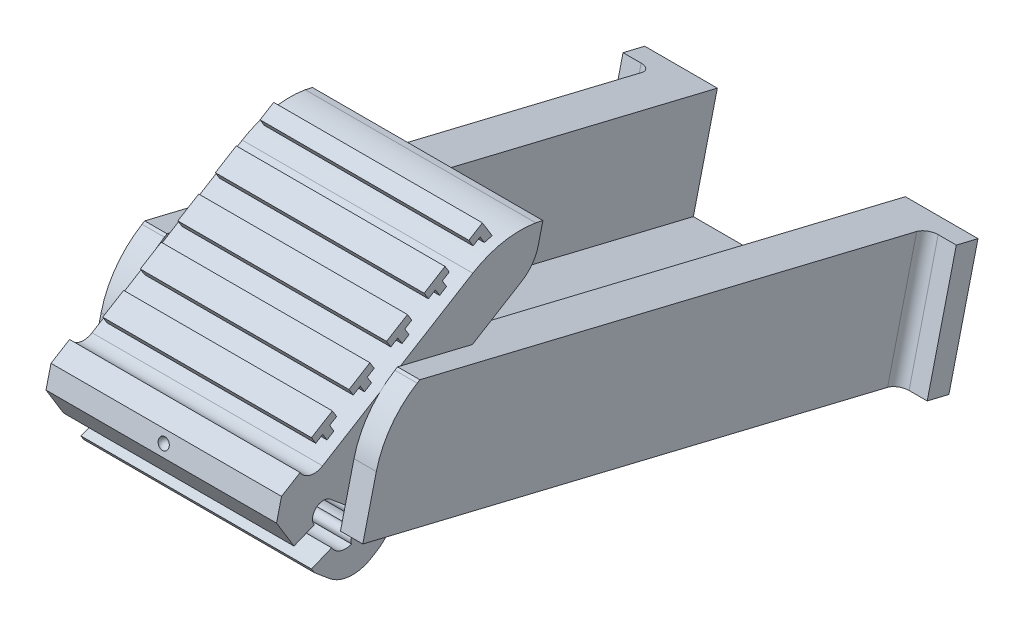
ISO-10303-21;
HEADER;
FILE_DESCRIPTION(('STEP AP214'),'2;1');
FILE_NAME('part.step','',(''),(''),'','','');
FILE_SCHEMA(('AUTOMOTIVE_DESIGN { 1 0 10303 214 1 1 1 1 }'));
ENDSEC;
DATA;
#1=APPLICATION_CONTEXT('core data for automotive mechanical design processes');
#2=APPLICATION_PROTOCOL_DEFINITION('international standard','automotive_design',2000,#1);
#3=PRODUCT_CONTEXT('',#1,'mechanical');
#4=PRODUCT('Part','Part','',(#3));
#5=PRODUCT_RELATED_PRODUCT_CATEGORY('part','',(#4));
#6=PRODUCT_DEFINITION_FORMATION('','',#4);
#7=PRODUCT_DEFINITION_CONTEXT('part definition',#1,'design');
#8=PRODUCT_DEFINITION('design','',#6,#7);
#9=PRODUCT_DEFINITION_SHAPE('','',#8);
#10=(LENGTH_UNIT() NAMED_UNIT(*) SI_UNIT(.MILLI.,.METRE.));
#11=(NAMED_UNIT(*) PLANE_ANGLE_UNIT() SI_UNIT($,.RADIAN.));
#12=(NAMED_UNIT(*) SI_UNIT($,.STERADIAN.) SOLID_ANGLE_UNIT());
#13=UNCERTAINTY_MEASURE_WITH_UNIT(LENGTH_MEASURE(1.E-05),#10,'distance_accuracy_value','');
#14=(GEOMETRIC_REPRESENTATION_CONTEXT(3) GLOBAL_UNCERTAINTY_ASSIGNED_CONTEXT((#13)) GLOBAL_UNIT_ASSIGNED_CONTEXT((#10,
#11,#12)) REPRESENTATION_CONTEXT('',''));
#15=CARTESIAN_POINT('',(0.,0.,0.));
#16=DIRECTION('',(0.,0.,1.));
#17=DIRECTION('',(1.,0.,0.));
#18=AXIS2_PLACEMENT_3D('',#15,#16,#17);
#19=CARTESIAN_POINT('',(18.95,24.5850642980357,-102.444323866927));
#20=DIRECTION('',(1.,0.,0.));
#21=DIRECTION('',(0.,1.,0.));
#22=AXIS2_PLACEMENT_3D('',#19,#20,#21);
#23=PLANE('',#22);
#24=DIRECTION('',(0.,-0.234770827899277,-0.972050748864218));
#25=VECTOR('',#24,1.);
#26=CARTESIAN_POINT('',(18.95,18.0526898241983,-95.7228528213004));
#27=LINE('',#26,#25);
#28=CARTESIAN_POINT('',(18.95,19.8134710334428,-88.4324722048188));
#29=VERTEX_POINT('',#28);
#30=CARTESIAN_POINT('',(18.95,2.35742151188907,-160.707916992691));
#31=VERTEX_POINT('',#30);
#32=EDGE_CURVE('E355',#29,#31,#27,.T.);
#33=ORIENTED_EDGE('',*,*,#32,.T.);
#34=DIRECTION('',(0.,0.972050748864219,-0.234770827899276));
#35=VECTOR('',#34,1.);
#36=CARTESIAN_POINT('',(18.95,10.063650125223,-162.569134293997));
#37=LINE('',#36,#35);
#38=CARTESIAN_POINT('',(18.95,18.9494950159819,-164.715253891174));
#39=VERTEX_POINT('',#38);
#40=EDGE_CURVE('E376',#31,#39,#37,.T.);
#41=ORIENTED_EDGE('',*,*,#40,.T.);
#42=DIRECTION('',(0.,0.234770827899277,0.972050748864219));
#43=VECTOR('',#42,1.);
#44=CARTESIAN_POINT('',(18.95,32.9848700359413,-106.60285159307));
#45=LINE('',#44,#43);
#46=CARTESIAN_POINT('',(18.95,35.4749907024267,-96.2926964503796));
#47=VERTEX_POINT('',#46);
#48=EDGE_CURVE('E377',#39,#47,#45,.T.);
#49=ORIENTED_EDGE('',*,*,#48,.T.);
#50=DIRECTION('',(0.,-0.521335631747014,0.853351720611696));
#51=VECTOR('',#50,1.);
#52=CARTESIAN_POINT('',(18.95,35.4749907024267,-96.2926964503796));
#53=LINE('',#52,#51);
#54=CARTESIAN_POINT('',(18.95,35.2519608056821,-95.9276284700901));
#55=VERTEX_POINT('',#54);
#56=EDGE_CURVE('E380',#47,#55,#53,.T.);
#57=ORIENTED_EDGE('',*,*,#56,.T.);
#58=CARTESIAN_POINT('',(18.95,24.5850642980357,-102.444323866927));
#59=DIRECTION('',(1.,0.,0.));
#60=DIRECTION('',(0.,1.,0.));
#61=AXIS2_PLACEMENT_3D('',#58,#59,#60);
#62=CIRCLE('',#61,12.5);
#63=CARTESIAN_POINT('',(18.95,27.5196996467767,-90.2936895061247));
#64=VERTEX_POINT('',#63);
#65=EDGE_CURVE('E389',#55,#64,#62,.T.);
#66=ORIENTED_EDGE('',*,*,#65,.T.);
#67=DIRECTION('',(0.,-0.972050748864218,0.234770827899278));
#68=VECTOR('',#67,1.);
#69=CARTESIAN_POINT('',(18.95,27.5196996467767,-90.2936895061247));
#70=LINE('',#69,#68);
#71=EDGE_CURVE('E392',#64,#29,#70,.T.);
#72=ORIENTED_EDGE('',*,*,#71,.T.);
#73=EDGE_LOOP('',(#33,#41,#49,#57,#66,#72));
#74=FACE_BOUND('',#73,.T.);
#75=ADVANCED_FACE('F48',(#74),#23,.T.);
#76=CARTESIAN_POINT('',(-109.697045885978,32.9848700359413,-106.60285159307));
#77=DIRECTION('',(0.,0.972050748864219,-0.234770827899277));
#78=DIRECTION('',(0.,0.234770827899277,0.972050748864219));
#79=AXIS2_PLACEMENT_3D('',#76,#77,#78);
#80=PLANE('',#79);
#81=DIRECTION('',(0.,-0.234770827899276,-0.972050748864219));
#82=VECTOR('',#81,1.);
#83=CARTESIAN_POINT('',(12.95,41.5645345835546,-71.0794033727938));
#84=LINE('',#83,#82);
#85=CARTESIAN_POINT('',(12.95,32.9848700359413,-106.60285159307));
#86=VERTEX_POINT('',#85);
#87=CARTESIAN_POINT('',(12.95,17.8754184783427,-169.162386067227));
#88=VERTEX_POINT('',#87);
#89=EDGE_CURVE('E268',#86,#88,#84,.T.);
#90=ORIENTED_EDGE('',*,*,#89,.F.);
#91=DIRECTION('',(1.,0.,0.));
#92=VECTOR('',#91,1.);
#93=CARTESIAN_POINT('',(-44.123383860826,32.9848700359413,-106.60285159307));
#94=LINE('',#93,#92);
#95=CARTESIAN_POINT('',(15.875,32.9848700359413,-106.60285159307));
#96=VERTEX_POINT('',#95);
#97=EDGE_CURVE('E343',#86,#96,#94,.T.);
#98=ORIENTED_EDGE('',*,*,#97,.T.);
#99=DIRECTION('',(0.,0.234770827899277,0.972050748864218));
#100=VECTOR('',#99,1.);
#101=CARTESIAN_POINT('',(15.875,32.9848700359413,-106.60285159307));
#102=LINE('',#101,#100);
#103=CARTESIAN_POINT('',(15.875,35.4749907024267,-96.2926964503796));
#104=VERTEX_POINT('',#103);
#105=EDGE_CURVE('E334',#96,#104,#102,.T.);
#106=ORIENTED_EDGE('',*,*,#105,.T.);
#107=DIRECTION('',(1.,0.,0.));
#108=VECTOR('',#107,1.);
#109=CARTESIAN_POINT('',(-109.697045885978,35.4749907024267,-96.2926964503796));
#110=LINE('',#109,#108);
#111=EDGE_CURVE('E410',#104,#47,#110,.T.);
#112=ORIENTED_EDGE('',*,*,#111,.T.);
#113=ORIENTED_EDGE('',*,*,#48,.F.);
#114=CARTESIAN_POINT('',(20.45,18.9494950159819,-164.715253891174));
#115=DIRECTION('',(0.,0.972050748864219,-0.234770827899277));
#116=DIRECTION('',(0.,0.234770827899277,0.972050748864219));
#117=AXIS2_PLACEMENT_3D('',#114,#115,#116);
#118=CIRCLE('',#117,1.5);
#119=CARTESIAN_POINT('',(20.45,18.597338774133,-166.17333001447));
#120=VERTEX_POINT('',#119);
#121=EDGE_CURVE('E56',#39,#120,#118,.F.);
#122=ORIENTED_EDGE('',*,*,#121,.T.);
#123=DIRECTION('',(1.,0.,0.));
#124=VECTOR('',#123,1.);
#125=CARTESIAN_POINT('',(22.95,18.597338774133,-166.17333001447));
#126=LINE('',#125,#124);
#127=CARTESIAN_POINT('',(22.95,18.597338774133,-166.17333001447));
#128=VERTEX_POINT('',#127);
#129=EDGE_CURVE('E255',#120,#128,#126,.T.);
#130=ORIENTED_EDGE('',*,*,#129,.T.);
#131=DIRECTION('',(0.,-0.234770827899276,-0.972050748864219));
#132=VECTOR('',#131,1.);
#133=CARTESIAN_POINT('',(22.95,18.597338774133,-166.17333001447));
#134=LINE('',#133,#132);
#135=CARTESIAN_POINT('',(22.95,17.8754184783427,-169.162386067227));
#136=VERTEX_POINT('',#135);
#137=EDGE_CURVE('E254',#128,#136,#134,.T.);
#138=ORIENTED_EDGE('',*,*,#137,.T.);
#139=DIRECTION('',(1.,0.,0.));
#140=VECTOR('',#139,1.);
#141=CARTESIAN_POINT('',(-109.697045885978,17.8754184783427,-169.162386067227));
#142=LINE('',#141,#140);
#143=EDGE_CURVE('E414',#88,#136,#142,.T.);
#144=ORIENTED_EDGE('',*,*,#143,.F.);
#145=EDGE_LOOP('',(#90,#98,#106,#112,#113,#122,#130,#138,#144));
#146=FACE_BOUND('',#145,.T.);
#147=ADVANCED_FACE('F508',(#146),#80,.T.);
#148=CARTESIAN_POINT('',(-44.123383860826,32.9848700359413,-106.60285159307));
#149=DIRECTION('',(0.,-0.853351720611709,-0.521335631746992));
#150=DIRECTION('',(0.,0.521335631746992,-0.853351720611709));
#151=AXIS2_PLACEMENT_3D('',#148,#149,#150);
#152=PLANE('',#151);
#153=ORIENTED_EDGE('',*,*,#97,.F.);
#154=DIRECTION('',(0.,-0.521335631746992,0.853351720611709));
#155=VECTOR('',#154,1.);
#156=CARTESIAN_POINT('',(12.95,32.9848700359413,-106.60285159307));
#157=LINE('',#156,#155);
#158=CARTESIAN_POINT('',(12.95,28.8518229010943,-99.8376457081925));
#159=VERTEX_POINT('',#158);
#160=EDGE_CURVE('E294',#86,#159,#157,.T.);
#161=ORIENTED_EDGE('',*,*,#160,.T.);
#162=DIRECTION('',(1.,0.,0.));
#163=VECTOR('',#162,1.);
#164=CARTESIAN_POINT('',(-44.1233838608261,28.8518229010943,-99.8376457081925));
#165=LINE('',#164,#163);
#166=CARTESIAN_POINT('',(15.875,28.8518229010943,-99.8376457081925));
#167=VERTEX_POINT('',#166);
#168=EDGE_CURVE('E347',#159,#167,#165,.T.);
#169=ORIENTED_EDGE('',*,*,#168,.T.);
#170=DIRECTION('',(0.,0.521335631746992,-0.853351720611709));
#171=VECTOR('',#170,1.);
#172=CARTESIAN_POINT('',(15.875,32.9848700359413,-106.60285159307));
#173=LINE('',#172,#171);
#174=EDGE_CURVE('E331',#167,#96,#173,.T.);
#175=ORIENTED_EDGE('',*,*,#174,.T.);
#176=EDGE_LOOP('',(#153,#161,#169,#175));
#177=FACE_BOUND('',#176,.T.);
#178=ADVANCED_FACE('F531',(#177),#152,.F.);
#179=CARTESIAN_POINT('',(-44.1233838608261,24.5850642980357,-102.444323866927));
#180=DIRECTION('',(1.,0.,0.));
#181=DIRECTION('',(0.,1.,0.));
#182=AXIS2_PLACEMENT_3D('',#179,#180,#181);
#183=CYLINDRICAL_SURFACE('',#182,5.);
#184=ORIENTED_EDGE('',*,*,#168,.F.);
#185=CARTESIAN_POINT('',(12.95,24.5850642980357,-102.444323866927));
#186=DIRECTION('',(1.,0.,0.));
#187=DIRECTION('',(0.,1.,0.));
#188=AXIS2_PLACEMENT_3D('',#185,#186,#187);
#189=CIRCLE('',#188,5.);
#190=CARTESIAN_POINT('',(12.95,25.7589184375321,-97.5840701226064));
#191=VERTEX_POINT('',#190);
#192=EDGE_CURVE('E291',#159,#191,#189,.T.);
#193=ORIENTED_EDGE('',*,*,#192,.T.);
#194=DIRECTION('',(1.,0.,0.));
#195=VECTOR('',#194,1.);
#196=CARTESIAN_POINT('',(-44.1233838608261,25.7589184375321,-97.5840701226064));
#197=LINE('',#196,#195);
#198=CARTESIAN_POINT('',(15.875,25.7589184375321,-97.5840701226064));
#199=VERTEX_POINT('',#198);
#200=EDGE_CURVE('E351',#191,#199,#197,.T.);
#201=ORIENTED_EDGE('',*,*,#200,.T.);
#202=CARTESIAN_POINT('',(15.875,24.5850642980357,-102.444323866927));
#203=DIRECTION('',(-1.,0.,0.));
#204=DIRECTION('',(0.,1.,0.));
#205=AXIS2_PLACEMENT_3D('',#202,#203,#204);
#206=CIRCLE('',#205,5.);
#207=EDGE_CURVE('E328',#199,#167,#206,.T.);
#208=ORIENTED_EDGE('',*,*,#207,.T.);
#209=EDGE_LOOP('',(#184,#193,#201,#208));
#210=FACE_BOUND('',#209,.T.);
#211=ADVANCED_FACE('F465',(#210),#183,.T.);
#212=CARTESIAN_POINT('',(-109.697045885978,27.5196996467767,-90.2936895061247));
#213=DIRECTION('',(0.,0.234770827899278,0.972050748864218));
#214=DIRECTION('',(0.,-0.972050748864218,0.234770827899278));
#215=AXIS2_PLACEMENT_3D('',#212,#213,#214);
#216=PLANE('',#215);
#217=DIRECTION('',(1.,0.,0.));
#218=VECTOR('',#217,1.);
#219=CARTESIAN_POINT('',(-109.697045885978,19.8134710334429,-88.4324722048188));
#220=LINE('',#219,#218);
#221=CARTESIAN_POINT('',(-18.95,19.8134710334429,-88.4324722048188));
#222=VERTEX_POINT('',#221);
#223=CARTESIAN_POINT('',(-15.875,19.8134710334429,-88.4324722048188));
#224=VERTEX_POINT('',#223);
#225=EDGE_CURVE('E365',#222,#224,#220,.T.);
#226=ORIENTED_EDGE('',*,*,#225,.T.);
#227=DIRECTION('',(0.,0.972050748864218,-0.234770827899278));
#228=VECTOR('',#227,1.);
#229=CARTESIAN_POINT('',(-15.875,27.5196996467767,-90.2936895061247));
#230=LINE('',#229,#228);
#231=CARTESIAN_POINT('',(-15.875,27.5196996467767,-90.2936895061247));
#232=VERTEX_POINT('',#231);
#233=EDGE_CURVE('E317',#224,#232,#230,.T.);
#234=ORIENTED_EDGE('',*,*,#233,.T.);
#235=DIRECTION('',(1.,0.,0.));
#236=VECTOR('',#235,1.);
#237=CARTESIAN_POINT('',(-109.697045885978,27.5196996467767,-90.2936895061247));
#238=LINE('',#237,#236);
#239=CARTESIAN_POINT('',(-18.95,27.5196996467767,-90.2936895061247));
#240=VERTEX_POINT('',#239);
#241=EDGE_CURVE('E399',#240,#232,#238,.T.);
#242=ORIENTED_EDGE('',*,*,#241,.F.);
#243=DIRECTION('',(0.,0.972050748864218,-0.234770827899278));
#244=VECTOR('',#243,1.);
#245=CARTESIAN_POINT('',(-18.95,27.5196996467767,-90.2936895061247));
#246=LINE('',#245,#244);
#247=EDGE_CURVE('E421',#222,#240,#246,.T.);
#248=ORIENTED_EDGE('',*,*,#247,.F.);
#249=EDGE_LOOP('',(#226,#234,#242,#248));
#250=FACE_BOUND('',#249,.T.);
#251=ADVANCED_FACE('F447',(#250),#216,.T.);
#252=CARTESIAN_POINT('',(-109.697045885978,24.5850642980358,-102.444323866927));
#253=DIRECTION('',(1.,0.,0.));
#254=DIRECTION('',(0.,1.,0.));
#255=AXIS2_PLACEMENT_3D('',#252,#253,#254);
#256=CYLINDRICAL_SURFACE('',#255,12.5);
#257=ORIENTED_EDGE('',*,*,#241,.T.);
#258=CARTESIAN_POINT('',(-15.875,24.5850642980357,-102.444323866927));
#259=DIRECTION('',(1.,0.,0.));
#260=DIRECTION('',(0.,1.,0.));
#261=AXIS2_PLACEMENT_3D('',#258,#259,#260);
#262=CIRCLE('',#261,12.5);
#263=CARTESIAN_POINT('',(-15.875,35.2519608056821,-95.9276284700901));
#264=VERTEX_POINT('',#263);
#265=EDGE_CURVE('E314',#232,#264,#262,.F.);
#266=ORIENTED_EDGE('',*,*,#265,.T.);
#267=DIRECTION('',(1.,0.,0.));
#268=VECTOR('',#267,1.);
#269=CARTESIAN_POINT('',(-109.697045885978,35.2519608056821,-95.9276284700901));
#270=LINE('',#269,#268);
#271=CARTESIAN_POINT('',(-18.95,35.2519608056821,-95.9276284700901));
#272=VERTEX_POINT('',#271);
#273=EDGE_CURVE('E403',#272,#264,#270,.T.);
#274=ORIENTED_EDGE('',*,*,#273,.F.);
#275=CARTESIAN_POINT('',(-18.95,24.5850642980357,-102.444323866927));
#276=DIRECTION('',(1.,0.,0.));
#277=DIRECTION('',(0.,1.,0.));
#278=AXIS2_PLACEMENT_3D('',#275,#276,#277);
#279=CIRCLE('',#278,12.5);
#280=EDGE_CURVE('E427',#240,#272,#279,.F.);
#281=ORIENTED_EDGE('',*,*,#280,.F.);
#282=EDGE_LOOP('',(#257,#266,#274,#281));
#283=FACE_BOUND('',#282,.T.);
#284=ADVANCED_FACE('F444',(#283),#256,.T.);
#285=CARTESIAN_POINT('',(-109.697045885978,35.4749907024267,-96.2926964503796));
#286=DIRECTION('',(0.,0.853351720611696,0.521335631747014));
#287=DIRECTION('',(0.,-0.521335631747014,0.853351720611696));
#288=AXIS2_PLACEMENT_3D('',#285,#286,#287);
#289=PLANE('',#288);
#290=ORIENTED_EDGE('',*,*,#273,.T.);
#291=DIRECTION('',(0.,0.521335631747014,-0.853351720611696));
#292=VECTOR('',#291,1.);
#293=CARTESIAN_POINT('',(-15.875,35.4749907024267,-96.2926964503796));
#294=LINE('',#293,#292);
#295=CARTESIAN_POINT('',(-15.875,35.4749907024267,-96.2926964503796));
#296=VERTEX_POINT('',#295);
#297=EDGE_CURVE('E311',#264,#296,#294,.T.);
#298=ORIENTED_EDGE('',*,*,#297,.T.);
#299=CARTESIAN_POINT('',(-18.95,35.4749907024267,-96.2926964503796));
#300=VERTEX_POINT('',#299);
#301=EDGE_CURVE('E407',#300,#296,#110,.T.);
#302=ORIENTED_EDGE('',*,*,#301,.F.);
#303=DIRECTION('',(0.,0.521335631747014,-0.853351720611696));
#304=VECTOR('',#303,1.);
#305=CARTESIAN_POINT('',(-18.95,35.4749907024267,-96.2926964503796));
#306=LINE('',#305,#304);
#307=EDGE_CURVE('E358',#272,#300,#306,.T.);
#308=ORIENTED_EDGE('',*,*,#307,.F.);
#309=EDGE_LOOP('',(#290,#298,#302,#308));
#310=FACE_BOUND('',#309,.T.);
#311=ADVANCED_FACE('F440',(#310),#289,.T.);
#312=DIRECTION('',(0.,-0.972050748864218,0.234770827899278));
#313=VECTOR('',#312,1.);
#314=CARTESIAN_POINT('',(15.875,27.5196996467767,-90.2936895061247));
#315=LINE('',#314,#313);
#316=CARTESIAN_POINT('',(15.875,27.5196996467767,-90.2936895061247));
#317=VERTEX_POINT('',#316);
#318=CARTESIAN_POINT('',(15.875,19.8134710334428,-88.4324722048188));
#319=VERTEX_POINT('',#318);
#320=EDGE_CURVE('E320',#317,#319,#315,.T.);
#321=ORIENTED_EDGE('',*,*,#320,.T.);
#322=EDGE_CURVE('E398',#319,#29,#220,.T.);
#323=ORIENTED_EDGE('',*,*,#322,.T.);
#324=ORIENTED_EDGE('',*,*,#71,.F.);
#325=EDGE_CURVE('E402',#317,#64,#238,.T.);
#326=ORIENTED_EDGE('',*,*,#325,.F.);
#327=EDGE_LOOP('',(#321,#323,#324,#326));
#328=FACE_BOUND('',#327,.T.);
#329=ADVANCED_FACE('F519',(#328),#216,.T.);
#330=CARTESIAN_POINT('',(15.875,24.5850642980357,-102.444323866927));
#331=DIRECTION('',(1.,0.,0.));
#332=DIRECTION('',(0.,1.,0.));
#333=AXIS2_PLACEMENT_3D('',#330,#331,#332);
#334=CIRCLE('',#333,12.5);
#335=CARTESIAN_POINT('',(15.875,35.2519608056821,-95.9276284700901));
#336=VERTEX_POINT('',#335);
#337=EDGE_CURVE('E297',#336,#317,#334,.T.);
#338=ORIENTED_EDGE('',*,*,#337,.T.);
#339=ORIENTED_EDGE('',*,*,#325,.T.);
#340=ORIENTED_EDGE('',*,*,#65,.F.);
#341=EDGE_CURVE('E406',#336,#55,#270,.T.);
#342=ORIENTED_EDGE('',*,*,#341,.F.);
#343=EDGE_LOOP('',(#338,#339,#340,#342));
#344=FACE_BOUND('',#343,.T.);
#345=ADVANCED_FACE('F538',(#344),#256,.T.);
#346=DIRECTION('',(0.,-0.521335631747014,0.853351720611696));
#347=VECTOR('',#346,1.);
#348=CARTESIAN_POINT('',(15.875,35.4749907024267,-96.2926964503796));
#349=LINE('',#348,#347);
#350=EDGE_CURVE('E337',#104,#336,#349,.T.);
#351=ORIENTED_EDGE('',*,*,#350,.T.);
#352=ORIENTED_EDGE('',*,*,#341,.T.);
#353=ORIENTED_EDGE('',*,*,#56,.F.);
#354=ORIENTED_EDGE('',*,*,#111,.F.);
#355=EDGE_LOOP('',(#351,#352,#353,#354));
#356=FACE_BOUND('',#355,.T.);
#357=ADVANCED_FACE('F512',(#356),#289,.T.);
#358=DIRECTION('',(0.,-0.234770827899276,-0.972050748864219));
#359=VECTOR('',#358,1.);
#360=CARTESIAN_POINT('',(-12.95,41.5645345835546,-71.0794033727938));
#361=LINE('',#360,#359);
#362=CARTESIAN_POINT('',(-12.95,32.9848700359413,-106.60285159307));
#363=VERTEX_POINT('',#362);
#364=CARTESIAN_POINT('',(-12.95,17.8754184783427,-169.162386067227));
#365=VERTEX_POINT('',#364);
#366=EDGE_CURVE('E278',#363,#365,#361,.T.);
#367=ORIENTED_EDGE('',*,*,#366,.T.);
#368=CARTESIAN_POINT('',(-22.95,17.8754184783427,-169.162386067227));
#369=VERTEX_POINT('',#368);
#370=EDGE_CURVE('E411',#369,#365,#142,.T.);
#371=ORIENTED_EDGE('',*,*,#370,.F.);
#372=DIRECTION('',(0.,-0.234770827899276,-0.972050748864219));
#373=VECTOR('',#372,1.);
#374=CARTESIAN_POINT('',(-22.95,18.597338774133,-166.17333001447));
#375=LINE('',#374,#373);
#376=CARTESIAN_POINT('',(-22.95,18.597338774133,-166.17333001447));
#377=VERTEX_POINT('',#376);
#378=EDGE_CURVE('E239',#377,#369,#375,.T.);
#379=ORIENTED_EDGE('',*,*,#378,.F.);
#380=DIRECTION('',(1.,0.,0.));
#381=VECTOR('',#380,1.);
#382=CARTESIAN_POINT('',(-18.95,18.597338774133,-166.17333001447));
#383=LINE('',#382,#381);
#384=CARTESIAN_POINT('',(-20.45,18.597338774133,-166.17333001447));
#385=VERTEX_POINT('',#384);
#386=EDGE_CURVE('E240',#377,#385,#383,.T.);
#387=ORIENTED_EDGE('',*,*,#386,.T.);
#388=CARTESIAN_POINT('',(-20.45,18.9494950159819,-164.715253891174));
#389=DIRECTION('',(0.,0.972050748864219,-0.234770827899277));
#390=DIRECTION('',(0.,0.234770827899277,0.972050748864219));
#391=AXIS2_PLACEMENT_3D('',#388,#389,#390);
#392=CIRCLE('',#391,1.5);
#393=CARTESIAN_POINT('',(-18.95,18.9494950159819,-164.715253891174));
#394=VERTEX_POINT('',#393);
#395=EDGE_CURVE('E439',#385,#394,#392,.F.);
#396=ORIENTED_EDGE('',*,*,#395,.T.);
#397=DIRECTION('',(0.,-0.234770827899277,-0.972050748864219));
#398=VECTOR('',#397,1.);
#399=CARTESIAN_POINT('',(-18.95,32.9848700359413,-106.60285159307));
#400=LINE('',#399,#398);
#401=EDGE_CURVE('E361',#300,#394,#400,.T.);
#402=ORIENTED_EDGE('',*,*,#401,.F.);
#403=ORIENTED_EDGE('',*,*,#301,.T.);
#404=DIRECTION('',(0.,-0.234770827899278,-0.972050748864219));
#405=VECTOR('',#404,1.);
#406=CARTESIAN_POINT('',(-15.875,32.9848700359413,-106.60285159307));
#407=LINE('',#406,#405);
#408=CARTESIAN_POINT('',(-15.875,32.9848700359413,-106.60285159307));
#409=VERTEX_POINT('',#408);
#410=EDGE_CURVE('E308',#296,#409,#407,.T.);
#411=ORIENTED_EDGE('',*,*,#410,.T.);
#412=EDGE_CURVE('E302',#409,#363,#94,.T.);
#413=ORIENTED_EDGE('',*,*,#412,.T.);
#414=EDGE_LOOP('',(#367,#371,#379,#387,#396,#402,#403,#411,#413));
#415=FACE_BOUND('',#414,.T.);
#416=ADVANCED_FACE('F437',(#415),#80,.T.);
#417=CARTESIAN_POINT('',(-109.697045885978,1.28334497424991,-165.155049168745));
#418=DIRECTION('',(0.,-0.234770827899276,-0.972050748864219));
#419=DIRECTION('',(0.,0.972050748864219,-0.234770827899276));
#420=AXIS2_PLACEMENT_3D('',#417,#418,#419);
#421=PLANE('',#420);
#422=DIRECTION('',(0.,-0.972050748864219,0.234770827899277));
#423=VECTOR('',#422,1.);
#424=CARTESIAN_POINT('',(12.95,17.8754184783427,-169.162386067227));
#425=LINE('',#424,#423);
#426=CARTESIAN_POINT('',(12.95,4.19949722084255,-165.859361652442));
#427=VERTEX_POINT('',#426);
#428=EDGE_CURVE('E262',#88,#427,#425,.T.);
#429=ORIENTED_EDGE('',*,*,#428,.F.);
#430=ORIENTED_EDGE('',*,*,#143,.T.);
#431=DIRECTION('',(0.,-0.972050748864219,0.234770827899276));
#432=VECTOR('',#431,1.);
#433=CARTESIAN_POINT('',(22.95,1.28334497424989,-165.155049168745));
#434=LINE('',#433,#432);
#435=CARTESIAN_POINT('',(22.95,1.28334497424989,-165.155049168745));
#436=VERTEX_POINT('',#435);
#437=EDGE_CURVE('E249',#136,#436,#434,.T.);
#438=ORIENTED_EDGE('',*,*,#437,.T.);
#439=DIRECTION('',(1.,0.,0.));
#440=VECTOR('',#439,1.);
#441=CARTESIAN_POINT('',(-109.697045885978,1.28334497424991,-165.155049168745));
#442=LINE('',#441,#440);
#443=CARTESIAN_POINT('',(-22.95,1.28334497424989,-165.155049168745));
#444=VERTEX_POINT('',#443);
#445=EDGE_CURVE('E395',#444,#436,#442,.T.);
#446=ORIENTED_EDGE('',*,*,#445,.F.);
#447=DIRECTION('',(0.,0.972050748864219,-0.234770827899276));
#448=VECTOR('',#447,1.);
#449=CARTESIAN_POINT('',(-22.95,17.8754184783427,-169.162386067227));
#450=LINE('',#449,#448);
#451=EDGE_CURVE('E232',#444,#369,#450,.T.);
#452=ORIENTED_EDGE('',*,*,#451,.T.);
#453=ORIENTED_EDGE('',*,*,#370,.T.);
#454=DIRECTION('',(0.,0.972050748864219,-0.234770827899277));
#455=VECTOR('',#454,1.);
#456=CARTESIAN_POINT('',(-12.95,17.8754184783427,-169.162386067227));
#457=LINE('',#456,#455);
#458=CARTESIAN_POINT('',(-12.95,4.19949722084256,-165.859361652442));
#459=VERTEX_POINT('',#458);
#460=EDGE_CURVE('E274',#459,#365,#457,.T.);
#461=ORIENTED_EDGE('',*,*,#460,.F.);
#462=DIRECTION('',(-1.,0.,0.));
#463=VECTOR('',#462,1.);
#464=CARTESIAN_POINT('',(12.95,4.19949722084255,-165.859361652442));
#465=LINE('',#464,#463);
#466=EDGE_CURVE('E271',#427,#459,#465,.T.);
#467=ORIENTED_EDGE('',*,*,#466,.F.);
#468=EDGE_LOOP('',(#429,#430,#438,#446,#452,#453,#461,#467));
#469=FACE_BOUND('',#468,.T.);
#470=ADVANCED_FACE('F487',(#469),#421,.T.);
#471=CARTESIAN_POINT('',(-109.697045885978,18.0526898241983,-95.7228528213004));
#472=DIRECTION('',(0.,-0.972050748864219,0.234770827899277));
#473=DIRECTION('',(0.,-0.234770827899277,-0.972050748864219));
#474=AXIS2_PLACEMENT_3D('',#471,#472,#473);
#475=PLANE('',#474);
#476=DIRECTION('',(0.,-0.234770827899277,-0.972050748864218));
#477=VECTOR('',#476,1.);
#478=CARTESIAN_POINT('',(15.875,19.8134710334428,-88.4324722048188));
#479=LINE('',#478,#477);
#480=CARTESIAN_POINT('',(15.875,18.0526898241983,-95.7228528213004));
#481=VERTEX_POINT('',#480);
#482=EDGE_CURVE('E323',#319,#481,#479,.T.);
#483=ORIENTED_EDGE('',*,*,#482,.T.);
#484=DIRECTION('',(1.,0.,0.));
#485=VECTOR('',#484,1.);
#486=CARTESIAN_POINT('',(-44.1233838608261,18.0526898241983,-95.7228528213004));
#487=LINE('',#486,#485);
#488=CARTESIAN_POINT('',(-15.875,18.0526898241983,-95.7228528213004));
#489=VERTEX_POINT('',#488);
#490=EDGE_CURVE('E340',#489,#481,#487,.T.);
#491=ORIENTED_EDGE('',*,*,#490,.F.);
#492=DIRECTION('',(0.,0.234770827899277,0.972050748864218));
#493=VECTOR('',#492,1.);
#494=CARTESIAN_POINT('',(-15.875,19.8134710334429,-88.4324722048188));
#495=LINE('',#494,#493);
#496=EDGE_CURVE('E298',#489,#224,#495,.T.);
#497=ORIENTED_EDGE('',*,*,#496,.T.);
#498=ORIENTED_EDGE('',*,*,#225,.F.);
#499=DIRECTION('',(0.,0.234770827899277,0.972050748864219));
#500=VECTOR('',#499,1.);
#501=CARTESIAN_POINT('',(-18.95,18.0526898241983,-95.7228528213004));
#502=LINE('',#501,#500);
#503=CARTESIAN_POINT('',(-18.95,2.3574215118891,-160.707916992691));
#504=VERTEX_POINT('',#503);
#505=EDGE_CURVE('E420',#504,#222,#502,.T.);
#506=ORIENTED_EDGE('',*,*,#505,.F.);
#507=CARTESIAN_POINT('',(-20.45,2.3574215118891,-160.707916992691));
#508=DIRECTION('',(0.,-0.972050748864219,0.234770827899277));
#509=DIRECTION('',(0.,-0.234770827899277,-0.972050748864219));
#510=AXIS2_PLACEMENT_3D('',#507,#508,#509);
#511=CIRCLE('',#510,1.5);
#512=CARTESIAN_POINT('',(-20.45,2.00526527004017,-162.165993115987));
#513=VERTEX_POINT('',#512);
#514=EDGE_CURVE('E227',#504,#513,#511,.F.);
#515=ORIENTED_EDGE('',*,*,#514,.T.);
#516=DIRECTION('',(-1.,0.,0.));
#517=VECTOR('',#516,1.);
#518=CARTESIAN_POINT('',(-18.95,2.00526527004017,-162.165993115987));
#519=LINE('',#518,#517);
#520=CARTESIAN_POINT('',(-22.95,2.00526527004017,-162.165993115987));
#521=VERTEX_POINT('',#520);
#522=EDGE_CURVE('E220',#513,#521,#519,.T.);
#523=ORIENTED_EDGE('',*,*,#522,.T.);
#524=DIRECTION('',(0.,-0.234770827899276,-0.972050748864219));
#525=VECTOR('',#524,1.);
#526=CARTESIAN_POINT('',(-22.95,2.00526527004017,-162.165993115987));
#527=LINE('',#526,#525);
#528=EDGE_CURVE('E224',#521,#444,#527,.T.);
#529=ORIENTED_EDGE('',*,*,#528,.T.);
#530=ORIENTED_EDGE('',*,*,#445,.T.);
#531=DIRECTION('',(0.,-0.234770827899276,-0.972050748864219));
#532=VECTOR('',#531,1.);
#533=CARTESIAN_POINT('',(22.95,2.00526527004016,-162.165993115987));
#534=LINE('',#533,#532);
#535=CARTESIAN_POINT('',(22.95,2.00526527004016,-162.165993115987));
#536=VERTEX_POINT('',#535);
#537=EDGE_CURVE('E259',#536,#436,#534,.T.);
#538=ORIENTED_EDGE('',*,*,#537,.F.);
#539=DIRECTION('',(-1.,0.,0.));
#540=VECTOR('',#539,1.);
#541=CARTESIAN_POINT('',(22.95,2.00526527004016,-162.165993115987));
#542=LINE('',#541,#540);
#543=CARTESIAN_POINT('',(20.45,2.00526527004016,-162.165993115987));
#544=VERTEX_POINT('',#543);
#545=EDGE_CURVE('E258',#536,#544,#542,.T.);
#546=ORIENTED_EDGE('',*,*,#545,.T.);
#547=CARTESIAN_POINT('',(20.45,2.35742151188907,-160.707916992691));
#548=DIRECTION('',(0.,-0.972050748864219,0.234770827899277));
#549=DIRECTION('',(0.,-0.234770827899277,-0.972050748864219));
#550=AXIS2_PLACEMENT_3D('',#547,#548,#549);
#551=CIRCLE('',#550,1.5);
#552=EDGE_CURVE('E13',#544,#31,#551,.F.);
#553=ORIENTED_EDGE('',*,*,#552,.T.);
#554=ORIENTED_EDGE('',*,*,#32,.F.);
#555=ORIENTED_EDGE('',*,*,#322,.F.);
#556=EDGE_LOOP('',(#483,#491,#497,#498,#506,#515,#523,#529,#530,#538,#546,#553,#554,#555));
#557=FACE_BOUND('',#556,.T.);
#558=ADVANCED_FACE('F223',(#557),#475,.T.);
#559=CARTESIAN_POINT('',(-18.95,9.,11.375));
#560=DIRECTION('',(1.,0.,0.));
#561=DIRECTION('',(0.,1.,0.));
#562=AXIS2_PLACEMENT_3D('',#559,#560,#561);
#563=PLANE('',#562);
#564=ORIENTED_EDGE('',*,*,#401,.T.);
#565=DIRECTION('',(0.,-0.972050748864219,0.234770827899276));
#566=VECTOR('',#565,1.);
#567=CARTESIAN_POINT('',(-18.95,-30.6370190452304,-152.73906131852));
#568=LINE('',#567,#566);
#569=EDGE_CURVE('E372',#394,#504,#568,.T.);
#570=ORIENTED_EDGE('',*,*,#569,.T.);
#571=ORIENTED_EDGE('',*,*,#505,.T.);
#572=ORIENTED_EDGE('',*,*,#247,.T.);
#573=ORIENTED_EDGE('',*,*,#280,.T.);
#574=ORIENTED_EDGE('',*,*,#307,.T.);
#575=EDGE_LOOP('',(#564,#570,#571,#572,#573,#574));
#576=FACE_BOUND('',#575,.T.);
#577=ADVANCED_FACE('F431',(#576),#563,.F.);
#578=CARTESIAN_POINT('',(-15.875,28.8518229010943,-99.8376457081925));
#579=VERTEX_POINT('',#578);
#580=CARTESIAN_POINT('',(-12.95,28.8518229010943,-99.8376457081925));
#581=VERTEX_POINT('',#580);
#582=EDGE_CURVE('E344',#579,#581,#165,.T.);
#583=ORIENTED_EDGE('',*,*,#582,.T.);
#584=DIRECTION('',(0.,0.521335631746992,-0.853351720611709));
#585=VECTOR('',#584,1.);
#586=CARTESIAN_POINT('',(-12.95,32.9848700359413,-106.60285159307));
#587=LINE('',#586,#585);
#588=EDGE_CURVE('E288',#581,#363,#587,.T.);
#589=ORIENTED_EDGE('',*,*,#588,.T.);
#590=ORIENTED_EDGE('',*,*,#412,.F.);
#591=DIRECTION('',(0.,-0.521335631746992,0.853351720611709));
#592=VECTOR('',#591,1.);
#593=CARTESIAN_POINT('',(-15.875,32.9848700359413,-106.60285159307));
#594=LINE('',#593,#592);
#595=EDGE_CURVE('E306',#409,#579,#594,.T.);
#596=ORIENTED_EDGE('',*,*,#595,.T.);
#597=EDGE_LOOP('',(#583,#589,#590,#596));
#598=FACE_BOUND('',#597,.T.);
#599=ADVANCED_FACE('F485',(#598),#152,.F.);
#600=CARTESIAN_POINT('',(-15.875,25.7589184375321,-97.5840701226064));
#601=VERTEX_POINT('',#600);
#602=CARTESIAN_POINT('',(-12.95,25.7589184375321,-97.5840701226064));
#603=VERTEX_POINT('',#602);
#604=EDGE_CURVE('E348',#601,#603,#197,.T.);
#605=ORIENTED_EDGE('',*,*,#604,.T.);
#606=CARTESIAN_POINT('',(-12.95,24.5850642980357,-102.444323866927));
#607=DIRECTION('',(-1.,0.,0.));
#608=DIRECTION('',(0.,-1.,0.));
#609=AXIS2_PLACEMENT_3D('',#606,#607,#608);
#610=CIRCLE('',#609,5.);
#611=EDGE_CURVE('E285',#603,#581,#610,.T.);
#612=ORIENTED_EDGE('',*,*,#611,.T.);
#613=ORIENTED_EDGE('',*,*,#582,.F.);
#614=CARTESIAN_POINT('',(-15.875,24.5850642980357,-102.444323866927));
#615=DIRECTION('',(1.,0.,0.));
#616=DIRECTION('',(0.,1.,0.));
#617=AXIS2_PLACEMENT_3D('',#614,#615,#616);
#618=CIRCLE('',#617,5.);
#619=EDGE_CURVE('E304',#579,#601,#618,.T.);
#620=ORIENTED_EDGE('',*,*,#619,.T.);
#621=EDGE_LOOP('',(#605,#612,#613,#620));
#622=FACE_BOUND('',#621,.T.);
#623=ADVANCED_FACE('F480',(#622),#183,.T.);
#624=CARTESIAN_POINT('',(-44.1233838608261,25.7589184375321,-97.5840701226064));
#625=DIRECTION('',(0.,-0.234770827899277,-0.972050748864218));
#626=DIRECTION('',(0.,0.972050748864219,-0.234770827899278));
#627=AXIS2_PLACEMENT_3D('',#624,#625,#626);
#628=PLANE('',#627);
#629=ORIENTED_EDGE('',*,*,#200,.F.);
#630=DIRECTION('',(0.,0.972050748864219,-0.234770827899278));
#631=VECTOR('',#630,1.);
#632=CARTESIAN_POINT('',(12.95,34.644763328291,-99.7301897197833));
#633=LINE('',#632,#631);
#634=CARTESIAN_POINT('',(12.95,20.9688420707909,-96.4271653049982));
#635=VERTEX_POINT('',#634);
#636=EDGE_CURVE('E265',#635,#191,#633,.T.);
#637=ORIENTED_EDGE('',*,*,#636,.F.);
#638=DIRECTION('',(1.,0.,0.));
#639=VECTOR('',#638,1.);
#640=CARTESIAN_POINT('',(12.95,20.9688420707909,-96.4271653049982));
#641=LINE('',#640,#639);
#642=CARTESIAN_POINT('',(-12.95,20.9688420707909,-96.4271653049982));
#643=VERTEX_POINT('',#642);
#644=EDGE_CURVE('E267',#643,#635,#641,.T.);
#645=ORIENTED_EDGE('',*,*,#644,.F.);
#646=DIRECTION('',(0.,0.972050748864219,-0.234770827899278));
#647=VECTOR('',#646,1.);
#648=CARTESIAN_POINT('',(-12.95,25.7589184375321,-97.5840701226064));
#649=LINE('',#648,#647);
#650=EDGE_CURVE('E418',#643,#603,#649,.T.);
#651=ORIENTED_EDGE('',*,*,#650,.T.);
#652=ORIENTED_EDGE('',*,*,#604,.F.);
#653=DIRECTION('',(0.,-0.972050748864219,0.234770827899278));
#654=VECTOR('',#653,1.);
#655=CARTESIAN_POINT('',(-15.875,25.7589184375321,-97.5840701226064));
#656=LINE('',#655,#654);
#657=EDGE_CURVE('E301',#601,#489,#656,.T.);
#658=ORIENTED_EDGE('',*,*,#657,.T.);
#659=ORIENTED_EDGE('',*,*,#490,.T.);
#660=DIRECTION('',(0.,0.972050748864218,-0.234770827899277));
#661=VECTOR('',#660,1.);
#662=CARTESIAN_POINT('',(15.875,25.7589184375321,-97.5840701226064));
#663=LINE('',#662,#661);
#664=EDGE_CURVE('E325',#481,#199,#663,.T.);
#665=ORIENTED_EDGE('',*,*,#664,.T.);
#666=EDGE_LOOP('',(#629,#637,#645,#651,#652,#658,#659,#665));
#667=FACE_BOUND('',#666,.T.);
#668=ADVANCED_FACE('F456',(#667),#628,.F.);
#669=CARTESIAN_POINT('',(15.875,24.5850642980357,-102.444323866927));
#670=DIRECTION('',(1.,0.,0.));
#671=DIRECTION('',(0.,1.,0.));
#672=AXIS2_PLACEMENT_3D('',#669,#670,#671);
#673=PLANE('',#672);
#674=ORIENTED_EDGE('',*,*,#337,.F.);
#675=ORIENTED_EDGE('',*,*,#350,.F.);
#676=ORIENTED_EDGE('',*,*,#105,.F.);
#677=ORIENTED_EDGE('',*,*,#174,.F.);
#678=ORIENTED_EDGE('',*,*,#207,.F.);
#679=ORIENTED_EDGE('',*,*,#664,.F.);
#680=ORIENTED_EDGE('',*,*,#482,.F.);
#681=ORIENTED_EDGE('',*,*,#320,.F.);
#682=EDGE_LOOP('',(#674,#675,#676,#677,#678,#679,#680,#681));
#683=FACE_BOUND('',#682,.T.);
#684=ADVANCED_FACE('F460',(#683),#673,.F.);
#685=CARTESIAN_POINT('',(-15.875,9.,11.375));
#686=DIRECTION('',(1.,0.,0.));
#687=DIRECTION('',(0.,1.,0.));
#688=AXIS2_PLACEMENT_3D('',#685,#686,#687);
#689=PLANE('',#688);
#690=ORIENTED_EDGE('',*,*,#265,.F.);
#691=ORIENTED_EDGE('',*,*,#233,.F.);
#692=ORIENTED_EDGE('',*,*,#496,.F.);
#693=ORIENTED_EDGE('',*,*,#657,.F.);
#694=ORIENTED_EDGE('',*,*,#619,.F.);
#695=ORIENTED_EDGE('',*,*,#595,.F.);
#696=ORIENTED_EDGE('',*,*,#410,.F.);
#697=ORIENTED_EDGE('',*,*,#297,.F.);
#698=EDGE_LOOP('',(#690,#691,#692,#693,#694,#695,#696,#697));
#699=FACE_BOUND('',#698,.T.);
#700=ADVANCED_FACE('F442',(#699),#689,.T.);
#701=CARTESIAN_POINT('',(12.95,41.5645345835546,-71.0794033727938));
#702=DIRECTION('',(1.,0.,0.));
#703=DIRECTION('',(0.,1.,0.));
#704=AXIS2_PLACEMENT_3D('',#701,#702,#703);
#705=PLANE('',#704);
#706=ORIENTED_EDGE('',*,*,#89,.T.);
#707=ORIENTED_EDGE('',*,*,#428,.T.);
#708=DIRECTION('',(0.,-0.234770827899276,-0.972050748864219));
#709=VECTOR('',#708,1.);
#710=CARTESIAN_POINT('',(12.95,27.8886133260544,-67.7763789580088));
#711=LINE('',#710,#709);
#712=EDGE_CURVE('E276',#635,#427,#711,.T.);
#713=ORIENTED_EDGE('',*,*,#712,.F.);
#714=ORIENTED_EDGE('',*,*,#636,.T.);
#715=ORIENTED_EDGE('',*,*,#192,.F.);
#716=ORIENTED_EDGE('',*,*,#160,.F.);
#717=EDGE_LOOP('',(#706,#707,#713,#714,#715,#716));
#718=FACE_BOUND('',#717,.T.);
#719=ADVANCED_FACE('F470',(#718),#705,.F.);
#720=CARTESIAN_POINT('',(-12.95,41.5645345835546,-71.0794033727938));
#721=DIRECTION('',(-1.,0.,0.));
#722=DIRECTION('',(0.,-1.,0.));
#723=AXIS2_PLACEMENT_3D('',#720,#721,#722);
#724=PLANE('',#723);
#725=ORIENTED_EDGE('',*,*,#611,.F.);
#726=ORIENTED_EDGE('',*,*,#650,.F.);
#727=DIRECTION('',(0.,-0.234770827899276,-0.972050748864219));
#728=VECTOR('',#727,1.);
#729=CARTESIAN_POINT('',(-12.95,27.8886133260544,-67.7763789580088));
#730=LINE('',#729,#728);
#731=EDGE_CURVE('E281',#643,#459,#730,.T.);
#732=ORIENTED_EDGE('',*,*,#731,.T.);
#733=ORIENTED_EDGE('',*,*,#460,.T.);
#734=ORIENTED_EDGE('',*,*,#366,.F.);
#735=ORIENTED_EDGE('',*,*,#588,.F.);
#736=EDGE_LOOP('',(#725,#726,#732,#733,#734,#735));
#737=FACE_BOUND('',#736,.T.);
#738=ADVANCED_FACE('F478',(#737),#724,.F.);
#739=CARTESIAN_POINT('',(12.95,27.8886133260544,-67.7763789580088));
#740=DIRECTION('',(0.,-0.972050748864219,0.234770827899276));
#741=DIRECTION('',(0.,-0.234770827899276,-0.972050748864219));
#742=AXIS2_PLACEMENT_3D('',#739,#740,#741);
#743=PLANE('',#742);
#744=ORIENTED_EDGE('',*,*,#644,.T.);
#745=ORIENTED_EDGE('',*,*,#712,.T.);
#746=ORIENTED_EDGE('',*,*,#466,.T.);
#747=ORIENTED_EDGE('',*,*,#731,.F.);
#748=EDGE_LOOP('',(#744,#745,#746,#747));
#749=FACE_BOUND('',#748,.T.);
#750=ADVANCED_FACE('F474',(#749),#743,.F.);
#751=CARTESIAN_POINT('',(22.95,2.00526527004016,-162.165993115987));
#752=DIRECTION('',(1.,0.,0.));
#753=DIRECTION('',(0.,0.,-1.));
#754=AXIS2_PLACEMENT_3D('',#751,#752,#753);
#755=PLANE('',#754);
#756=ORIENTED_EDGE('',*,*,#437,.F.);
#757=ORIENTED_EDGE('',*,*,#137,.F.);
#758=DIRECTION('',(0.,-0.972050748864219,0.234770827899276));
#759=VECTOR('',#758,1.);
#760=CARTESIAN_POINT('',(22.95,2.00526527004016,-162.165993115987));
#761=LINE('',#760,#759);
#762=EDGE_CURVE('E251',#128,#536,#761,.T.);
#763=ORIENTED_EDGE('',*,*,#762,.T.);
#764=ORIENTED_EDGE('',*,*,#537,.T.);
#765=EDGE_LOOP('',(#756,#757,#763,#764));
#766=FACE_BOUND('',#765,.T.);
#767=ADVANCED_FACE('F490',(#766),#755,.T.);
#768=CARTESIAN_POINT('',(0.,-36.8972400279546,-152.770214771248));
#769=DIRECTION('',(0.,-0.234770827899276,-0.972050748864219));
#770=DIRECTION('',(0.,0.972050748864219,-0.234770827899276));
#771=AXIS2_PLACEMENT_3D('',#768,#769,#770);
#772=PLANE('',#771);
#773=ORIENTED_EDGE('',*,*,#129,.F.);
#774=DIRECTION('',(0.,0.972050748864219,-0.234770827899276));
#775=VECTOR('',#774,1.);
#776=CARTESIAN_POINT('',(20.45,-36.8972400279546,-152.770214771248));
#777=LINE('',#776,#775);
#778=EDGE_CURVE('E69',#120,#544,#777,.F.);
#779=ORIENTED_EDGE('',*,*,#778,.T.);
#780=ORIENTED_EDGE('',*,*,#545,.F.);
#781=ORIENTED_EDGE('',*,*,#762,.F.);
#782=EDGE_LOOP('',(#773,#779,#780,#781));
#783=FACE_BOUND('',#782,.T.);
#784=ADVANCED_FACE('F493',(#783),#772,.F.);
#785=CARTESIAN_POINT('',(-22.95,18.597338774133,-166.17333001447));
#786=DIRECTION('',(-1.,0.,0.));
#787=DIRECTION('',(0.,-1.,0.));
#788=AXIS2_PLACEMENT_3D('',#785,#786,#787);
#789=PLANE('',#788);
#790=ORIENTED_EDGE('',*,*,#451,.F.);
#791=ORIENTED_EDGE('',*,*,#528,.F.);
#792=DIRECTION('',(0.,0.972050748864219,-0.234770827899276));
#793=VECTOR('',#792,1.);
#794=CARTESIAN_POINT('',(-22.95,18.597338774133,-166.17333001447));
#795=LINE('',#794,#793);
#796=EDGE_CURVE('E231',#521,#377,#795,.T.);
#797=ORIENTED_EDGE('',*,*,#796,.T.);
#798=ORIENTED_EDGE('',*,*,#378,.T.);
#799=EDGE_LOOP('',(#790,#791,#797,#798));
#800=FACE_BOUND('',#799,.T.);
#801=ADVANCED_FACE('F236',(#800),#789,.T.);
#802=CARTESIAN_POINT('',(0.,-36.8972400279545,-152.770214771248));
#803=DIRECTION('',(0.,0.234770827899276,0.972050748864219));
#804=DIRECTION('',(0.,-0.972050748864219,0.234770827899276));
#805=AXIS2_PLACEMENT_3D('',#802,#803,#804);
#806=PLANE('',#805);
#807=ORIENTED_EDGE('',*,*,#522,.F.);
#808=DIRECTION('',(0.,-0.972050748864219,0.234770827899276));
#809=VECTOR('',#808,1.);
#810=CARTESIAN_POINT('',(-20.45,-36.8972400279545,-152.770214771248));
#811=LINE('',#810,#809);
#812=EDGE_CURVE('E374',#513,#385,#811,.F.);
#813=ORIENTED_EDGE('',*,*,#812,.T.);
#814=ORIENTED_EDGE('',*,*,#386,.F.);
#815=ORIENTED_EDGE('',*,*,#796,.F.);
#816=EDGE_LOOP('',(#807,#813,#814,#815));
#817=FACE_BOUND('',#816,.T.);
#818=ADVANCED_FACE('F243',(#817),#806,.T.);
#819=CARTESIAN_POINT('',(-20.45,-30.6370190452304,-152.73906131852));
#820=DIRECTION('',(0.,-0.972050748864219,0.234770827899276));
#821=DIRECTION('',(0.,-0.234770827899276,-0.972050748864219));
#822=AXIS2_PLACEMENT_3D('',#819,#820,#821);
#823=CYLINDRICAL_SURFACE('',#822,1.5);
#824=ORIENTED_EDGE('',*,*,#395,.F.);
#825=ORIENTED_EDGE('',*,*,#812,.F.);
#826=ORIENTED_EDGE('',*,*,#514,.F.);
#827=ORIENTED_EDGE('',*,*,#569,.F.);
#828=EDGE_LOOP('',(#824,#825,#826,#827));
#829=FACE_BOUND('',#828,.T.);
#830=ADVANCED_FACE('F521',(#829),#823,.F.);
#831=CARTESIAN_POINT('',(20.45,10.063650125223,-162.569134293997));
#832=DIRECTION('',(0.,0.972050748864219,-0.234770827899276));
#833=DIRECTION('',(0.,0.234770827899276,0.972050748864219));
#834=AXIS2_PLACEMENT_3D('',#831,#832,#833);
#835=CYLINDRICAL_SURFACE('',#834,1.5);
#836=ORIENTED_EDGE('',*,*,#552,.F.);
#837=ORIENTED_EDGE('',*,*,#778,.F.);
#838=ORIENTED_EDGE('',*,*,#121,.F.);
#839=ORIENTED_EDGE('',*,*,#40,.F.);
#840=EDGE_LOOP('',(#836,#837,#838,#839));
#841=FACE_BOUND('',#840,.T.);
#842=ADVANCED_FACE('F50',(#841),#835,.F.);
#843=CLOSED_SHELL('',(#75,#147,#178,#211,#251,#284,#311,#329,#345,#357,#416,#470,#558,#577,#599,
#623,#668,#684,#700,#719,#738,#750,#767,#784,#801,#818,#830,#842));
#844=MANIFOLD_SOLID_BREP('B2',#843);
#845=CARTESIAN_POINT('',(-15.875,9.,11.375));
#846=DIRECTION('',(1.,0.,0.));
#847=DIRECTION('',(0.,1.,0.));
#848=AXIS2_PLACEMENT_3D('',#845,#846,#847);
#849=PLANE('',#848);
#850=CARTESIAN_POINT('',(-15.875,30.7323800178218,-113.210549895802));
#851=DIRECTION('',(1.,0.,0.));
#852=DIRECTION('',(0.,1.,0.));
#853=AXIS2_PLACEMENT_3D('',#850,#851,#852);
#854=CIRCLE('',#853,12.582258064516);
#855=CARTESIAN_POINT('',(-15.875,41.469471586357,-106.650970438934));
#856=VERTEX_POINT('',#855);
#857=CARTESIAN_POINT('',(-15.875,43.1357507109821,-115.324695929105));
#858=VERTEX_POINT('',#857);
#859=EDGE_CURVE('E1438',#856,#858,#854,.F.);
#860=ORIENTED_EDGE('',*,*,#859,.T.);
#861=DIRECTION('',(0.,-0.214617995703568,-0.976698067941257));
#862=VECTOR('',#861,1.);
#863=CARTESIAN_POINT('',(-15.875,68.1218357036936,-1.61633304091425));
#864=LINE('',#863,#862);
#865=CARTESIAN_POINT('',(-15.875,42.9187557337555,-116.312211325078));
#866=VERTEX_POINT('',#865);
#867=EDGE_CURVE('E1230',#858,#866,#864,.T.);
#868=ORIENTED_EDGE('',*,*,#867,.T.);
#869=DIRECTION('',(0.,-0.972050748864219,0.234770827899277));
#870=VECTOR('',#869,1.);
#871=CARTESIAN_POINT('',(-15.875,-18.2698794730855,-101.533860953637));
#872=LINE('',#871,#870);
#873=CARTESIAN_POINT('',(-15.875,40.2370195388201,-115.664515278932));
#874=VERTEX_POINT('',#873);
#875=EDGE_CURVE('E1423',#866,#874,#872,.T.);
#876=ORIENTED_EDGE('',*,*,#875,.T.);
#877=CARTESIAN_POINT('',(-15.875,41.4108736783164,-110.804261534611));
#878=DIRECTION('',(1.,0.,0.));
#879=DIRECTION('',(0.,1.,0.));
#880=AXIS2_PLACEMENT_3D('',#877,#878,#879);
#881=CIRCLE('',#880,5.);
#882=CARTESIAN_POINT('',(-15.875,37.1441150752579,-113.410939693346));
#883=VERTEX_POINT('',#882);
#884=EDGE_CURVE('E1786',#874,#883,#881,.F.);
#885=ORIENTED_EDGE('',*,*,#884,.T.);
#886=DIRECTION('',(0.,-0.521335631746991,0.85335172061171));
#887=VECTOR('',#886,1.);
#888=CARTESIAN_POINT('',(-15.875,-26.0202982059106,-10.019846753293));
#889=LINE('',#888,#887);
#890=CARTESIAN_POINT('',(-15.875,28.8518229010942,-99.8376457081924));
#891=VERTEX_POINT('',#890);
#892=EDGE_CURVE('E1417',#883,#891,#889,.T.);
#893=ORIENTED_EDGE('',*,*,#892,.T.);
#894=CARTESIAN_POINT('',(-15.875,24.5850642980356,-102.444323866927));
#895=DIRECTION('',(1.,0.,0.));
#896=DIRECTION('',(0.,1.,0.));
#897=AXIS2_PLACEMENT_3D('',#894,#895,#896);
#898=CIRCLE('',#897,5.);
#899=CARTESIAN_POINT('',(-15.875,25.758918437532,-97.5840701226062));
#900=VERTEX_POINT('',#899);
#901=EDGE_CURVE('E1812',#891,#900,#898,.T.);
#902=ORIENTED_EDGE('',*,*,#901,.T.);
#903=DIRECTION('',(0.,-0.972050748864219,0.234770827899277));
#904=VECTOR('',#903,1.);
#905=CARTESIAN_POINT('',(-15.875,-14.9417507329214,-87.7539971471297));
#906=LINE('',#905,#904);
#907=CARTESIAN_POINT('',(-15.875,18.0526898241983,-95.7228528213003));
#908=VERTEX_POINT('',#907);
#909=EDGE_CURVE('E1420',#900,#908,#906,.T.);
#910=ORIENTED_EDGE('',*,*,#909,.T.);
#911=CARTESIAN_POINT('',(-15.875,19.2265439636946,-90.8625990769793));
#912=DIRECTION('',(1.,0.,0.));
#913=DIRECTION('',(0.,1.,0.));
#914=AXIS2_PLACEMENT_3D('',#911,#912,#913);
#915=CIRCLE('',#914,5.);
#916=CARTESIAN_POINT('',(-15.875,14.9597853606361,-93.4692772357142));
#917=VERTEX_POINT('',#916);
#918=EDGE_CURVE('E1789',#908,#917,#915,.F.);
#919=ORIENTED_EDGE('',*,*,#918,.T.);
#920=DIRECTION('',(0.,-0.521335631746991,0.85335172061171));
#921=VECTOR('',#920,1.);
#922=CARTESIAN_POINT('',(-15.875,28.0291819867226,-114.862006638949));
#923=LINE('',#922,#921);
#924=CARTESIAN_POINT('',(-15.875,14.4944285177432,-92.7075547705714));
#925=VERTEX_POINT('',#924);
#926=EDGE_CURVE('E1315',#917,#925,#923,.T.);
#927=ORIENTED_EDGE('',*,*,#926,.T.);
#928=CARTESIAN_POINT('',(-15.875,18.7611871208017,-90.1008766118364));
#929=DIRECTION('',(1.,0.,0.));
#930=DIRECTION('',(0.,1.,0.));
#931=AXIS2_PLACEMENT_3D('',#928,#929,#930);
#932=CIRCLE('',#931,5.);
#933=CARTESIAN_POINT('',(-15.875,14.9377634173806,-86.8788537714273));
#934=VERTEX_POINT('',#933);
#935=EDGE_CURVE('E1302',#925,#934,#932,.F.);
#936=ORIENTED_EDGE('',*,*,#935,.T.);
#937=DIRECTION('',(0.,0.644404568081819,0.764684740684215));
#938=VECTOR('',#937,1.);
#939=CARTESIAN_POINT('',(-15.875,60.8882560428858,-32.3515548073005));
#940=LINE('',#939,#938);
#941=CARTESIAN_POINT('',(-15.8750025,16.6812190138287,-84.8099766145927));
#942=VERTEX_POINT('',#941);
#943=EDGE_CURVE('E1303',#934,#942,#940,.T.);
#944=ORIENTED_EDGE('',*,*,#943,.T.);
#945=DIRECTION('',(0.,-0.85335172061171,-0.521335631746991));
#946=VECTOR('',#945,1.);
#947=CARTESIAN_POINT('',(-15.875,53.8787130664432,-62.0850220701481));
#948=LINE('',#947,#946);
#949=CARTESIAN_POINT('',(-15.875,17.2858812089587,-84.4405721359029));
#950=VERTEX_POINT('',#949);
#951=EDGE_CURVE('E1743',#950,#942,#948,.T.);
#952=ORIENTED_EDGE('',*,*,#951,.F.);
#953=DIRECTION('',(0.,0.38268343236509,-0.923879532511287));
#954=VECTOR('',#953,1.);
#955=CARTESIAN_POINT('',(-15.875,-17.8034784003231,0.27263572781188));
#956=LINE('',#955,#954);
#957=CARTESIAN_POINT('',(-15.875,18.433931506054,-87.2122107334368));
#958=VERTEX_POINT('',#957);
#959=EDGE_CURVE('E1373',#950,#958,#956,.T.);
#960=ORIENTED_EDGE('',*,*,#959,.T.);
#961=CARTESIAN_POINT('',(-15.875,19.6069366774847,-89.1322521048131));
#962=DIRECTION('',(1.,0.,0.));
#963=DIRECTION('',(0.,1.,0.));
#964=AXIS2_PLACEMENT_3D('',#961,#962,#963);
#965=CIRCLE('',#964,2.25000000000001);
#966=CARTESIAN_POINT('',(-15.875,17.5129547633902,-89.9555016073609));
#967=VERTEX_POINT('',#966);
#968=EDGE_CURVE('E1367',#958,#967,#965,.T.);
#969=ORIENTED_EDGE('',*,*,#968,.T.);
#970=CARTESIAN_POINT('',(-15.875,17.8998654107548,-90.5979968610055));
#971=DIRECTION('',(1.,0.,0.));
#972=DIRECTION('',(0.,1.,0.));
#973=AXIS2_PLACEMENT_3D('',#970,#971,#972);
#974=CIRCLE('',#973,0.74999999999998);
#975=CARTESIAN_POINT('',(-15.875,18.4764506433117,-91.0776315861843));
#976=VERTEX_POINT('',#975);
#977=EDGE_CURVE('E1399',#967,#976,#974,.F.);
#978=ORIENTED_EDGE('',*,*,#977,.T.);
#979=CARTESIAN_POINT('',(-15.875,20.7553481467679,-91.0671038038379));
#980=VERTEX_POINT('',#979);
#981=EDGE_CURVE('E1372',#976,#980,#965,.T.);
#982=ORIENTED_EDGE('',*,*,#981,.T.);
#983=CARTESIAN_POINT('',(-15.875,21.3274773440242,-90.5821623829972));
#984=DIRECTION('',(1.,0.,0.));
#985=DIRECTION('',(0.,1.,0.));
#986=AXIS2_PLACEMENT_3D('',#983,#984,#985);
#987=CIRCLE('',#986,0.749999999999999);
#988=CARTESIAN_POINT('',(-15.875,21.8107807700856,-90.0086488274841));
#989=VERTEX_POINT('',#988);
#990=EDGE_CURVE('E1407',#980,#989,#987,.F.);
#991=ORIENTED_EDGE('',*,*,#990,.T.);
#992=DIRECTION('',(0.,0.644404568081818,0.764684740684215));
#993=VECTOR('',#992,1.);
#994=CARTESIAN_POINT('',(-15.875,66.449460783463,-37.0380164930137));
#995=LINE('',#994,#993);
#996=CARTESIAN_POINT('',(-15.875,24.3020957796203,-87.0523219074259));
#997=VERTEX_POINT('',#996);
#998=EDGE_CURVE('E1365',#989,#997,#995,.T.);
#999=ORIENTED_EDGE('',*,*,#998,.T.);
#1000=CARTESIAN_POINT('',(-15.875,23.155068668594,-86.0857150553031));
#1001=DIRECTION('',(1.,0.,0.));
#1002=DIRECTION('',(0.,1.,0.));
#1003=AXIS2_PLACEMENT_3D('',#1000,#1001,#1002);
#1004=CIRCLE('',#1003,1.49999999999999);
#1005=CARTESIAN_POINT('',(-15.875,22.3730652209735,-84.8056874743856));
#1006=VERTEX_POINT('',#1005);
#1007=EDGE_CURVE('E1361',#997,#1006,#1004,.T.);
#1008=ORIENTED_EDGE('',*,*,#1007,.T.);
#1009=DIRECTION('',(0.,-0.382683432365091,0.923879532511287));
#1010=VECTOR('',#1009,1.);
#1011=CARTESIAN_POINT('',(-15.875,-13.5903830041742,2.01775698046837));
#1012=LINE('',#1011,#1010);
#1013=CARTESIAN_POINT('',(-15.875,21.2250149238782,-82.0340488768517));
#1014=VERTEX_POINT('',#1013);
#1015=EDGE_CURVE('E1375',#1006,#1014,#1012,.T.);
#1016=ORIENTED_EDGE('',*,*,#1015,.T.);
#1017=DIRECTION('',(0.,0.853351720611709,0.521335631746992));
#1018=VECTOR('',#1017,1.);
#1019=CARTESIAN_POINT('',(-15.875,21.8296771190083,-81.6646443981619));
#1020=LINE('',#1019,#1018);
#1021=CARTESIAN_POINT('',(-15.875,25.1681608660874,-79.625074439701));
#1022=VERTEX_POINT('',#1021);
#1023=EDGE_CURVE('E797',#1014,#1022,#1020,.T.);
#1024=ORIENTED_EDGE('',*,*,#1023,.T.);
#1025=DIRECTION('',(0.,0.972050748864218,-0.234770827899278));
#1026=VECTOR('',#1025,1.);
#1027=CARTESIAN_POINT('',(-15.875,-10.8759044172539,-70.91966985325));
#1028=LINE('',#1027,#1026);
#1029=CARTESIAN_POINT('',(-15.875,28.0153981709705,-80.3127425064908));
#1030=VERTEX_POINT('',#1029);
#1031=EDGE_CURVE('E1347',#1022,#1030,#1028,.T.);
#1032=ORIENTED_EDGE('',*,*,#1031,.T.);
#1033=DIRECTION('',(0.,0.521335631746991,-0.85335172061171));
#1034=VECTOR('',#1033,1.);
#1035=CARTESIAN_POINT('',(-15.875,26.9356135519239,-78.5452898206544));
#1036=LINE('',#1035,#1034);
#1037=CARTESIAN_POINT('',(-15.875,29.5794050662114,-82.872797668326));
#1038=VERTEX_POINT('',#1037);
#1039=EDGE_CURVE('E1322',#1030,#1038,#1036,.T.);
#1040=ORIENTED_EDGE('',*,*,#1039,.T.);
#1041=CARTESIAN_POINT('',(-15.875,30.7524102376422,-84.7928390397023));
#1042=DIRECTION('',(1.,0.,0.));
#1043=DIRECTION('',(0.,1.,0.));
#1044=AXIS2_PLACEMENT_3D('',#1041,#1042,#1043);
#1045=CIRCLE('',#1044,2.25000000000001);
#1046=CARTESIAN_POINT('',(-15.875,28.8323688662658,-85.9658442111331));
#1047=VERTEX_POINT('',#1046);
#1048=EDGE_CURVE('E1436',#1038,#1047,#1045,.T.);
#1049=ORIENTED_EDGE('',*,*,#1048,.T.);
#1050=DIRECTION('',(0.,0.521335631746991,-0.85335172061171));
#1051=VECTOR('',#1050,1.);
#1052=CARTESIAN_POINT('',(-15.875,-19.8631408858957,-6.25827292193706));
#1053=LINE('',#1052,#1051);
#1054=EDGE_CURVE('E1433',#1047,#856,#1053,.T.);
#1055=ORIENTED_EDGE('',*,*,#1054,.T.);
#1056=EDGE_LOOP('',(#860,#868,#876,#885,#893,#902,#910,#919,#927,#936,#944,#952,#960,#969,#978,
#982,#991,#999,#1008,#1016,#1024,#1032,#1040,#1049,#1055));
#1057=FACE_BOUND('',#1056,.T.);
#1058=ADVANCED_FACE('F774',(#1057),#849,.F.);
#1059=CARTESIAN_POINT('',(15.875,9.,11.375));
#1060=DIRECTION('',(-1.,0.,0.));
#1061=DIRECTION('',(0.,-1.,0.));
#1062=AXIS2_PLACEMENT_3D('',#1059,#1060,#1061);
#1063=PLANE('',#1062);
#1064=DIRECTION('',(0.,-0.972050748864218,0.234770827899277));
#1065=VECTOR('',#1064,1.);
#1066=CARTESIAN_POINT('',(15.875,38.2238365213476,-115.178288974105));
#1067=LINE('',#1066,#1065);
#1068=CARTESIAN_POINT('',(15.875,42.9187557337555,-116.312211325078));
#1069=VERTEX_POINT('',#1068);
#1070=CARTESIAN_POINT('',(15.875,40.23701953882,-115.664515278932));
#1071=VERTEX_POINT('',#1070);
#1072=EDGE_CURVE('E1244',#1069,#1071,#1067,.T.);
#1073=ORIENTED_EDGE('',*,*,#1072,.F.);
#1074=DIRECTION('',(0.,-0.214617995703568,-0.976698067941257));
#1075=VECTOR('',#1074,1.);
#1076=CARTESIAN_POINT('',(15.875,65.3228945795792,-14.3539433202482));
#1077=LINE('',#1076,#1075);
#1078=CARTESIAN_POINT('',(15.875,43.1357507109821,-115.324695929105));
#1079=VERTEX_POINT('',#1078);
#1080=EDGE_CURVE('E1227',#1079,#1069,#1077,.T.);
#1081=ORIENTED_EDGE('',*,*,#1080,.F.);
#1082=CARTESIAN_POINT('',(15.875,30.7323800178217,-113.210549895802));
#1083=DIRECTION('',(-1.,0.,0.));
#1084=DIRECTION('',(0.,-1.,0.));
#1085=AXIS2_PLACEMENT_3D('',#1082,#1083,#1084);
#1086=CIRCLE('',#1085,12.582258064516);
#1087=CARTESIAN_POINT('',(15.875,41.469471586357,-106.650970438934));
#1088=VERTEX_POINT('',#1087);
#1089=EDGE_CURVE('E1242',#1079,#1088,#1086,.F.);
#1090=ORIENTED_EDGE('',*,*,#1089,.T.);
#1091=DIRECTION('',(0.,-0.521335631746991,0.85335172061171));
#1092=VECTOR('',#1091,1.);
#1093=CARTESIAN_POINT('',(15.875,-19.8631408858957,-6.25827292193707));
#1094=LINE('',#1093,#1092);
#1095=CARTESIAN_POINT('',(15.875,28.8323688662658,-85.9658442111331));
#1096=VERTEX_POINT('',#1095);
#1097=EDGE_CURVE('E1255',#1088,#1096,#1094,.T.);
#1098=ORIENTED_EDGE('',*,*,#1097,.T.);
#1099=CARTESIAN_POINT('',(15.875,30.7524102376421,-84.7928390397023));
#1100=DIRECTION('',(-1.,0.,0.));
#1101=DIRECTION('',(0.,-1.,0.));
#1102=AXIS2_PLACEMENT_3D('',#1099,#1100,#1101);
#1103=CIRCLE('',#1102,2.25000000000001);
#1104=CARTESIAN_POINT('',(15.875,29.5794050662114,-82.872797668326));
#1105=VERTEX_POINT('',#1104);
#1106=EDGE_CURVE('E1251',#1096,#1105,#1103,.T.);
#1107=ORIENTED_EDGE('',*,*,#1106,.T.);
#1108=DIRECTION('',(0.,-0.521335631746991,0.85335172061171));
#1109=VECTOR('',#1108,1.);
#1110=CARTESIAN_POINT('',(15.875,26.9356135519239,-78.5452898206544));
#1111=LINE('',#1110,#1109);
#1112=CARTESIAN_POINT('',(15.875,28.0153981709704,-80.3127425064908));
#1113=VERTEX_POINT('',#1112);
#1114=EDGE_CURVE('E789',#1105,#1113,#1111,.T.);
#1115=ORIENTED_EDGE('',*,*,#1114,.T.);
#1116=DIRECTION('',(0.,0.972050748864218,-0.234770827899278));
#1117=VECTOR('',#1116,1.);
#1118=CARTESIAN_POINT('',(15.875,25.1681608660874,-79.625074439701));
#1119=LINE('',#1118,#1117);
#1120=CARTESIAN_POINT('',(15.875,25.1681608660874,-79.625074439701));
#1121=VERTEX_POINT('',#1120);
#1122=EDGE_CURVE('E1348',#1121,#1113,#1119,.T.);
#1123=ORIENTED_EDGE('',*,*,#1122,.F.);
#1124=DIRECTION('',(0.,-0.853351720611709,-0.521335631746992));
#1125=VECTOR('',#1124,1.);
#1126=CARTESIAN_POINT('',(15.875,21.8296771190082,-81.6646443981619));
#1127=LINE('',#1126,#1125);
#1128=CARTESIAN_POINT('',(15.875,21.2250149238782,-82.0340488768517));
#1129=VERTEX_POINT('',#1128);
#1130=EDGE_CURVE('E1316',#1121,#1129,#1127,.T.);
#1131=ORIENTED_EDGE('',*,*,#1130,.T.);
#1132=DIRECTION('',(0.,-0.382683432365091,0.923879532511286));
#1133=VECTOR('',#1132,1.);
#1134=CARTESIAN_POINT('',(15.875,16.8846693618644,-71.5555277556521));
#1135=LINE('',#1134,#1133);
#1136=CARTESIAN_POINT('',(15.875,22.3730652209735,-84.8056874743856));
#1137=VERTEX_POINT('',#1136);
#1138=EDGE_CURVE('E1394',#1137,#1129,#1135,.T.);
#1139=ORIENTED_EDGE('',*,*,#1138,.F.);
#1140=CARTESIAN_POINT('',(15.875,23.155068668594,-86.0857150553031));
#1141=DIRECTION('',(1.,0.,0.));
#1142=DIRECTION('',(0.,-1.,0.));
#1143=AXIS2_PLACEMENT_3D('',#1140,#1141,#1142);
#1144=CIRCLE('',#1143,1.49999999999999);
#1145=CARTESIAN_POINT('',(15.875,24.3020957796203,-87.0523219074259));
#1146=VERTEX_POINT('',#1145);
#1147=EDGE_CURVE('E1397',#1146,#1137,#1144,.T.);
#1148=ORIENTED_EDGE('',*,*,#1147,.F.);
#1149=DIRECTION('',(0.,0.644404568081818,0.764684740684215));
#1150=VECTOR('',#1149,1.);
#1151=CARTESIAN_POINT('',(15.875,24.3020957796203,-87.0523219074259));
#1152=LINE('',#1151,#1150);
#1153=CARTESIAN_POINT('',(15.875,21.8107807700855,-90.0086488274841));
#1154=VERTEX_POINT('',#1153);
#1155=EDGE_CURVE('E1382',#1154,#1146,#1152,.T.);
#1156=ORIENTED_EDGE('',*,*,#1155,.F.);
#1157=CARTESIAN_POINT('',(15.875,21.3274773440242,-90.5821623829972));
#1158=DIRECTION('',(1.,0.,0.));
#1159=DIRECTION('',(0.,1.,0.));
#1160=AXIS2_PLACEMENT_3D('',#1157,#1158,#1159);
#1161=CIRCLE('',#1160,0.749999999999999);
#1162=CARTESIAN_POINT('',(15.875,20.7553481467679,-91.0671038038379));
#1163=VERTEX_POINT('',#1162);
#1164=EDGE_CURVE('E1352',#1154,#1163,#1161,.T.);
#1165=ORIENTED_EDGE('',*,*,#1164,.T.);
#1166=CARTESIAN_POINT('',(15.875,19.6069366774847,-89.1322521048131));
#1167=DIRECTION('',(1.,0.,0.));
#1168=DIRECTION('',(0.,1.,0.));
#1169=AXIS2_PLACEMENT_3D('',#1166,#1167,#1168);
#1170=CIRCLE('',#1169,2.25000000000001);
#1171=CARTESIAN_POINT('',(15.875,18.4764506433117,-91.0776315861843));
#1172=VERTEX_POINT('',#1171);
#1173=EDGE_CURVE('E1391',#1172,#1163,#1170,.T.);
#1174=ORIENTED_EDGE('',*,*,#1173,.F.);
#1175=CARTESIAN_POINT('',(15.875,17.8998654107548,-90.5979968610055));
#1176=DIRECTION('',(1.,0.,0.));
#1177=DIRECTION('',(0.,1.,0.));
#1178=AXIS2_PLACEMENT_3D('',#1175,#1176,#1177);
#1179=CIRCLE('',#1178,0.74999999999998);
#1180=CARTESIAN_POINT('',(15.875,17.5129547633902,-89.9555016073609));
#1181=VERTEX_POINT('',#1180);
#1182=EDGE_CURVE('E1401',#1172,#1181,#1179,.T.);
#1183=ORIENTED_EDGE('',*,*,#1182,.T.);
#1184=CARTESIAN_POINT('',(15.875,18.433931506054,-87.2122107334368));
#1185=VERTEX_POINT('',#1184);
#1186=EDGE_CURVE('E1388',#1185,#1181,#1170,.T.);
#1187=ORIENTED_EDGE('',*,*,#1186,.F.);
#1188=DIRECTION('',(0.,0.38268343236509,-0.923879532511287));
#1189=VECTOR('',#1188,1.);
#1190=CARTESIAN_POINT('',(15.875,17.2858812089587,-84.4405721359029));
#1191=LINE('',#1190,#1189);
#1192=CARTESIAN_POINT('',(15.875,17.2858812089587,-84.4405721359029));
#1193=VERTEX_POINT('',#1192);
#1194=EDGE_CURVE('E1392',#1193,#1185,#1191,.T.);
#1195=ORIENTED_EDGE('',*,*,#1194,.F.);
#1196=DIRECTION('',(0.,-0.85335172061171,-0.521335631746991));
#1197=VECTOR('',#1196,1.);
#1198=CARTESIAN_POINT('',(15.875,42.2642903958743,-69.1805868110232));
#1199=LINE('',#1198,#1197);
#1200=CARTESIAN_POINT('',(15.875,16.6812190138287,-84.8099766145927));
#1201=VERTEX_POINT('',#1200);
#1202=EDGE_CURVE('E1766',#1193,#1201,#1199,.T.);
#1203=ORIENTED_EDGE('',*,*,#1202,.T.);
#1204=DIRECTION('',(0.,0.644404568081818,0.764684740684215));
#1205=VECTOR('',#1204,1.);
#1206=CARTESIAN_POINT('',(15.875,16.6812190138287,-84.8099766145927));
#1207=LINE('',#1206,#1205);
#1208=CARTESIAN_POINT('',(15.875,14.9377634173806,-86.8788537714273));
#1209=VERTEX_POINT('',#1208);
#1210=EDGE_CURVE('E1308',#1209,#1201,#1207,.T.);
#1211=ORIENTED_EDGE('',*,*,#1210,.F.);
#1212=CARTESIAN_POINT('',(15.875,18.7611871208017,-90.1008766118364));
#1213=DIRECTION('',(-1.,0.,0.));
#1214=DIRECTION('',(0.,-1.,0.));
#1215=AXIS2_PLACEMENT_3D('',#1212,#1213,#1214);
#1216=CIRCLE('',#1215,5.);
#1217=CARTESIAN_POINT('',(15.875,14.4944285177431,-92.7075547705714));
#1218=VERTEX_POINT('',#1217);
#1219=EDGE_CURVE('E1294',#1209,#1218,#1216,.F.);
#1220=ORIENTED_EDGE('',*,*,#1219,.T.);
#1221=DIRECTION('',(0.,0.521335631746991,-0.85335172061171));
#1222=VECTOR('',#1221,1.);
#1223=CARTESIAN_POINT('',(15.875,28.0291819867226,-114.862006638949));
#1224=LINE('',#1223,#1222);
#1225=CARTESIAN_POINT('',(15.875,14.9597853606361,-93.4692772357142));
#1226=VERTEX_POINT('',#1225);
#1227=EDGE_CURVE('E1328',#1218,#1226,#1224,.T.);
#1228=ORIENTED_EDGE('',*,*,#1227,.T.);
#1229=CARTESIAN_POINT('',(15.875,19.2265439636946,-90.8625990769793));
#1230=DIRECTION('',(-1.,0.,0.));
#1231=DIRECTION('',(0.,-1.,0.));
#1232=AXIS2_PLACEMENT_3D('',#1229,#1230,#1231);
#1233=CIRCLE('',#1232,5.);
#1234=CARTESIAN_POINT('',(15.875,18.0526898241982,-95.7228528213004));
#1235=VERTEX_POINT('',#1234);
#1236=EDGE_CURVE('E1296',#1226,#1235,#1233,.F.);
#1237=ORIENTED_EDGE('',*,*,#1236,.T.);
#1238=DIRECTION('',(0.,-0.972050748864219,0.234770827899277));
#1239=VECTOR('',#1238,1.);
#1240=CARTESIAN_POINT('',(15.875,16.0395068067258,-95.2366265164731));
#1241=LINE('',#1240,#1239);
#1242=CARTESIAN_POINT('',(15.875,25.758918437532,-97.5840701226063));
#1243=VERTEX_POINT('',#1242);
#1244=EDGE_CURVE('E1426',#1243,#1235,#1241,.T.);
#1245=ORIENTED_EDGE('',*,*,#1244,.F.);
#1246=CARTESIAN_POINT('',(15.875,24.5850642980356,-102.444323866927));
#1247=DIRECTION('',(-1.,0.,0.));
#1248=DIRECTION('',(0.,-1.,0.));
#1249=AXIS2_PLACEMENT_3D('',#1246,#1247,#1248);
#1250=CIRCLE('',#1249,5.);
#1251=CARTESIAN_POINT('',(15.875,28.8518229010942,-99.8376457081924));
#1252=VERTEX_POINT('',#1251);
#1253=EDGE_CURVE('E782',#1243,#1252,#1250,.T.);
#1254=ORIENTED_EDGE('',*,*,#1253,.T.);
#1255=DIRECTION('',(0.,-0.521335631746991,0.85335172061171));
#1256=VECTOR('',#1255,1.);
#1257=CARTESIAN_POINT('',(15.875,27.7721014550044,-98.0702964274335));
#1258=LINE('',#1257,#1256);
#1259=CARTESIAN_POINT('',(15.875,37.1441150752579,-113.410939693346));
#1260=VERTEX_POINT('',#1259);
#1261=EDGE_CURVE('E1429',#1260,#1252,#1258,.T.);
#1262=ORIENTED_EDGE('',*,*,#1261,.F.);
#1263=CARTESIAN_POINT('',(15.875,41.4108736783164,-110.804261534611));
#1264=DIRECTION('',(-1.,0.,0.));
#1265=DIRECTION('',(0.,-1.,0.));
#1266=AXIS2_PLACEMENT_3D('',#1263,#1264,#1265);
#1267=CIRCLE('',#1266,5.);
#1268=EDGE_CURVE('E1298',#1260,#1071,#1267,.F.);
#1269=ORIENTED_EDGE('',*,*,#1268,.T.);
#1270=EDGE_LOOP('',(#1073,#1081,#1090,#1098,#1107,#1115,#1123,#1131,#1139,#1148,#1156,#1165,
#1174,#1183,#1187,#1195,#1203,#1211,#1220,#1228,#1237,#1245,#1254,#1262,#1269));
#1271=FACE_BOUND('',#1270,.T.);
#1272=ADVANCED_FACE('F1240',(#1271),#1063,.F.);
#1273=CARTESIAN_POINT('',(-15.87505,17.2858812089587,-84.4405721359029));
#1274=DIRECTION('',(0.,-0.923879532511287,-0.38268343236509));
#1275=DIRECTION('',(0.,0.38268343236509,-0.923879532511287));
#1276=AXIS2_PLACEMENT_3D('',#1273,#1274,#1275);
#1277=PLANE('',#1276);
#1278=DIRECTION('',(-1.,0.,0.));
#1279=VECTOR('',#1278,1.);
#1280=CARTESIAN_POINT('',(-15.87505,17.2858812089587,-84.4405721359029));
#1281=LINE('',#1280,#1279);
#1282=EDGE_CURVE('E1761',#1193,#950,#1281,.T.);
#1283=ORIENTED_EDGE('',*,*,#1282,.F.);
#1284=ORIENTED_EDGE('',*,*,#1194,.T.);
#1285=DIRECTION('',(1.,0.,0.));
#1286=VECTOR('',#1285,1.);
#1287=CARTESIAN_POINT('',(-15.87505,18.433931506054,-87.2122107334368));
#1288=LINE('',#1287,#1286);
#1289=EDGE_CURVE('E1381',#958,#1185,#1288,.T.);
#1290=ORIENTED_EDGE('',*,*,#1289,.F.);
#1291=ORIENTED_EDGE('',*,*,#959,.F.);
#1292=EDGE_LOOP('',(#1283,#1284,#1290,#1291));
#1293=FACE_BOUND('',#1292,.T.);
#1294=ADVANCED_FACE('F1885',(#1293),#1277,.F.);
#1295=CARTESIAN_POINT('',(-15.87505,16.8846693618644,-71.5555277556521));
#1296=DIRECTION('',(0.,0.923879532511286,0.382683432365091));
#1297=DIRECTION('',(0.,-0.382683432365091,0.923879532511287));
#1298=AXIS2_PLACEMENT_3D('',#1295,#1296,#1297);
#1299=PLANE('',#1298);
#1300=DIRECTION('',(1.,0.,0.));
#1301=VECTOR('',#1300,1.);
#1302=CARTESIAN_POINT('',(-15.87505,21.2250149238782,-82.0340488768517));
#1303=LINE('',#1302,#1301);
#1304=EDGE_CURVE('E1764',#1014,#1129,#1303,.T.);
#1305=ORIENTED_EDGE('',*,*,#1304,.F.);
#1306=ORIENTED_EDGE('',*,*,#1015,.F.);
#1307=DIRECTION('',(1.,0.,0.));
#1308=VECTOR('',#1307,1.);
#1309=CARTESIAN_POINT('',(-15.87505,22.3730652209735,-84.8056874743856));
#1310=LINE('',#1309,#1308);
#1311=EDGE_CURVE('E1378',#1006,#1137,#1310,.T.);
#1312=ORIENTED_EDGE('',*,*,#1311,.T.);
#1313=ORIENTED_EDGE('',*,*,#1138,.T.);
#1314=EDGE_LOOP('',(#1305,#1306,#1312,#1313));
#1315=FACE_BOUND('',#1314,.T.);
#1316=ADVANCED_FACE('F2475',(#1315),#1299,.F.);
#1317=CARTESIAN_POINT('',(-15.87505,27.7721014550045,-98.0702964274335));
#1318=DIRECTION('',(0.,0.85335172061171,0.521335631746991));
#1319=DIRECTION('',(0.,-0.521335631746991,0.85335172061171));
#1320=AXIS2_PLACEMENT_3D('',#1317,#1318,#1319);
#1321=PLANE('',#1320);
#1322=ORIENTED_EDGE('',*,*,#892,.F.);
#1323=DIRECTION('',(1.,0.,0.));
#1324=VECTOR('',#1323,1.);
#1325=CARTESIAN_POINT('',(-15.87505,37.1441150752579,-113.410939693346));
#1326=LINE('',#1325,#1324);
#1327=CARTESIAN_POINT('',(-12.875,37.1441150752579,-113.410939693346));
#1328=VERTEX_POINT('',#1327);
#1329=EDGE_CURVE('E1279',#883,#1328,#1326,.T.);
#1330=ORIENTED_EDGE('',*,*,#1329,.T.);
#1331=DIRECTION('',(0.,0.521335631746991,-0.85335172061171));
#1332=VECTOR('',#1331,1.);
#1333=CARTESIAN_POINT('',(-12.875,27.7721014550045,-98.0702964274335));
#1334=LINE('',#1333,#1332);
#1335=CARTESIAN_POINT('',(-12.875,28.8518229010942,-99.8376457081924));
#1336=VERTEX_POINT('',#1335);
#1337=EDGE_CURVE('E1440',#1336,#1328,#1334,.T.);
#1338=ORIENTED_EDGE('',*,*,#1337,.F.);
#1339=DIRECTION('',(1.,0.,0.));
#1340=VECTOR('',#1339,1.);
#1341=CARTESIAN_POINT('',(-15.875,28.8518229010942,-99.8376457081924));
#1342=LINE('',#1341,#1340);
#1343=EDGE_CURVE('E1275',#1336,#891,#1342,.F.);
#1344=ORIENTED_EDGE('',*,*,#1343,.T.);
#1345=EDGE_LOOP('',(#1322,#1330,#1338,#1344));
#1346=FACE_BOUND('',#1345,.T.);
#1347=ADVANCED_FACE('F1857',(#1346),#1321,.F.);
#1348=CARTESIAN_POINT('',(-15.8752650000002,-17.2487182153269,-10.5377081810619));
#1349=DIRECTION('',(0.,-0.85335172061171,-0.521335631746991));
#1350=DIRECTION('',(0.,0.521335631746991,-0.85335172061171));
#1351=AXIS2_PLACEMENT_3D('',#1348,#1349,#1350);
#1352=PLANE('',#1351);
#1353=DIRECTION('',(0.,0.521335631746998,-0.853351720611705));
#1354=VECTOR('',#1353,1.);
#1355=CARTESIAN_POINT('',(14.375,30.7052579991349,-89.0314953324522));
#1356=LINE('',#1355,#1354);
#1357=CARTESIAN_POINT('',(14.375,30.1187554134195,-88.0714746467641));
#1358=VERTEX_POINT('',#1357);
#1359=CARTESIAN_POINT('',(14.375,30.7052579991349,-89.0314953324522));
#1360=VERTEX_POINT('',#1359);
#1361=EDGE_CURVE('E1531',#1358,#1360,#1356,.T.);
#1362=ORIENTED_EDGE('',*,*,#1361,.F.);
#1363=DIRECTION('',(-1.,0.,0.));
#1364=VECTOR('',#1363,1.);
#1365=CARTESIAN_POINT('',(14.375,30.1187554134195,-88.0714746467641));
#1366=LINE('',#1365,#1364);
#1367=CARTESIAN_POINT('',(-14.375,30.1187554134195,-88.0714746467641));
#1368=VERTEX_POINT('',#1367);
#1369=EDGE_CURVE('E1485',#1358,#1368,#1366,.T.);
#1370=ORIENTED_EDGE('',*,*,#1369,.T.);
#1371=DIRECTION('',(0.,0.521335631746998,-0.853351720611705));
#1372=VECTOR('',#1371,1.);
#1373=CARTESIAN_POINT('',(-14.375,30.7052579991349,-89.0314953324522));
#1374=LINE('',#1373,#1372);
#1375=CARTESIAN_POINT('',(-14.375,30.7052579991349,-89.0314953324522));
#1376=VERTEX_POINT('',#1375);
#1377=EDGE_CURVE('E1513',#1368,#1376,#1374,.T.);
#1378=ORIENTED_EDGE('',*,*,#1377,.T.);
#1379=DIRECTION('',(-1.,0.,0.));
#1380=VECTOR('',#1379,1.);
#1381=CARTESIAN_POINT('',(14.375,30.7052579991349,-89.0314953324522));
#1382=LINE('',#1381,#1380);
#1383=EDGE_CURVE('E1488',#1360,#1376,#1382,.T.);
#1384=ORIENTED_EDGE('',*,*,#1383,.F.);
#1385=EDGE_LOOP('',(#1362,#1370,#1378,#1384));
#1386=FACE_BOUND('',#1385,.T.);
#1387=DIRECTION('',(1.,0.,0.));
#1388=VECTOR('',#1387,1.);
#1389=CARTESIAN_POINT('',(-15.8752650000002,28.8323688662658,-85.9658442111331));
#1390=LINE('',#1389,#1388);
#1391=EDGE_CURVE('E1234',#1047,#1096,#1390,.T.);
#1392=ORIENTED_EDGE('',*,*,#1391,.T.);
#1393=ORIENTED_EDGE('',*,*,#1097,.F.);
#1394=DIRECTION('',(1.,0.,0.));
#1395=VECTOR('',#1394,1.);
#1396=CARTESIAN_POINT('',(-15.8752650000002,41.469471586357,-106.650970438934));
#1397=LINE('',#1396,#1395);
#1398=EDGE_CURVE('E1235',#856,#1088,#1397,.T.);
#1399=ORIENTED_EDGE('',*,*,#1398,.F.);
#1400=ORIENTED_EDGE('',*,*,#1054,.F.);
#1401=EDGE_LOOP('',(#1392,#1393,#1399,#1400));
#1402=FACE_BOUND('',#1401,.T.);
#1403=DIRECTION('',(-1.,0.,0.));
#1404=VECTOR('',#1403,1.);
#1405=CARTESIAN_POINT('',(14.375,33.8645336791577,-94.2027768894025));
#1406=LINE('',#1405,#1404);
#1407=CARTESIAN_POINT('',(14.375,33.8645336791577,-94.2027768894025));
#1408=VERTEX_POINT('',#1407);
#1409=CARTESIAN_POINT('',(-14.375,33.8645336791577,-94.2027768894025));
#1410=VERTEX_POINT('',#1409);
#1411=EDGE_CURVE('E1587',#1408,#1410,#1406,.T.);
#1412=ORIENTED_EDGE('',*,*,#1411,.F.);
#1413=DIRECTION('',(0.,0.521335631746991,-0.85335172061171));
#1414=VECTOR('',#1413,1.);
#1415=CARTESIAN_POINT('',(14.375,33.2780310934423,-93.2427562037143));
#1416=LINE('',#1415,#1414);
#1417=CARTESIAN_POINT('',(14.375,33.2780310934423,-93.2427562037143));
#1418=VERTEX_POINT('',#1417);
#1419=EDGE_CURVE('E1630',#1418,#1408,#1416,.T.);
#1420=ORIENTED_EDGE('',*,*,#1419,.F.);
#1421=DIRECTION('',(-1.,0.,0.));
#1422=VECTOR('',#1421,1.);
#1423=CARTESIAN_POINT('',(14.375,33.2780310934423,-93.2427562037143));
#1424=LINE('',#1423,#1422);
#1425=CARTESIAN_POINT('',(-14.375,33.2780310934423,-93.2427562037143));
#1426=VERTEX_POINT('',#1425);
#1427=EDGE_CURVE('E1585',#1418,#1426,#1424,.T.);
#1428=ORIENTED_EDGE('',*,*,#1427,.T.);
#1429=DIRECTION('',(0.,0.521335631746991,-0.85335172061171));
#1430=VECTOR('',#1429,1.);
#1431=CARTESIAN_POINT('',(-14.375,33.2780310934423,-93.2427562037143));
#1432=LINE('',#1431,#1430);
#1433=EDGE_CURVE('E1612',#1426,#1410,#1432,.T.);
#1434=ORIENTED_EDGE('',*,*,#1433,.T.);
#1435=EDGE_LOOP('',(#1412,#1420,#1428,#1434));
#1436=FACE_BOUND('',#1435,.T.);
#1437=DIRECTION('',(-1.,0.,0.));
#1438=VECTOR('',#1437,1.);
#1439=CARTESIAN_POINT('',(14.375,40.1830850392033,-104.545340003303));
#1440=LINE('',#1439,#1438);
#1441=CARTESIAN_POINT('',(14.375,40.1830850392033,-104.545340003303));
#1442=VERTEX_POINT('',#1441);
#1443=CARTESIAN_POINT('',(-14.375,40.1830850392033,-104.545340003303));
#1444=VERTEX_POINT('',#1443);
#1445=EDGE_CURVE('E1650',#1442,#1444,#1440,.T.);
#1446=ORIENTED_EDGE('',*,*,#1445,.F.);
#1447=DIRECTION('',(0.,0.521335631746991,-0.85335172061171));
#1448=VECTOR('',#1447,1.);
#1449=CARTESIAN_POINT('',(14.375,39.5965824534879,-103.585319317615));
#1450=LINE('',#1449,#1448);
#1451=CARTESIAN_POINT('',(14.375,39.596582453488,-103.585319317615));
#1452=VERTEX_POINT('',#1451);
#1453=EDGE_CURVE('E1688',#1452,#1442,#1450,.T.);
#1454=ORIENTED_EDGE('',*,*,#1453,.F.);
#1455=DIRECTION('',(-1.,0.,0.));
#1456=VECTOR('',#1455,1.);
#1457=CARTESIAN_POINT('',(14.375,39.5965824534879,-103.585319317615));
#1458=LINE('',#1457,#1456);
#1459=CARTESIAN_POINT('',(-14.375,39.5965824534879,-103.585319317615));
#1460=VERTEX_POINT('',#1459);
#1461=EDGE_CURVE('E1648',#1452,#1460,#1458,.T.);
#1462=ORIENTED_EDGE('',*,*,#1461,.T.);
#1463=DIRECTION('',(0.,0.521335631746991,-0.85335172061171));
#1464=VECTOR('',#1463,1.);
#1465=CARTESIAN_POINT('',(-14.375,39.5965824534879,-103.585319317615));
#1466=LINE('',#1465,#1464);
#1467=EDGE_CURVE('E1670',#1460,#1444,#1466,.T.);
#1468=ORIENTED_EDGE('',*,*,#1467,.T.);
#1469=EDGE_LOOP('',(#1446,#1454,#1462,#1468));
#1470=FACE_BOUND('',#1469,.T.);
#1471=DIRECTION('',(0.,0.521335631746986,-0.853351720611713));
#1472=VECTOR('',#1471,1.);
#1473=CARTESIAN_POINT('',(14.375,37.0238093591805,-99.3740584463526));
#1474=LINE('',#1473,#1472);
#1475=CARTESIAN_POINT('',(14.375,36.4373067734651,-98.4140377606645));
#1476=VERTEX_POINT('',#1475);
#1477=CARTESIAN_POINT('',(14.375,37.0238093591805,-99.3740584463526));
#1478=VERTEX_POINT('',#1477);
#1479=EDGE_CURVE('E1753',#1476,#1478,#1474,.T.);
#1480=ORIENTED_EDGE('',*,*,#1479,.F.);
#1481=DIRECTION('',(-1.,0.,0.));
#1482=VECTOR('',#1481,1.);
#1483=CARTESIAN_POINT('',(14.375,36.4373067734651,-98.4140377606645));
#1484=LINE('',#1483,#1482);
#1485=CARTESIAN_POINT('',(-14.375,36.4373067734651,-98.4140377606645));
#1486=VERTEX_POINT('',#1485);
#1487=EDGE_CURVE('E1702',#1476,#1486,#1484,.T.);
#1488=ORIENTED_EDGE('',*,*,#1487,.T.);
#1489=DIRECTION('',(0.,0.521335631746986,-0.853351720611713));
#1490=VECTOR('',#1489,1.);
#1491=CARTESIAN_POINT('',(-14.375,37.0238093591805,-99.3740584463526));
#1492=LINE('',#1491,#1490);
#1493=CARTESIAN_POINT('',(-14.375,37.0238093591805,-99.3740584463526));
#1494=VERTEX_POINT('',#1493);
#1495=EDGE_CURVE('E1735',#1486,#1494,#1492,.T.);
#1496=ORIENTED_EDGE('',*,*,#1495,.T.);
#1497=DIRECTION('',(-1.,0.,0.));
#1498=VECTOR('',#1497,1.);
#1499=CARTESIAN_POINT('',(14.375,37.0238093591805,-99.3740584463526));
#1500=LINE('',#1499,#1498);
#1501=EDGE_CURVE('E1705',#1478,#1494,#1500,.T.);
#1502=ORIENTED_EDGE('',*,*,#1501,.F.);
#1503=EDGE_LOOP('',(#1480,#1488,#1496,#1502));
#1504=FACE_BOUND('',#1503,.T.);
#1505=ADVANCED_FACE('F1773',(#1386,#1402,#1436,#1470,#1504),#1352,.F.);
#1506=CARTESIAN_POINT('',(-15.8752650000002,30.7323800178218,-113.210549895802));
#1507=DIRECTION('',(1.,0.,0.));
#1508=DIRECTION('',(0.,1.,0.));
#1509=AXIS2_PLACEMENT_3D('',#1506,#1507,#1508);
#1510=CYLINDRICAL_SURFACE('',#1509,12.582258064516);
#1511=ORIENTED_EDGE('',*,*,#1398,.T.);
#1512=ORIENTED_EDGE('',*,*,#1089,.F.);
#1513=DIRECTION('',(1.,0.,0.));
#1514=VECTOR('',#1513,1.);
#1515=CARTESIAN_POINT('',(-15.8752650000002,43.1357507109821,-115.324695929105));
#1516=LINE('',#1515,#1514);
#1517=EDGE_CURVE('E1224',#858,#1079,#1516,.T.);
#1518=ORIENTED_EDGE('',*,*,#1517,.F.);
#1519=ORIENTED_EDGE('',*,*,#859,.F.);
#1520=EDGE_LOOP('',(#1511,#1512,#1518,#1519));
#1521=FACE_BOUND('',#1520,.T.);
#1522=CARTESIAN_POINT('',(14.375,30.7323800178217,-113.210549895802));
#1523=DIRECTION('',(-1.,0.,0.));
#1524=DIRECTION('',(0.,0.,1.));
#1525=AXIS2_PLACEMENT_3D('',#1522,#1523,#1524);
#1526=CIRCLE('',#1525,12.582258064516);
#1527=CARTESIAN_POINT('',(14.375,42.8272816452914,-109.742614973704));
#1528=VERTEX_POINT('',#1527);
#1529=CARTESIAN_POINT('',(14.375,43.0886993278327,-110.836820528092));
#1530=VERTEX_POINT('',#1529);
#1531=EDGE_CURVE('E1271',#1528,#1530,#1526,.T.);
#1532=ORIENTED_EDGE('',*,*,#1531,.F.);
#1533=DIRECTION('',(-1.,0.,0.));
#1534=VECTOR('',#1533,1.);
#1535=CARTESIAN_POINT('',(14.375,42.8272816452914,-109.742614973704));
#1536=LINE('',#1535,#1534);
#1537=CARTESIAN_POINT('',(-14.375,42.8272816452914,-109.742614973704));
#1538=VERTEX_POINT('',#1537);
#1539=EDGE_CURVE('E1541',#1528,#1538,#1536,.T.);
#1540=ORIENTED_EDGE('',*,*,#1539,.T.);
#1541=CARTESIAN_POINT('',(-14.375,30.7323800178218,-113.210549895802));
#1542=DIRECTION('',(-1.,0.,0.));
#1543=DIRECTION('',(0.,0.,1.));
#1544=AXIS2_PLACEMENT_3D('',#1541,#1542,#1543);
#1545=CIRCLE('',#1544,12.582258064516);
#1546=CARTESIAN_POINT('',(-14.375,43.0886993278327,-110.836820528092));
#1547=VERTEX_POINT('',#1546);
#1548=EDGE_CURVE('E1268',#1538,#1547,#1545,.T.);
#1549=ORIENTED_EDGE('',*,*,#1548,.T.);
#1550=DIRECTION('',(-1.,0.,0.));
#1551=VECTOR('',#1550,1.);
#1552=CARTESIAN_POINT('',(14.375,43.0886993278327,-110.836820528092));
#1553=LINE('',#1552,#1551);
#1554=EDGE_CURVE('E1544',#1530,#1547,#1553,.T.);
#1555=ORIENTED_EDGE('',*,*,#1554,.F.);
#1556=EDGE_LOOP('',(#1532,#1540,#1549,#1555));
#1557=FACE_BOUND('',#1556,.T.);
#1558=ADVANCED_FACE('F1247',(#1521,#1557),#1510,.T.);
#1559=DIRECTION('',(0.,0.521335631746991,-0.85335172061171));
#1560=VECTOR('',#1559,1.);
#1561=CARTESIAN_POINT('',(12.875,27.7721014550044,-98.0702964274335));
#1562=LINE('',#1561,#1560);
#1563=CARTESIAN_POINT('',(12.875,28.8518229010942,-99.8376457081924));
#1564=VERTEX_POINT('',#1563);
#1565=CARTESIAN_POINT('',(12.875,37.1441150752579,-113.410939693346));
#1566=VERTEX_POINT('',#1565);
#1567=EDGE_CURVE('E1446',#1564,#1566,#1562,.T.);
#1568=ORIENTED_EDGE('',*,*,#1567,.T.);
#1569=DIRECTION('',(1.,0.,0.));
#1570=VECTOR('',#1569,1.);
#1571=CARTESIAN_POINT('',(-15.87505,37.1441150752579,-113.410939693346));
#1572=LINE('',#1571,#1570);
#1573=EDGE_CURVE('E1277',#1566,#1260,#1572,.T.);
#1574=ORIENTED_EDGE('',*,*,#1573,.T.);
#1575=ORIENTED_EDGE('',*,*,#1261,.T.);
#1576=DIRECTION('',(1.,0.,0.));
#1577=VECTOR('',#1576,1.);
#1578=CARTESIAN_POINT('',(12.875,28.8518229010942,-99.8376457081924));
#1579=LINE('',#1578,#1577);
#1580=EDGE_CURVE('E1273',#1252,#1564,#1579,.F.);
#1581=ORIENTED_EDGE('',*,*,#1580,.T.);
#1582=EDGE_LOOP('',(#1568,#1574,#1575,#1581));
#1583=FACE_BOUND('',#1582,.T.);
#1584=ADVANCED_FACE('F1819',(#1583),#1321,.F.);
#1585=CARTESIAN_POINT('',(-15.87505,16.0395068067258,-95.2366265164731));
#1586=DIRECTION('',(0.,0.234770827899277,0.972050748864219));
#1587=DIRECTION('',(0.,-0.972050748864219,0.234770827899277));
#1588=AXIS2_PLACEMENT_3D('',#1585,#1586,#1587);
#1589=PLANE('',#1588);
#1590=ORIENTED_EDGE('',*,*,#909,.F.);
#1591=DIRECTION('',(1.,0.,0.));
#1592=VECTOR('',#1591,1.);
#1593=CARTESIAN_POINT('',(-12.875,25.758918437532,-97.5840701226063));
#1594=LINE('',#1593,#1592);
#1595=CARTESIAN_POINT('',(-12.875,25.758918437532,-97.5840701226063));
#1596=VERTEX_POINT('',#1595);
#1597=EDGE_CURVE('E1797',#900,#1596,#1594,.T.);
#1598=ORIENTED_EDGE('',*,*,#1597,.T.);
#1599=DIRECTION('',(0.,0.972050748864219,-0.234770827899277));
#1600=VECTOR('',#1599,1.);
#1601=CARTESIAN_POINT('',(-12.875,16.0395068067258,-95.2366265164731));
#1602=LINE('',#1601,#1600);
#1603=CARTESIAN_POINT('',(-12.875,21.4782670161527,-96.5502022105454));
#1604=VERTEX_POINT('',#1603);
#1605=EDGE_CURVE('E1265',#1604,#1596,#1602,.T.);
#1606=ORIENTED_EDGE('',*,*,#1605,.F.);
#1607=DIRECTION('',(1.,0.,0.));
#1608=VECTOR('',#1607,1.);
#1609=CARTESIAN_POINT('',(-12.875,21.4782670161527,-96.5502022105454));
#1610=LINE('',#1609,#1608);
#1611=CARTESIAN_POINT('',(12.875,21.4782670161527,-96.5502022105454));
#1612=VERTEX_POINT('',#1611);
#1613=EDGE_CURVE('E1449',#1604,#1612,#1610,.T.);
#1614=ORIENTED_EDGE('',*,*,#1613,.T.);
#1615=DIRECTION('',(0.,0.972050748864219,-0.234770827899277));
#1616=VECTOR('',#1615,1.);
#1617=CARTESIAN_POINT('',(12.875,16.0395068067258,-95.2366265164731));
#1618=LINE('',#1617,#1616);
#1619=CARTESIAN_POINT('',(12.875,25.758918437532,-97.5840701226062));
#1620=VERTEX_POINT('',#1619);
#1621=EDGE_CURVE('E1262',#1612,#1620,#1618,.T.);
#1622=ORIENTED_EDGE('',*,*,#1621,.T.);
#1623=DIRECTION('',(1.,0.,0.));
#1624=VECTOR('',#1623,1.);
#1625=CARTESIAN_POINT('',(15.875,25.758918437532,-97.5840701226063));
#1626=LINE('',#1625,#1624);
#1627=EDGE_CURVE('E1792',#1620,#1243,#1626,.T.);
#1628=ORIENTED_EDGE('',*,*,#1627,.T.);
#1629=ORIENTED_EDGE('',*,*,#1244,.T.);
#1630=DIRECTION('',(-1.,0.,0.));
#1631=VECTOR('',#1630,1.);
#1632=CARTESIAN_POINT('',(-15.875,18.0526898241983,-95.7228528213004));
#1633=LINE('',#1632,#1631);
#1634=EDGE_CURVE('E1788',#1235,#908,#1633,.T.);
#1635=ORIENTED_EDGE('',*,*,#1634,.T.);
#1636=EDGE_LOOP('',(#1590,#1598,#1606,#1614,#1622,#1628,#1629,#1635));
#1637=FACE_BOUND('',#1636,.T.);
#1638=ADVANCED_FACE('F1829',(#1637),#1589,.F.);
#1639=CARTESIAN_POINT('',(-15.87505,19.6069366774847,-89.1322521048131));
#1640=DIRECTION('',(1.,0.,0.));
#1641=DIRECTION('',(0.,1.,0.));
#1642=AXIS2_PLACEMENT_3D('',#1639,#1640,#1641);
#1643=CYLINDRICAL_SURFACE('',#1642,2.25000000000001);
#1644=ORIENTED_EDGE('',*,*,#1173,.T.);
#1645=DIRECTION('',(1.,0.,0.));
#1646=VECTOR('',#1645,1.);
#1647=CARTESIAN_POINT('',(0.,20.7553481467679,-91.0671038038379));
#1648=LINE('',#1647,#1646);
#1649=EDGE_CURVE('E1404',#1163,#980,#1648,.F.);
#1650=ORIENTED_EDGE('',*,*,#1649,.T.);
#1651=ORIENTED_EDGE('',*,*,#981,.F.);
#1652=DIRECTION('',(1.,0.,0.));
#1653=VECTOR('',#1652,1.);
#1654=CARTESIAN_POINT('',(0.,18.4764506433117,-91.0776315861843));
#1655=LINE('',#1654,#1653);
#1656=EDGE_CURVE('E1335',#976,#1172,#1655,.T.);
#1657=ORIENTED_EDGE('',*,*,#1656,.T.);
#1658=EDGE_LOOP('',(#1644,#1650,#1651,#1657));
#1659=FACE_BOUND('',#1658,.T.);
#1660=ADVANCED_FACE('F2400',(#1659),#1643,.F.);
#1661=CARTESIAN_POINT('',(-131.033501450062,21.8296771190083,-81.6646443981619));
#1662=DIRECTION('',(0.,-0.521335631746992,0.853351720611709));
#1663=DIRECTION('',(0.,-0.853351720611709,-0.521335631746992));
#1664=AXIS2_PLACEMENT_3D('',#1661,#1662,#1663);
#1665=PLANE('',#1664);
#1666=DIRECTION('',(1.,0.,0.));
#1667=VECTOR('',#1666,1.);
#1668=CARTESIAN_POINT('',(-15.87505,25.1681608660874,-79.625074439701));
#1669=LINE('',#1668,#1667);
#1670=EDGE_CURVE('E1353',#1022,#1121,#1669,.T.);
#1671=ORIENTED_EDGE('',*,*,#1670,.F.);
#1672=ORIENTED_EDGE('',*,*,#1023,.F.);
#1673=ORIENTED_EDGE('',*,*,#1304,.T.);
#1674=ORIENTED_EDGE('',*,*,#1130,.F.);
#1675=EDGE_LOOP('',(#1671,#1672,#1673,#1674));
#1676=FACE_BOUND('',#1675,.T.);
#1677=ADVANCED_FACE('F2779',(#1676),#1665,.T.);
#1678=CARTESIAN_POINT('',(-131.033501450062,26.935613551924,-78.5452898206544));
#1679=DIRECTION('',(0.,0.85335172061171,0.521335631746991));
#1680=DIRECTION('',(0.,-0.521335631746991,0.85335172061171));
#1681=AXIS2_PLACEMENT_3D('',#1678,#1679,#1680);
#1682=PLANE('',#1681);
#1683=ORIENTED_EDGE('',*,*,#1114,.F.);
#1684=DIRECTION('',(1.,0.,0.));
#1685=VECTOR('',#1684,1.);
#1686=CARTESIAN_POINT('',(-15.8752650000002,29.5794050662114,-82.872797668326));
#1687=LINE('',#1686,#1685);
#1688=EDGE_CURVE('E1245',#1038,#1105,#1687,.T.);
#1689=ORIENTED_EDGE('',*,*,#1688,.F.);
#1690=ORIENTED_EDGE('',*,*,#1039,.F.);
#1691=DIRECTION('',(-1.,0.,0.));
#1692=VECTOR('',#1691,1.);
#1693=CARTESIAN_POINT('',(-131.033501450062,28.0153981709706,-80.3127425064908));
#1694=LINE('',#1693,#1692);
#1695=EDGE_CURVE('E1257',#1113,#1030,#1694,.T.);
#1696=ORIENTED_EDGE('',*,*,#1695,.F.);
#1697=EDGE_LOOP('',(#1683,#1689,#1690,#1696));
#1698=FACE_BOUND('',#1697,.T.);
#1699=ADVANCED_FACE('F1355',(#1698),#1682,.T.);
#1700=CARTESIAN_POINT('',(-131.033501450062,28.0291819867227,-114.862006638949));
#1701=DIRECTION('',(0.,-0.85335172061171,-0.521335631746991));
#1702=DIRECTION('',(0.,0.521335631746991,-0.85335172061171));
#1703=AXIS2_PLACEMENT_3D('',#1700,#1701,#1702);
#1704=PLANE('',#1703);
#1705=ORIENTED_EDGE('',*,*,#926,.F.);
#1706=DIRECTION('',(-1.,0.,0.));
#1707=VECTOR('',#1706,1.);
#1708=CARTESIAN_POINT('',(15.875,14.9597853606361,-93.4692772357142));
#1709=LINE('',#1708,#1707);
#1710=EDGE_CURVE('E1805',#917,#1226,#1709,.F.);
#1711=ORIENTED_EDGE('',*,*,#1710,.T.);
#1712=ORIENTED_EDGE('',*,*,#1227,.F.);
#1713=DIRECTION('',(1.,0.,0.));
#1714=VECTOR('',#1713,1.);
#1715=CARTESIAN_POINT('',(-15.875,14.4944285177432,-92.7075547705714));
#1716=LINE('',#1715,#1714);
#1717=EDGE_CURVE('E1803',#1218,#925,#1716,.F.);
#1718=ORIENTED_EDGE('',*,*,#1717,.T.);
#1719=EDGE_LOOP('',(#1705,#1711,#1712,#1718));
#1720=FACE_BOUND('',#1719,.T.);
#1721=ADVANCED_FACE('F1869',(#1720),#1704,.T.);
#1722=CARTESIAN_POINT('',(-15.87505,23.155068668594,-86.0857150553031));
#1723=DIRECTION('',(1.,0.,0.));
#1724=DIRECTION('',(0.,1.,0.));
#1725=AXIS2_PLACEMENT_3D('',#1722,#1723,#1724);
#1726=CYLINDRICAL_SURFACE('',#1725,1.49999999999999);
#1727=DIRECTION('',(1.,0.,0.));
#1728=VECTOR('',#1727,1.);
#1729=CARTESIAN_POINT('',(-15.87505,24.3020957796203,-87.0523219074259));
#1730=LINE('',#1729,#1728);
#1731=EDGE_CURVE('E1377',#997,#1146,#1730,.T.);
#1732=ORIENTED_EDGE('',*,*,#1731,.T.);
#1733=ORIENTED_EDGE('',*,*,#1147,.T.);
#1734=ORIENTED_EDGE('',*,*,#1311,.F.);
#1735=ORIENTED_EDGE('',*,*,#1007,.F.);
#1736=EDGE_LOOP('',(#1732,#1733,#1734,#1735));
#1737=FACE_BOUND('',#1736,.T.);
#1738=ADVANCED_FACE('F2459',(#1737),#1726,.F.);
#1739=CARTESIAN_POINT('',(-15.87505,24.3020957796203,-87.0523219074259));
#1740=DIRECTION('',(0.,0.764684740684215,-0.644404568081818));
#1741=DIRECTION('',(0.,0.644404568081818,0.764684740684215));
#1742=AXIS2_PLACEMENT_3D('',#1739,#1740,#1741);
#1743=PLANE('',#1742);
#1744=ORIENTED_EDGE('',*,*,#998,.F.);
#1745=DIRECTION('',(1.,0.,0.));
#1746=VECTOR('',#1745,1.);
#1747=CARTESIAN_POINT('',(-17.99632034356,21.8107807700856,-90.0086488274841));
#1748=LINE('',#1747,#1746);
#1749=EDGE_CURVE('E1337',#989,#1154,#1748,.T.);
#1750=ORIENTED_EDGE('',*,*,#1749,.T.);
#1751=ORIENTED_EDGE('',*,*,#1155,.T.);
#1752=ORIENTED_EDGE('',*,*,#1731,.F.);
#1753=EDGE_LOOP('',(#1744,#1750,#1751,#1752));
#1754=FACE_BOUND('',#1753,.T.);
#1755=ADVANCED_FACE('F2454',(#1754),#1743,.F.);
#1756=ORIENTED_EDGE('',*,*,#1186,.T.);
#1757=DIRECTION('',(1.,0.,0.));
#1758=VECTOR('',#1757,1.);
#1759=CARTESIAN_POINT('',(0.,17.5129547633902,-89.9555016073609));
#1760=LINE('',#1759,#1758);
#1761=EDGE_CURVE('E1332',#1181,#967,#1760,.F.);
#1762=ORIENTED_EDGE('',*,*,#1761,.T.);
#1763=ORIENTED_EDGE('',*,*,#968,.F.);
#1764=ORIENTED_EDGE('',*,*,#1289,.T.);
#1765=EDGE_LOOP('',(#1756,#1762,#1763,#1764));
#1766=FACE_BOUND('',#1765,.T.);
#1767=ADVANCED_FACE('F2448',(#1766),#1643,.F.);
#1768=CARTESIAN_POINT('',(-17.99632034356,17.8998654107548,-90.5979968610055));
#1769=DIRECTION('',(1.,0.,0.));
#1770=DIRECTION('',(0.,1.,0.));
#1771=AXIS2_PLACEMENT_3D('',#1768,#1769,#1770);
#1772=CYLINDRICAL_SURFACE('',#1771,0.74999999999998);
#1773=ORIENTED_EDGE('',*,*,#1656,.F.);
#1774=ORIENTED_EDGE('',*,*,#977,.F.);
#1775=ORIENTED_EDGE('',*,*,#1761,.F.);
#1776=ORIENTED_EDGE('',*,*,#1182,.F.);
#1777=EDGE_LOOP('',(#1773,#1774,#1775,#1776));
#1778=FACE_BOUND('',#1777,.T.);
#1779=ADVANCED_FACE('F2439',(#1778),#1772,.T.);
#1780=CARTESIAN_POINT('',(-17.99632034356,21.3274773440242,-90.5821623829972));
#1781=DIRECTION('',(1.,0.,0.));
#1782=DIRECTION('',(0.,1.,0.));
#1783=AXIS2_PLACEMENT_3D('',#1780,#1781,#1782);
#1784=CYLINDRICAL_SURFACE('',#1783,0.749999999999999);
#1785=ORIENTED_EDGE('',*,*,#1649,.F.);
#1786=ORIENTED_EDGE('',*,*,#1164,.F.);
#1787=ORIENTED_EDGE('',*,*,#1749,.F.);
#1788=ORIENTED_EDGE('',*,*,#990,.F.);
#1789=EDGE_LOOP('',(#1785,#1786,#1787,#1788));
#1790=FACE_BOUND('',#1789,.T.);
#1791=ADVANCED_FACE('F2430',(#1790),#1784,.T.);
#1792=CARTESIAN_POINT('',(-15.87505,25.1681608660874,-79.625074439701));
#1793=DIRECTION('',(0.,-0.234770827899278,-0.972050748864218));
#1794=DIRECTION('',(0.,0.972050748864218,-0.234770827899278));
#1795=AXIS2_PLACEMENT_3D('',#1792,#1793,#1794);
#1796=PLANE('',#1795);
#1797=CARTESIAN_POINT('',(0.,26.5573220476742,-79.9605862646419));
#1798=DIRECTION('',(0.,0.234770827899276,0.972050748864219));
#1799=DIRECTION('',(0.,-0.972050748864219,0.234770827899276));
#1800=AXIS2_PLACEMENT_3D('',#1797,#1798,#1799);
#1801=CIRCLE('',#1800,0.750000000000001);
#1802=CARTESIAN_POINT('',(0.,25.828283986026,-79.7845081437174));
#1803=VERTEX_POINT('',#1802);
#1804=EDGE_CURVE('E1307',#1803,#1803,#1801,.T.);
#1805=ORIENTED_EDGE('',*,*,#1804,.F.);
#1806=EDGE_LOOP('',(#1805));
#1807=FACE_BOUND('',#1806,.T.);
#1808=ORIENTED_EDGE('',*,*,#1670,.T.);
#1809=ORIENTED_EDGE('',*,*,#1122,.T.);
#1810=ORIENTED_EDGE('',*,*,#1695,.T.);
#1811=ORIENTED_EDGE('',*,*,#1031,.F.);
#1812=EDGE_LOOP('',(#1808,#1809,#1810,#1811));
#1813=FACE_BOUND('',#1812,.T.);
#1814=ADVANCED_FACE('F1346',(#1807,#1813),#1796,.F.);
#1815=CARTESIAN_POINT('',(0.,26.5573220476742,-79.9605862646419));
#1816=DIRECTION('',(0.,0.,1.));
#1817=DIRECTION('',(1.,0.,0.));
#1818=AXIS2_PLACEMENT_3D('',#1815,#1816,#1817);
#1819=SPHERICAL_SURFACE('',#1818,0.75);
#1820=CARTESIAN_POINT('',(0.,26.5573220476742,-79.9605862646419));
#1821=DIRECTION('',(0.,0.234770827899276,0.972050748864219));
#1822=DIRECTION('',(0.,-0.972050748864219,0.234770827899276));
#1823=AXIS2_PLACEMENT_3D('',#1820,#1821,#1822);
#1824=SPHERICAL_SURFACE('',#1823,0.75);
#1825=ORIENTED_EDGE('',*,*,#1804,.T.);
#1826=EDGE_LOOP('',(#1825));
#1827=FACE_BOUND('',#1826,.T.);
#1828=ADVANCED_FACE('F1889',(#1827),#1824,.F.);
#1829=CARTESIAN_POINT('',(-15.87505,16.6812190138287,-84.8099766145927));
#1830=DIRECTION('',(0.,0.764684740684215,-0.644404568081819));
#1831=DIRECTION('',(0.,0.644404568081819,0.764684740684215));
#1832=AXIS2_PLACEMENT_3D('',#1829,#1830,#1831);
#1833=PLANE('',#1832);
#1834=ORIENTED_EDGE('',*,*,#943,.F.);
#1835=DIRECTION('',(1.,0.,0.));
#1836=VECTOR('',#1835,1.);
#1837=CARTESIAN_POINT('',(15.875,14.9377634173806,-86.8788537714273));
#1838=LINE('',#1837,#1836);
#1839=EDGE_CURVE('E1807',#934,#1209,#1838,.T.);
#1840=ORIENTED_EDGE('',*,*,#1839,.T.);
#1841=ORIENTED_EDGE('',*,*,#1210,.T.);
#1842=DIRECTION('',(1.,0.,0.));
#1843=VECTOR('',#1842,1.);
#1844=CARTESIAN_POINT('',(-131.033501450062,16.6812190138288,-84.8099766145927));
#1845=LINE('',#1844,#1843);
#1846=EDGE_CURVE('E1314',#942,#1201,#1845,.T.);
#1847=ORIENTED_EDGE('',*,*,#1846,.F.);
#1848=EDGE_LOOP('',(#1834,#1840,#1841,#1847));
#1849=FACE_BOUND('',#1848,.T.);
#1850=ADVANCED_FACE('F1892',(#1849),#1833,.F.);
#1851=CARTESIAN_POINT('',(-15.87505,38.2238365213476,-115.178288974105));
#1852=DIRECTION('',(0.,0.234770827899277,0.972050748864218));
#1853=DIRECTION('',(0.,-0.972050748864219,0.234770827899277));
#1854=AXIS2_PLACEMENT_3D('',#1851,#1852,#1853);
#1855=PLANE('',#1854);
#1856=ORIENTED_EDGE('',*,*,#1072,.T.);
#1857=DIRECTION('',(1.,0.,0.));
#1858=VECTOR('',#1857,1.);
#1859=CARTESIAN_POINT('',(-15.87505,40.23701953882,-115.664515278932));
#1860=LINE('',#1859,#1858);
#1861=EDGE_CURVE('E1300',#1071,#874,#1860,.F.);
#1862=ORIENTED_EDGE('',*,*,#1861,.T.);
#1863=ORIENTED_EDGE('',*,*,#875,.F.);
#1864=DIRECTION('',(1.,0.,0.));
#1865=VECTOR('',#1864,1.);
#1866=CARTESIAN_POINT('',(-55.9413076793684,42.9187557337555,-116.312211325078));
#1867=LINE('',#1866,#1865);
#1868=EDGE_CURVE('E1252',#1069,#866,#1867,.F.);
#1869=ORIENTED_EDGE('',*,*,#1868,.F.);
#1870=EDGE_LOOP('',(#1856,#1862,#1863,#1869));
#1871=FACE_BOUND('',#1870,.T.);
#1872=ADVANCED_FACE('F1779',(#1871),#1855,.F.);
#1873=CARTESIAN_POINT('',(-15.8752650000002,30.7524102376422,-84.7928390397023));
#1874=DIRECTION('',(1.,0.,0.));
#1875=DIRECTION('',(0.,1.,0.));
#1876=AXIS2_PLACEMENT_3D('',#1873,#1874,#1875);
#1877=CYLINDRICAL_SURFACE('',#1876,2.25000000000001);
#1878=ORIENTED_EDGE('',*,*,#1048,.F.);
#1879=ORIENTED_EDGE('',*,*,#1688,.T.);
#1880=ORIENTED_EDGE('',*,*,#1106,.F.);
#1881=ORIENTED_EDGE('',*,*,#1391,.F.);
#1882=EDGE_LOOP('',(#1878,#1879,#1880,#1881));
#1883=FACE_BOUND('',#1882,.T.);
#1884=ADVANCED_FACE('F1770',(#1883),#1877,.F.);
#1885=CARTESIAN_POINT('',(-12.875,41.9923996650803,-110.384153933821));
#1886=DIRECTION('',(0.,0.781758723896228,-0.6235810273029));
#1887=DIRECTION('',(0.,0.6235810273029,0.781758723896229));
#1888=AXIS2_PLACEMENT_3D('',#1885,#1886,#1887);
#1889=PLANE('',#1888);
#1890=DIRECTION('',(0.,0.6235810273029,0.781758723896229));
#1891=VECTOR('',#1890,1.);
#1892=CARTESIAN_POINT('',(-12.875,41.9923996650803,-110.384153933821));
#1893=LINE('',#1892,#1891);
#1894=CARTESIAN_POINT('',(-12.875,38.4458830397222,-114.830280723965));
#1895=VERTEX_POINT('',#1894);
#1896=CARTESIAN_POINT('',(-12.875,39.8092189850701,-113.121120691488));
#1897=VERTEX_POINT('',#1896);
#1898=EDGE_CURVE('E1461',#1895,#1897,#1893,.T.);
#1899=ORIENTED_EDGE('',*,*,#1898,.F.);
#1900=DIRECTION('',(1.,0.,0.));
#1901=VECTOR('',#1900,1.);
#1902=CARTESIAN_POINT('',(-12.875,38.4458830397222,-114.830280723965));
#1903=LINE('',#1902,#1901);
#1904=CARTESIAN_POINT('',(12.875,38.4458830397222,-114.830280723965));
#1905=VERTEX_POINT('',#1904);
#1906=EDGE_CURVE('E1288',#1895,#1905,#1903,.T.);
#1907=ORIENTED_EDGE('',*,*,#1906,.T.);
#1908=DIRECTION('',(0.,0.6235810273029,0.781758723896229));
#1909=VECTOR('',#1908,1.);
#1910=CARTESIAN_POINT('',(12.875,41.9923996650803,-110.384153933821));
#1911=LINE('',#1910,#1909);
#1912=CARTESIAN_POINT('',(12.875,39.8092189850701,-113.121120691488));
#1913=VERTEX_POINT('',#1912);
#1914=EDGE_CURVE('E1467',#1905,#1913,#1911,.T.);
#1915=ORIENTED_EDGE('',*,*,#1914,.T.);
#1916=DIRECTION('',(1.,0.,0.));
#1917=VECTOR('',#1916,1.);
#1918=CARTESIAN_POINT('',(-12.875,39.8092189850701,-113.121120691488));
#1919=LINE('',#1918,#1917);
#1920=EDGE_CURVE('E1286',#1913,#1897,#1919,.F.);
#1921=ORIENTED_EDGE('',*,*,#1920,.T.);
#1922=EDGE_LOOP('',(#1899,#1907,#1915,#1921));
#1923=FACE_BOUND('',#1922,.T.);
#1924=ADVANCED_FACE('F1852',(#1923),#1889,.F.);
#1925=CARTESIAN_POINT('',(-12.875,28.1364049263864,-90.7489394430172));
#1926=DIRECTION('',(1.,0.,0.));
#1927=DIRECTION('',(0.,0.,-1.));
#1928=AXIS2_PLACEMENT_3D('',#1925,#1926,#1927);
#1929=PLANE('',#1928);
#1930=ORIENTED_EDGE('',*,*,#1337,.T.);
#1931=CARTESIAN_POINT('',(-12.875,41.4108736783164,-110.804261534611));
#1932=DIRECTION('',(1.,0.,0.));
#1933=DIRECTION('',(0.,0.,-1.));
#1934=AXIS2_PLACEMENT_3D('',#1931,#1932,#1933);
#1935=CIRCLE('',#1934,5.);
#1936=EDGE_CURVE('E1284',#1328,#1895,#1935,.T.);
#1937=ORIENTED_EDGE('',*,*,#1936,.T.);
#1938=ORIENTED_EDGE('',*,*,#1898,.T.);
#1939=CARTESIAN_POINT('',(-12.875,35.9004253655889,-110.003215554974));
#1940=DIRECTION('',(1.,0.,0.));
#1941=DIRECTION('',(0.,0.,-1.));
#1942=AXIS2_PLACEMENT_3D('',#1939,#1940,#1941);
#1943=CIRCLE('',#1942,5.);
#1944=CARTESIAN_POINT('',(-12.875,40.1671839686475,-107.396537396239));
#1945=VERTEX_POINT('',#1944);
#1946=EDGE_CURVE('E1282',#1897,#1945,#1943,.T.);
#1947=ORIENTED_EDGE('',*,*,#1946,.T.);
#1948=DIRECTION('',(0.,-0.521335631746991,0.85335172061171));
#1949=VECTOR('',#1948,1.);
#1950=CARTESIAN_POINT('',(-12.875,29.4911007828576,-89.9213191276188));
#1951=LINE('',#1950,#1949);
#1952=CARTESIAN_POINT('',(-12.875,29.4911007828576,-89.9213191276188));
#1953=VERTEX_POINT('',#1952);
#1954=EDGE_CURVE('E1476',#1945,#1953,#1951,.T.);
#1955=ORIENTED_EDGE('',*,*,#1954,.T.);
#1956=CARTESIAN_POINT('',(-12.875,28.1364049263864,-90.7489394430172));
#1957=DIRECTION('',(1.,0.,0.));
#1958=DIRECTION('',(0.,0.,-1.));
#1959=AXIS2_PLACEMENT_3D('',#1956,#1957,#1958);
#1960=CIRCLE('',#1959,1.58750000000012);
#1961=CARTESIAN_POINT('',(-12.875,26.895362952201,-89.7590045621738));
#1962=VERTEX_POINT('',#1961);
#1963=EDGE_CURVE('E1473',#1953,#1962,#1960,.T.);
#1964=ORIENTED_EDGE('',*,*,#1963,.T.);
#1965=DIRECTION('',(0.,-0.6235810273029,-0.781758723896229));
#1966=VECTOR('',#1965,1.);
#1967=CARTESIAN_POINT('',(-12.875,26.895362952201,-89.7590045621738));
#1968=LINE('',#1967,#1966);
#1969=EDGE_CURVE('E1454',#1962,#1604,#1968,.T.);
#1970=ORIENTED_EDGE('',*,*,#1969,.T.);
#1971=ORIENTED_EDGE('',*,*,#1605,.T.);
#1972=CARTESIAN_POINT('',(-12.875,24.5850642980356,-102.444323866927));
#1973=DIRECTION('',(1.,0.,0.));
#1974=DIRECTION('',(0.,0.,-1.));
#1975=AXIS2_PLACEMENT_3D('',#1972,#1973,#1974);
#1976=CIRCLE('',#1975,5.);
#1977=EDGE_CURVE('E1810',#1596,#1336,#1976,.F.);
#1978=ORIENTED_EDGE('',*,*,#1977,.T.);
#1979=EDGE_LOOP('',(#1930,#1937,#1938,#1947,#1955,#1964,#1970,#1971,#1978));
#1980=FACE_BOUND('',#1979,.T.);
#1981=ADVANCED_FACE('F1835',(#1980),#1929,.T.);
#1982=CARTESIAN_POINT('',(12.875,28.1364049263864,-90.7489394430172));
#1983=DIRECTION('',(1.,0.,0.));
#1984=DIRECTION('',(0.,0.,-1.));
#1985=AXIS2_PLACEMENT_3D('',#1982,#1983,#1984);
#1986=PLANE('',#1985);
#1987=ORIENTED_EDGE('',*,*,#1914,.F.);
#1988=CARTESIAN_POINT('',(12.875,41.4108736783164,-110.804261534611));
#1989=DIRECTION('',(1.,0.,0.));
#1990=DIRECTION('',(0.,0.,-1.));
#1991=AXIS2_PLACEMENT_3D('',#1988,#1989,#1990);
#1992=CIRCLE('',#1991,5.);
#1993=EDGE_CURVE('E1292',#1905,#1566,#1992,.F.);
#1994=ORIENTED_EDGE('',*,*,#1993,.T.);
#1995=ORIENTED_EDGE('',*,*,#1567,.F.);
#1996=CARTESIAN_POINT('',(12.875,24.5850642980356,-102.444323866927));
#1997=DIRECTION('',(1.,0.,0.));
#1998=DIRECTION('',(0.,0.,-1.));
#1999=AXIS2_PLACEMENT_3D('',#1996,#1997,#1998);
#2000=CIRCLE('',#1999,5.);
#2001=EDGE_CURVE('E46',#1564,#1620,#2000,.T.);
#2002=ORIENTED_EDGE('',*,*,#2001,.T.);
#2003=ORIENTED_EDGE('',*,*,#1621,.F.);
#2004=DIRECTION('',(0.,-0.6235810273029,-0.781758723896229));
#2005=VECTOR('',#2004,1.);
#2006=CARTESIAN_POINT('',(12.875,26.895362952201,-89.7590045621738));
#2007=LINE('',#2006,#2005);
#2008=CARTESIAN_POINT('',(12.875,26.895362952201,-89.7590045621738));
#2009=VERTEX_POINT('',#2008);
#2010=EDGE_CURVE('E1458',#2009,#1612,#2007,.T.);
#2011=ORIENTED_EDGE('',*,*,#2010,.F.);
#2012=CARTESIAN_POINT('',(12.875,28.1364049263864,-90.7489394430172));
#2013=DIRECTION('',(1.,0.,0.));
#2014=DIRECTION('',(0.,0.,-1.));
#2015=AXIS2_PLACEMENT_3D('',#2012,#2013,#2014);
#2016=CIRCLE('',#2015,1.58750000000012);
#2017=CARTESIAN_POINT('',(12.875,29.4911007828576,-89.9213191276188));
#2018=VERTEX_POINT('',#2017);
#2019=EDGE_CURVE('E1462',#2018,#2009,#2016,.T.);
#2020=ORIENTED_EDGE('',*,*,#2019,.F.);
#2021=DIRECTION('',(0.,-0.521335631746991,0.85335172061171));
#2022=VECTOR('',#2021,1.);
#2023=CARTESIAN_POINT('',(12.875,29.4911007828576,-89.9213191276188));
#2024=LINE('',#2023,#2022);
#2025=CARTESIAN_POINT('',(12.875,40.1671839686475,-107.396537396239));
#2026=VERTEX_POINT('',#2025);
#2027=EDGE_CURVE('E1465',#2026,#2018,#2024,.T.);
#2028=ORIENTED_EDGE('',*,*,#2027,.F.);
#2029=CARTESIAN_POINT('',(12.875,35.9004253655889,-110.003215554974));
#2030=DIRECTION('',(1.,0.,0.));
#2031=DIRECTION('',(0.,0.,-1.));
#2032=AXIS2_PLACEMENT_3D('',#2029,#2030,#2031);
#2033=CIRCLE('',#2032,5.);
#2034=EDGE_CURVE('E1290',#2026,#1913,#2033,.F.);
#2035=ORIENTED_EDGE('',*,*,#2034,.T.);
#2036=EDGE_LOOP('',(#1987,#1994,#1995,#2002,#2003,#2011,#2020,#2028,#2035));
#2037=FACE_BOUND('',#2036,.T.);
#2038=ADVANCED_FACE('F1825',(#2037),#1986,.F.);
#2039=CARTESIAN_POINT('',(-12.875,26.895362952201,-89.7590045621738));
#2040=DIRECTION('',(0.,-0.781758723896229,0.6235810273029));
#2041=DIRECTION('',(0.,-0.6235810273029,-0.781758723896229));
#2042=AXIS2_PLACEMENT_3D('',#2039,#2040,#2041);
#2043=PLANE('',#2042);
#2044=ORIENTED_EDGE('',*,*,#2010,.T.);
#2045=ORIENTED_EDGE('',*,*,#1613,.F.);
#2046=ORIENTED_EDGE('',*,*,#1969,.F.);
#2047=DIRECTION('',(1.,0.,0.));
#2048=VECTOR('',#2047,1.);
#2049=CARTESIAN_POINT('',(-12.875,26.895362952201,-89.7590045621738));
#2050=LINE('',#2049,#2048);
#2051=EDGE_CURVE('E1453',#1962,#2009,#2050,.T.);
#2052=ORIENTED_EDGE('',*,*,#2051,.T.);
#2053=EDGE_LOOP('',(#2044,#2045,#2046,#2052));
#2054=FACE_BOUND('',#2053,.T.);
#2055=ADVANCED_FACE('F1833',(#2054),#2043,.F.);
#2056=CARTESIAN_POINT('',(-12.875,28.1364049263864,-90.7489394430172));
#2057=DIRECTION('',(1.,0.,0.));
#2058=DIRECTION('',(0.,0.,-1.));
#2059=AXIS2_PLACEMENT_3D('',#2056,#2057,#2058);
#2060=CYLINDRICAL_SURFACE('',#2059,1.58750000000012);
#2061=ORIENTED_EDGE('',*,*,#2019,.T.);
#2062=ORIENTED_EDGE('',*,*,#2051,.F.);
#2063=ORIENTED_EDGE('',*,*,#1963,.F.);
#2064=DIRECTION('',(1.,0.,0.));
#2065=VECTOR('',#2064,1.);
#2066=CARTESIAN_POINT('',(-12.875,29.4911007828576,-89.9213191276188));
#2067=LINE('',#2066,#2065);
#2068=EDGE_CURVE('E1450',#1953,#2018,#2067,.T.);
#2069=ORIENTED_EDGE('',*,*,#2068,.T.);
#2070=EDGE_LOOP('',(#2061,#2062,#2063,#2069));
#2071=FACE_BOUND('',#2070,.T.);
#2072=ADVANCED_FACE('F1840',(#2071),#2060,.F.);
#2073=CARTESIAN_POINT('',(-12.875,29.4911007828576,-89.9213191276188));
#2074=DIRECTION('',(0.,0.85335172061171,0.521335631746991));
#2075=DIRECTION('',(0.,-0.521335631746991,0.85335172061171));
#2076=AXIS2_PLACEMENT_3D('',#2073,#2074,#2075);
#2077=PLANE('',#2076);
#2078=ORIENTED_EDGE('',*,*,#1954,.F.);
#2079=DIRECTION('',(1.,0.,0.));
#2080=VECTOR('',#2079,1.);
#2081=CARTESIAN_POINT('',(12.875,40.1671839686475,-107.396537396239));
#2082=LINE('',#2081,#2080);
#2083=EDGE_CURVE('E1800',#1945,#2026,#2082,.T.);
#2084=ORIENTED_EDGE('',*,*,#2083,.T.);
#2085=ORIENTED_EDGE('',*,*,#2027,.T.);
#2086=ORIENTED_EDGE('',*,*,#2068,.F.);
#2087=EDGE_LOOP('',(#2078,#2084,#2085,#2086));
#2088=FACE_BOUND('',#2087,.T.);
#2089=ADVANCED_FACE('F1844',(#2088),#2077,.F.);
#2090=CARTESIAN_POINT('',(14.375,30.4922735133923,-86.5249513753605));
#2091=DIRECTION('',(0.,0.521335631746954,-0.853351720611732));
#2092=DIRECTION('',(0.,0.853351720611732,0.521335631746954));
#2093=AXIS2_PLACEMENT_3D('',#2090,#2091,#2092);
#2094=PLANE('',#2093);
#2095=DIRECTION('',(0.,-0.853351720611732,-0.521335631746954));
#2096=VECTOR('',#2095,1.);
#2097=CARTESIAN_POINT('',(-14.375,30.4922735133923,-86.5249513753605));
#2098=LINE('',#2097,#2096);
#2099=CARTESIAN_POINT('',(-14.375,31.4522941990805,-85.9384487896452));
#2100=VERTEX_POINT('',#2099);
#2101=CARTESIAN_POINT('',(-14.375,30.4922735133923,-86.5249513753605));
#2102=VERTEX_POINT('',#2101);
#2103=EDGE_CURVE('E1520',#2100,#2102,#2098,.T.);
#2104=ORIENTED_EDGE('',*,*,#2103,.T.);
#2105=DIRECTION('',(-1.,0.,0.));
#2106=VECTOR('',#2105,1.);
#2107=CARTESIAN_POINT('',(14.375,30.4922735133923,-86.5249513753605));
#2108=LINE('',#2107,#2106);
#2109=CARTESIAN_POINT('',(14.375,30.4922735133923,-86.5249513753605));
#2110=VERTEX_POINT('',#2109);
#2111=EDGE_CURVE('E1470',#2110,#2102,#2108,.T.);
#2112=ORIENTED_EDGE('',*,*,#2111,.F.);
#2113=DIRECTION('',(0.,-0.853351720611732,-0.521335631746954));
#2114=VECTOR('',#2113,1.);
#2115=CARTESIAN_POINT('',(14.375,30.4922735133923,-86.5249513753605));
#2116=LINE('',#2115,#2114);
#2117=CARTESIAN_POINT('',(14.375,31.4522941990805,-85.9384487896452));
#2118=VERTEX_POINT('',#2117);
#2119=EDGE_CURVE('E1506',#2118,#2110,#2116,.T.);
#2120=ORIENTED_EDGE('',*,*,#2119,.F.);
#2121=DIRECTION('',(-1.,0.,0.));
#2122=VECTOR('',#2121,1.);
#2123=CARTESIAN_POINT('',(14.375,31.4522941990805,-85.9384487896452));
#2124=LINE('',#2123,#2122);
#2125=EDGE_CURVE('E1500',#2118,#2100,#2124,.T.);
#2126=ORIENTED_EDGE('',*,*,#2125,.T.);
#2127=EDGE_LOOP('',(#2104,#2112,#2120,#2126));
#2128=FACE_BOUND('',#2127,.T.);
#2129=ADVANCED_FACE('F2316',(#2128),#2094,.F.);
#2130=CARTESIAN_POINT('',(14.375,31.0787760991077,-87.4849720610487));
#2131=DIRECTION('',(0.,0.853351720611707,0.521335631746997));
#2132=DIRECTION('',(0.,-0.521335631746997,0.853351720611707));
#2133=AXIS2_PLACEMENT_3D('',#2130,#2131,#2132);
#2134=PLANE('',#2133);
#2135=DIRECTION('',(0.,0.521335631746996,-0.853351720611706));
#2136=VECTOR('',#2135,1.);
#2137=CARTESIAN_POINT('',(-14.375,31.0787760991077,-87.4849720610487));
#2138=LINE('',#2137,#2136);
#2139=CARTESIAN_POINT('',(-14.375,31.0787760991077,-87.4849720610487));
#2140=VERTEX_POINT('',#2139);
#2141=EDGE_CURVE('E1518',#2102,#2140,#2138,.T.);
#2142=ORIENTED_EDGE('',*,*,#2141,.T.);
#2143=DIRECTION('',(-1.,0.,0.));
#2144=VECTOR('',#2143,1.);
#2145=CARTESIAN_POINT('',(14.375,31.0787760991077,-87.4849720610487));
#2146=LINE('',#2145,#2144);
#2147=CARTESIAN_POINT('',(14.375,31.0787760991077,-87.4849720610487));
#2148=VERTEX_POINT('',#2147);
#2149=EDGE_CURVE('E1482',#2148,#2140,#2146,.T.);
#2150=ORIENTED_EDGE('',*,*,#2149,.F.);
#2151=DIRECTION('',(0.,0.521335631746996,-0.853351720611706));
#2152=VECTOR('',#2151,1.);
#2153=CARTESIAN_POINT('',(14.375,31.0787760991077,-87.4849720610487));
#2154=LINE('',#2153,#2152);
#2155=EDGE_CURVE('E1535',#2110,#2148,#2154,.T.);
#2156=ORIENTED_EDGE('',*,*,#2155,.F.);
#2157=ORIENTED_EDGE('',*,*,#2111,.T.);
#2158=EDGE_LOOP('',(#2142,#2150,#2156,#2157));
#2159=FACE_BOUND('',#2158,.T.);
#2160=ADVANCED_FACE('F2307',(#2159),#2134,.F.);
#2161=CARTESIAN_POINT('',(14.375,30.1187554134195,-88.0714746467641));
#2162=DIRECTION('',(0.,0.521335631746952,-0.853351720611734));
#2163=DIRECTION('',(0.,0.853351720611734,0.521335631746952));
#2164=AXIS2_PLACEMENT_3D('',#2161,#2162,#2163);
#2165=PLANE('',#2164);
#2166=DIRECTION('',(0.,-0.853351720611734,-0.521335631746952));
#2167=VECTOR('',#2166,1.);
#2168=CARTESIAN_POINT('',(-14.375,30.1187554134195,-88.0714746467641));
#2169=LINE('',#2168,#2167);
#2170=EDGE_CURVE('E1516',#2140,#1368,#2169,.T.);
#2171=ORIENTED_EDGE('',*,*,#2170,.T.);
#2172=ORIENTED_EDGE('',*,*,#1369,.F.);
#2173=DIRECTION('',(0.,-0.853351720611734,-0.521335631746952));
#2174=VECTOR('',#2173,1.);
#2175=CARTESIAN_POINT('',(14.375,30.1187554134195,-88.0714746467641));
#2176=LINE('',#2175,#2174);
#2177=EDGE_CURVE('E1533',#2148,#1358,#2176,.T.);
#2178=ORIENTED_EDGE('',*,*,#2177,.F.);
#2179=ORIENTED_EDGE('',*,*,#2149,.T.);
#2180=EDGE_LOOP('',(#2171,#2172,#2178,#2179));
#2181=FACE_BOUND('',#2180,.T.);
#2182=ADVANCED_FACE('F2298',(#2181),#2165,.F.);
#2183=CARTESIAN_POINT('',(14.375,31.665278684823,-88.4449927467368));
#2184=DIRECTION('',(0.,-0.521335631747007,0.8533517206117));
#2185=DIRECTION('',(0.,-0.8533517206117,-0.521335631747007));
#2186=AXIS2_PLACEMENT_3D('',#2183,#2184,#2185);
#2187=PLANE('',#2186);
#2188=DIRECTION('',(0.,0.8533517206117,0.521335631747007));
#2189=VECTOR('',#2188,1.);
#2190=CARTESIAN_POINT('',(-14.375,31.665278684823,-88.4449927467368));
#2191=LINE('',#2190,#2189);
#2192=CARTESIAN_POINT('',(-14.375,31.665278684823,-88.4449927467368));
#2193=VERTEX_POINT('',#2192);
#2194=EDGE_CURVE('E1511',#1376,#2193,#2191,.T.);
#2195=ORIENTED_EDGE('',*,*,#2194,.T.);
#2196=DIRECTION('',(-1.,0.,0.));
#2197=VECTOR('',#2196,1.);
#2198=CARTESIAN_POINT('',(14.375,31.665278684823,-88.4449927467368));
#2199=LINE('',#2198,#2197);
#2200=CARTESIAN_POINT('',(14.375,31.665278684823,-88.4449927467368));
#2201=VERTEX_POINT('',#2200);
#2202=EDGE_CURVE('E1491',#2201,#2193,#2199,.T.);
#2203=ORIENTED_EDGE('',*,*,#2202,.F.);
#2204=DIRECTION('',(0.,0.8533517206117,0.521335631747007));
#2205=VECTOR('',#2204,1.);
#2206=CARTESIAN_POINT('',(14.375,31.665278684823,-88.4449927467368));
#2207=LINE('',#2206,#2205);
#2208=EDGE_CURVE('E1529',#1360,#2201,#2207,.T.);
#2209=ORIENTED_EDGE('',*,*,#2208,.F.);
#2210=ORIENTED_EDGE('',*,*,#1383,.T.);
#2211=EDGE_LOOP('',(#2195,#2203,#2209,#2210));
#2212=FACE_BOUND('',#2211,.T.);
#2213=ADVANCED_FACE('F2289',(#2212),#2187,.F.);
#2214=CARTESIAN_POINT('',(14.375,32.2517812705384,-89.405013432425));
#2215=DIRECTION('',(0.,0.853351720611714,0.521335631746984));
#2216=DIRECTION('',(0.,-0.521335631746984,0.853351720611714));
#2217=AXIS2_PLACEMENT_3D('',#2214,#2215,#2216);
#2218=PLANE('',#2217);
#2219=DIRECTION('',(0.,0.521335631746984,-0.853351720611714));
#2220=VECTOR('',#2219,1.);
#2221=CARTESIAN_POINT('',(-14.375,32.2517812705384,-89.405013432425));
#2222=LINE('',#2221,#2220);
#2223=CARTESIAN_POINT('',(-14.375,32.2517812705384,-89.405013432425));
#2224=VERTEX_POINT('',#2223);
#2225=EDGE_CURVE('E1509',#2193,#2224,#2222,.T.);
#2226=ORIENTED_EDGE('',*,*,#2225,.T.);
#2227=DIRECTION('',(-1.,0.,0.));
#2228=VECTOR('',#2227,1.);
#2229=CARTESIAN_POINT('',(14.375,32.2517812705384,-89.405013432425));
#2230=LINE('',#2229,#2228);
#2231=CARTESIAN_POINT('',(14.375,32.2517812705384,-89.405013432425));
#2232=VERTEX_POINT('',#2231);
#2233=EDGE_CURVE('E1494',#2232,#2224,#2230,.T.);
#2234=ORIENTED_EDGE('',*,*,#2233,.F.);
#2235=DIRECTION('',(0.,0.521335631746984,-0.853351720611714));
#2236=VECTOR('',#2235,1.);
#2237=CARTESIAN_POINT('',(14.375,32.2517812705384,-89.405013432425));
#2238=LINE('',#2237,#2236);
#2239=EDGE_CURVE('E1527',#2201,#2232,#2238,.T.);
#2240=ORIENTED_EDGE('',*,*,#2239,.F.);
#2241=ORIENTED_EDGE('',*,*,#2202,.T.);
#2242=EDGE_LOOP('',(#2226,#2234,#2240,#2241));
#2243=FACE_BOUND('',#2242,.T.);
#2244=ADVANCED_FACE('F2280',(#2243),#2218,.F.);
#2245=CARTESIAN_POINT('',(14.375,33.2118019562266,-88.8185108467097));
#2246=DIRECTION('',(0.,-0.521335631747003,0.853351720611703));
#2247=DIRECTION('',(0.,-0.853351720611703,-0.521335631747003));
#2248=AXIS2_PLACEMENT_3D('',#2245,#2246,#2247);
#2249=PLANE('',#2248);
#2250=DIRECTION('',(0.,0.853351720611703,0.521335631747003));
#2251=VECTOR('',#2250,1.);
#2252=CARTESIAN_POINT('',(-14.375,33.2118019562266,-88.8185108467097));
#2253=LINE('',#2252,#2251);
#2254=CARTESIAN_POINT('',(-14.375,33.2118019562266,-88.8185108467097));
#2255=VERTEX_POINT('',#2254);
#2256=EDGE_CURVE('E1507',#2224,#2255,#2253,.T.);
#2257=ORIENTED_EDGE('',*,*,#2256,.T.);
#2258=DIRECTION('',(-1.,0.,0.));
#2259=VECTOR('',#2258,1.);
#2260=CARTESIAN_POINT('',(14.375,33.2118019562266,-88.8185108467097));
#2261=LINE('',#2260,#2259);
#2262=CARTESIAN_POINT('',(14.375,33.2118019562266,-88.8185108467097));
#2263=VERTEX_POINT('',#2262);
#2264=EDGE_CURVE('E1497',#2263,#2255,#2261,.T.);
#2265=ORIENTED_EDGE('',*,*,#2264,.F.);
#2266=DIRECTION('',(0.,0.853351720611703,0.521335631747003));
#2267=VECTOR('',#2266,1.);
#2268=CARTESIAN_POINT('',(14.375,33.2118019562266,-88.8185108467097));
#2269=LINE('',#2268,#2267);
#2270=EDGE_CURVE('E1525',#2232,#2263,#2269,.T.);
#2271=ORIENTED_EDGE('',*,*,#2270,.F.);
#2272=ORIENTED_EDGE('',*,*,#2233,.T.);
#2273=EDGE_LOOP('',(#2257,#2265,#2271,#2272));
#2274=FACE_BOUND('',#2273,.T.);
#2275=ADVANCED_FACE('F2271',(#2274),#2249,.F.);
#2276=CARTESIAN_POINT('',(14.375,31.4522941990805,-85.9384487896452));
#2277=DIRECTION('',(0.,-0.85335172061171,-0.52133563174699));
#2278=DIRECTION('',(0.,0.52133563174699,-0.85335172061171));
#2279=AXIS2_PLACEMENT_3D('',#2276,#2277,#2278);
#2280=PLANE('',#2279);
#2281=DIRECTION('',(0.,-0.52133563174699,0.85335172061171));
#2282=VECTOR('',#2281,1.);
#2283=CARTESIAN_POINT('',(-14.375,31.4522941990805,-85.9384487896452));
#2284=LINE('',#2283,#2282);
#2285=EDGE_CURVE('E1504',#2255,#2100,#2284,.T.);
#2286=ORIENTED_EDGE('',*,*,#2285,.T.);
#2287=ORIENTED_EDGE('',*,*,#2125,.F.);
#2288=DIRECTION('',(0.,-0.52133563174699,0.85335172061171));
#2289=VECTOR('',#2288,1.);
#2290=CARTESIAN_POINT('',(14.375,31.4522941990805,-85.9384487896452));
#2291=LINE('',#2290,#2289);
#2292=EDGE_CURVE('E1503',#2263,#2118,#2291,.T.);
#2293=ORIENTED_EDGE('',*,*,#2292,.F.);
#2294=ORIENTED_EDGE('',*,*,#2264,.T.);
#2295=EDGE_LOOP('',(#2286,#2287,#2293,#2294));
#2296=FACE_BOUND('',#2295,.T.);
#2297=ADVANCED_FACE('F2255',(#2296),#2280,.F.);
#2298=CARTESIAN_POINT('',(14.375,0.,0.));
#2299=DIRECTION('',(-1.,0.,0.));
#2300=DIRECTION('',(0.,0.,1.));
#2301=AXIS2_PLACEMENT_3D('',#2298,#2299,#2300);
#2302=PLANE('',#2301);
#2303=ORIENTED_EDGE('',*,*,#2119,.T.);
#2304=ORIENTED_EDGE('',*,*,#2155,.T.);
#2305=ORIENTED_EDGE('',*,*,#2177,.T.);
#2306=ORIENTED_EDGE('',*,*,#1361,.T.);
#2307=ORIENTED_EDGE('',*,*,#2208,.T.);
#2308=ORIENTED_EDGE('',*,*,#2239,.T.);
#2309=ORIENTED_EDGE('',*,*,#2270,.T.);
#2310=ORIENTED_EDGE('',*,*,#2292,.T.);
#2311=EDGE_LOOP('',(#2303,#2304,#2305,#2306,#2307,#2308,#2309,#2310));
#2312=FACE_BOUND('',#2311,.T.);
#2313=ADVANCED_FACE('F2250',(#2312),#2302,.F.);
#2314=CARTESIAN_POINT('',(-14.375,0.,0.));
#2315=DIRECTION('',(-1.,0.,0.));
#2316=DIRECTION('',(0.,0.,1.));
#2317=AXIS2_PLACEMENT_3D('',#2314,#2315,#2316);
#2318=PLANE('',#2317);
#2319=ORIENTED_EDGE('',*,*,#2103,.F.);
#2320=ORIENTED_EDGE('',*,*,#2285,.F.);
#2321=ORIENTED_EDGE('',*,*,#2256,.F.);
#2322=ORIENTED_EDGE('',*,*,#2225,.F.);
#2323=ORIENTED_EDGE('',*,*,#2194,.F.);
#2324=ORIENTED_EDGE('',*,*,#1377,.F.);
#2325=ORIENTED_EDGE('',*,*,#2170,.F.);
#2326=ORIENTED_EDGE('',*,*,#2141,.F.);
#2327=EDGE_LOOP('',(#2319,#2320,#2321,#2322,#2323,#2324,#2325,#2326));
#2328=FACE_BOUND('',#2327,.T.);
#2329=ADVANCED_FACE('F2193',(#2328),#2318,.T.);
#2330=CARTESIAN_POINT('',(14.375,0.,0.));
#2331=DIRECTION('',(-1.,0.,0.));
#2332=DIRECTION('',(0.,0.,1.));
#2333=AXIS2_PLACEMENT_3D('',#2330,#2331,#2332);
#2334=PLANE('',#2333);
#2335=DIRECTION('',(0.,-0.853351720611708,-0.521335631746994));
#2336=VECTOR('',#2335,1.);
#2337=CARTESIAN_POINT('',(14.375,43.7873023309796,-109.156112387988));
#2338=LINE('',#2337,#2336);
#2339=CARTESIAN_POINT('',(14.375,43.7873023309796,-109.156112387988));
#2340=VERTEX_POINT('',#2339);
#2341=EDGE_CURVE('E1576',#2340,#1528,#2338,.T.);
#2342=ORIENTED_EDGE('',*,*,#2341,.T.);
#2343=ORIENTED_EDGE('',*,*,#1531,.T.);
#2344=DIRECTION('',(0.,0.853351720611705,0.521335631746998));
#2345=VECTOR('',#2344,1.);
#2346=CARTESIAN_POINT('',(14.375,43.0886993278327,-110.836820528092));
#2347=LINE('',#2346,#2345);
#2348=CARTESIAN_POINT('',(14.375,45.3051670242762,-109.482720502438));
#2349=VERTEX_POINT('',#2348);
#2350=EDGE_CURVE('E1574',#1530,#2349,#2347,.T.);
#2351=ORIENTED_EDGE('',*,*,#2350,.T.);
#2352=DIRECTION('',(0.,-0.521335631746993,0.853351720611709));
#2353=VECTOR('',#2352,1.);
#2354=CARTESIAN_POINT('',(14.375,45.3051670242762,-109.482720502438));
#2355=LINE('',#2354,#2353);
#2356=CARTESIAN_POINT('',(14.375,44.1608204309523,-107.609589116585));
#2357=VERTEX_POINT('',#2356);
#2358=EDGE_CURVE('E1572',#2349,#2357,#2355,.T.);
#2359=ORIENTED_EDGE('',*,*,#2358,.T.);
#2360=DIRECTION('',(0.,-0.853351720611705,-0.521335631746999));
#2361=VECTOR('',#2360,1.);
#2362=CARTESIAN_POINT('',(14.375,44.1608204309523,-107.609589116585));
#2363=LINE('',#2362,#2361);
#2364=CARTESIAN_POINT('',(14.375,43.2007997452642,-108.1960917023));
#2365=VERTEX_POINT('',#2364);
#2366=EDGE_CURVE('E1556',#2357,#2365,#2363,.T.);
#2367=ORIENTED_EDGE('',*,*,#2366,.T.);
#2368=DIRECTION('',(0.,0.521335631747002,-0.853351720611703));
#2369=VECTOR('',#2368,1.);
#2370=CARTESIAN_POINT('',(14.375,43.2007997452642,-108.1960917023));
#2371=LINE('',#2370,#2369);
#2372=EDGE_CURVE('E1559',#2365,#2340,#2371,.T.);
#2373=ORIENTED_EDGE('',*,*,#2372,.T.);
#2374=EDGE_LOOP('',(#2342,#2343,#2351,#2359,#2367,#2373));
#2375=FACE_BOUND('',#2374,.T.);
#2376=ADVANCED_FACE('F2187',(#2375),#2334,.F.);
#2377=CARTESIAN_POINT('',(-14.375,0.,0.));
#2378=DIRECTION('',(-1.,0.,0.));
#2379=DIRECTION('',(0.,0.,1.));
#2380=AXIS2_PLACEMENT_3D('',#2377,#2378,#2379);
#2381=PLANE('',#2380);
#2382=ORIENTED_EDGE('',*,*,#1548,.F.);
#2383=DIRECTION('',(0.,-0.853351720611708,-0.521335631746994));
#2384=VECTOR('',#2383,1.);
#2385=CARTESIAN_POINT('',(-14.375,43.7873023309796,-109.156112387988));
#2386=LINE('',#2385,#2384);
#2387=CARTESIAN_POINT('',(-14.375,43.7873023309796,-109.156112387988));
#2388=VERTEX_POINT('',#2387);
#2389=EDGE_CURVE('E1564',#2388,#1538,#2386,.T.);
#2390=ORIENTED_EDGE('',*,*,#2389,.F.);
#2391=DIRECTION('',(0.,0.521335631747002,-0.853351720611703));
#2392=VECTOR('',#2391,1.);
#2393=CARTESIAN_POINT('',(-14.375,43.2007997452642,-108.1960917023));
#2394=LINE('',#2393,#2392);
#2395=CARTESIAN_POINT('',(-14.375,43.2007997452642,-108.1960917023));
#2396=VERTEX_POINT('',#2395);
#2397=EDGE_CURVE('E1567',#2396,#2388,#2394,.T.);
#2398=ORIENTED_EDGE('',*,*,#2397,.F.);
#2399=DIRECTION('',(0.,-0.853351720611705,-0.521335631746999));
#2400=VECTOR('',#2399,1.);
#2401=CARTESIAN_POINT('',(-14.375,44.1608204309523,-107.609589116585));
#2402=LINE('',#2401,#2400);
#2403=CARTESIAN_POINT('',(-14.375,44.1608204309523,-107.609589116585));
#2404=VERTEX_POINT('',#2403);
#2405=EDGE_CURVE('E1557',#2404,#2396,#2402,.T.);
#2406=ORIENTED_EDGE('',*,*,#2405,.F.);
#2407=DIRECTION('',(0.,-0.521335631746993,0.853351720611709));
#2408=VECTOR('',#2407,1.);
#2409=CARTESIAN_POINT('',(-14.375,45.3051670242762,-109.482720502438));
#2410=LINE('',#2409,#2408);
#2411=CARTESIAN_POINT('',(-14.375,45.3051670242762,-109.482720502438));
#2412=VERTEX_POINT('',#2411);
#2413=EDGE_CURVE('E1560',#2412,#2404,#2410,.T.);
#2414=ORIENTED_EDGE('',*,*,#2413,.F.);
#2415=DIRECTION('',(0.,0.853351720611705,0.521335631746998));
#2416=VECTOR('',#2415,1.);
#2417=CARTESIAN_POINT('',(-14.375,43.0886993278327,-110.836820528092));
#2418=LINE('',#2417,#2416);
#2419=EDGE_CURVE('E1562',#1547,#2412,#2418,.T.);
#2420=ORIENTED_EDGE('',*,*,#2419,.F.);
#2421=EDGE_LOOP('',(#2382,#2390,#2398,#2406,#2414,#2420));
#2422=FACE_BOUND('',#2421,.T.);
#2423=ADVANCED_FACE('F2192',(#2422),#2381,.T.);
#2424=CARTESIAN_POINT('',(14.375,43.2007997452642,-108.1960917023));
#2425=DIRECTION('',(0.,0.853351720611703,0.521335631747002));
#2426=DIRECTION('',(0.,-0.521335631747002,0.853351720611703));
#2427=AXIS2_PLACEMENT_3D('',#2424,#2425,#2426);
#2428=PLANE('',#2427);
#2429=ORIENTED_EDGE('',*,*,#2397,.T.);
#2430=DIRECTION('',(-1.,0.,0.));
#2431=VECTOR('',#2430,1.);
#2432=CARTESIAN_POINT('',(14.375,43.7873023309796,-109.156112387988));
#2433=LINE('',#2432,#2431);
#2434=EDGE_CURVE('E1523',#2340,#2388,#2433,.T.);
#2435=ORIENTED_EDGE('',*,*,#2434,.F.);
#2436=ORIENTED_EDGE('',*,*,#2372,.F.);
#2437=DIRECTION('',(-1.,0.,0.));
#2438=VECTOR('',#2437,1.);
#2439=CARTESIAN_POINT('',(14.375,43.2007997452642,-108.1960917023));
#2440=LINE('',#2439,#2438);
#2441=EDGE_CURVE('E1553',#2365,#2396,#2440,.T.);
#2442=ORIENTED_EDGE('',*,*,#2441,.T.);
#2443=EDGE_LOOP('',(#2429,#2435,#2436,#2442));
#2444=FACE_BOUND('',#2443,.T.);
#2445=ADVANCED_FACE('F2203',(#2444),#2428,.F.);
#2446=CARTESIAN_POINT('',(14.375,43.7873023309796,-109.156112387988));
#2447=DIRECTION('',(0.,0.521335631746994,-0.853351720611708));
#2448=DIRECTION('',(0.,0.853351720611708,0.521335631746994));
#2449=AXIS2_PLACEMENT_3D('',#2446,#2447,#2448);
#2450=PLANE('',#2449);
#2451=ORIENTED_EDGE('',*,*,#2389,.T.);
#2452=ORIENTED_EDGE('',*,*,#1539,.F.);
#2453=ORIENTED_EDGE('',*,*,#2341,.F.);
#2454=ORIENTED_EDGE('',*,*,#2434,.T.);
#2455=EDGE_LOOP('',(#2451,#2452,#2453,#2454));
#2456=FACE_BOUND('',#2455,.T.);
#2457=ADVANCED_FACE('F2230',(#2456),#2450,.F.);
#2458=CARTESIAN_POINT('',(14.375,43.0886993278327,-110.836820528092));
#2459=DIRECTION('',(0.,-0.521335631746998,0.853351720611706));
#2460=DIRECTION('',(0.,-0.853351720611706,-0.521335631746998));
#2461=AXIS2_PLACEMENT_3D('',#2458,#2459,#2460);
#2462=PLANE('',#2461);
#2463=ORIENTED_EDGE('',*,*,#2419,.T.);
#2464=DIRECTION('',(-1.,0.,0.));
#2465=VECTOR('',#2464,1.);
#2466=CARTESIAN_POINT('',(14.375,45.3051670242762,-109.482720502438));
#2467=LINE('',#2466,#2465);
#2468=EDGE_CURVE('E1547',#2349,#2412,#2467,.T.);
#2469=ORIENTED_EDGE('',*,*,#2468,.F.);
#2470=ORIENTED_EDGE('',*,*,#2350,.F.);
#2471=ORIENTED_EDGE('',*,*,#1554,.T.);
#2472=EDGE_LOOP('',(#2463,#2469,#2470,#2471));
#2473=FACE_BOUND('',#2472,.T.);
#2474=ADVANCED_FACE('F2221',(#2473),#2462,.F.);
#2475=CARTESIAN_POINT('',(14.375,45.3051670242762,-109.482720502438));
#2476=DIRECTION('',(0.,-0.853351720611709,-0.521335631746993));
#2477=DIRECTION('',(0.,0.521335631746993,-0.853351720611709));
#2478=AXIS2_PLACEMENT_3D('',#2475,#2476,#2477);
#2479=PLANE('',#2478);
#2480=ORIENTED_EDGE('',*,*,#2413,.T.);
#2481=DIRECTION('',(-1.,0.,0.));
#2482=VECTOR('',#2481,1.);
#2483=CARTESIAN_POINT('',(14.375,44.1608204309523,-107.609589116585));
#2484=LINE('',#2483,#2482);
#2485=EDGE_CURVE('E1550',#2357,#2404,#2484,.T.);
#2486=ORIENTED_EDGE('',*,*,#2485,.F.);
#2487=ORIENTED_EDGE('',*,*,#2358,.F.);
#2488=ORIENTED_EDGE('',*,*,#2468,.T.);
#2489=EDGE_LOOP('',(#2480,#2486,#2487,#2488));
#2490=FACE_BOUND('',#2489,.T.);
#2491=ADVANCED_FACE('F2212',(#2490),#2479,.F.);
#2492=CARTESIAN_POINT('',(14.375,44.1608204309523,-107.609589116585));
#2493=DIRECTION('',(0.,0.521335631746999,-0.853351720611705));
#2494=DIRECTION('',(0.,0.853351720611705,0.521335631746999));
#2495=AXIS2_PLACEMENT_3D('',#2492,#2493,#2494);
#2496=PLANE('',#2495);
#2497=ORIENTED_EDGE('',*,*,#2405,.T.);
#2498=ORIENTED_EDGE('',*,*,#2441,.F.);
#2499=ORIENTED_EDGE('',*,*,#2366,.F.);
#2500=ORIENTED_EDGE('',*,*,#2485,.T.);
#2501=EDGE_LOOP('',(#2497,#2498,#2499,#2500));
#2502=FACE_BOUND('',#2501,.T.);
#2503=ADVANCED_FACE('F2181',(#2502),#2496,.F.);
#2504=CARTESIAN_POINT('',(14.375,34.6115698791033,-91.1097303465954));
#2505=DIRECTION('',(0.,0.521335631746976,-0.853351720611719));
#2506=DIRECTION('',(0.,0.853351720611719,0.521335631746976));
#2507=AXIS2_PLACEMENT_3D('',#2504,#2505,#2506);
#2508=PLANE('',#2507);
#2509=DIRECTION('',(0.,-0.853351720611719,-0.521335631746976));
#2510=VECTOR('',#2509,1.);
#2511=CARTESIAN_POINT('',(-14.375,34.6115698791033,-91.1097303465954));
#2512=LINE('',#2511,#2510);
#2513=CARTESIAN_POINT('',(-14.375,34.6115698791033,-91.1097303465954));
#2514=VERTEX_POINT('',#2513);
#2515=CARTESIAN_POINT('',(-14.375,33.6515491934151,-91.6962329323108));
#2516=VERTEX_POINT('',#2515);
#2517=EDGE_CURVE('E1619',#2514,#2516,#2512,.T.);
#2518=ORIENTED_EDGE('',*,*,#2517,.T.);
#2519=DIRECTION('',(-1.,0.,0.));
#2520=VECTOR('',#2519,1.);
#2521=CARTESIAN_POINT('',(14.375,33.6515491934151,-91.6962329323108));
#2522=LINE('',#2521,#2520);
#2523=CARTESIAN_POINT('',(14.375,33.6515491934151,-91.6962329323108));
#2524=VERTEX_POINT('',#2523);
#2525=EDGE_CURVE('E1570',#2524,#2516,#2522,.T.);
#2526=ORIENTED_EDGE('',*,*,#2525,.F.);
#2527=DIRECTION('',(0.,-0.853351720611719,-0.521335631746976));
#2528=VECTOR('',#2527,1.);
#2529=CARTESIAN_POINT('',(14.375,34.6115698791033,-91.1097303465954));
#2530=LINE('',#2529,#2528);
#2531=CARTESIAN_POINT('',(14.375,34.6115698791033,-91.1097303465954));
#2532=VERTEX_POINT('',#2531);
#2533=EDGE_CURVE('E1605',#2532,#2524,#2530,.T.);
#2534=ORIENTED_EDGE('',*,*,#2533,.F.);
#2535=DIRECTION('',(-1.,0.,0.));
#2536=VECTOR('',#2535,1.);
#2537=CARTESIAN_POINT('',(14.375,34.6115698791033,-91.1097303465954));
#2538=LINE('',#2537,#2536);
#2539=EDGE_CURVE('E1599',#2532,#2514,#2538,.T.);
#2540=ORIENTED_EDGE('',*,*,#2539,.T.);
#2541=EDGE_LOOP('',(#2518,#2526,#2534,#2540));
#2542=FACE_BOUND('',#2541,.T.);
#2543=ADVANCED_FACE('F2172',(#2542),#2508,.F.);
#2544=CARTESIAN_POINT('',(14.375,33.6515491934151,-91.6962329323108));
#2545=DIRECTION('',(0.,0.853351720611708,0.521335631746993));
#2546=DIRECTION('',(0.,-0.521335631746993,0.853351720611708));
#2547=AXIS2_PLACEMENT_3D('',#2544,#2545,#2546);
#2548=PLANE('',#2547);
#2549=DIRECTION('',(0.,0.521335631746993,-0.853351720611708));
#2550=VECTOR('',#2549,1.);
#2551=CARTESIAN_POINT('',(-14.375,33.6515491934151,-91.6962329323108));
#2552=LINE('',#2551,#2550);
#2553=CARTESIAN_POINT('',(-14.375,34.2380517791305,-92.656253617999));
#2554=VERTEX_POINT('',#2553);
#2555=EDGE_CURVE('E1617',#2516,#2554,#2552,.T.);
#2556=ORIENTED_EDGE('',*,*,#2555,.T.);
#2557=DIRECTION('',(-1.,0.,0.));
#2558=VECTOR('',#2557,1.);
#2559=CARTESIAN_POINT('',(14.375,34.2380517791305,-92.656253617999));
#2560=LINE('',#2559,#2558);
#2561=CARTESIAN_POINT('',(14.375,34.2380517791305,-92.656253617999));
#2562=VERTEX_POINT('',#2561);
#2563=EDGE_CURVE('E1582',#2562,#2554,#2560,.T.);
#2564=ORIENTED_EDGE('',*,*,#2563,.F.);
#2565=DIRECTION('',(0.,0.521335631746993,-0.853351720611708));
#2566=VECTOR('',#2565,1.);
#2567=CARTESIAN_POINT('',(14.375,33.6515491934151,-91.6962329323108));
#2568=LINE('',#2567,#2566);
#2569=EDGE_CURVE('E1636',#2524,#2562,#2568,.T.);
#2570=ORIENTED_EDGE('',*,*,#2569,.F.);
#2571=ORIENTED_EDGE('',*,*,#2525,.T.);
#2572=EDGE_LOOP('',(#2556,#2564,#2570,#2571));
#2573=FACE_BOUND('',#2572,.T.);
#2574=ADVANCED_FACE('F2163',(#2573),#2548,.F.);
#2575=CARTESIAN_POINT('',(14.375,34.2380517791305,-92.656253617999));
#2576=DIRECTION('',(0.,0.521335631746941,-0.85335172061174));
#2577=DIRECTION('',(0.,0.85335172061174,0.521335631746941));
#2578=AXIS2_PLACEMENT_3D('',#2575,#2576,#2577);
#2579=PLANE('',#2578);
#2580=DIRECTION('',(0.,-0.85335172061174,-0.521335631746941));
#2581=VECTOR('',#2580,1.);
#2582=CARTESIAN_POINT('',(-14.375,34.2380517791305,-92.656253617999));
#2583=LINE('',#2582,#2581);
#2584=EDGE_CURVE('E1614',#2554,#1426,#2583,.T.);
#2585=ORIENTED_EDGE('',*,*,#2584,.T.);
#2586=ORIENTED_EDGE('',*,*,#1427,.F.);
#2587=DIRECTION('',(0.,-0.85335172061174,-0.521335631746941));
#2588=VECTOR('',#2587,1.);
#2589=CARTESIAN_POINT('',(14.375,34.2380517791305,-92.656253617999));
#2590=LINE('',#2589,#2588);
#2591=EDGE_CURVE('E1633',#2562,#1418,#2590,.T.);
#2592=ORIENTED_EDGE('',*,*,#2591,.F.);
#2593=ORIENTED_EDGE('',*,*,#2563,.T.);
#2594=EDGE_LOOP('',(#2585,#2586,#2592,#2593));
#2595=FACE_BOUND('',#2594,.T.);
#2596=ADVANCED_FACE('F2154',(#2595),#2579,.F.);
#2597=CARTESIAN_POINT('',(14.375,33.8645336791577,-94.2027768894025));
#2598=DIRECTION('',(0.,-0.521335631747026,0.853351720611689));
#2599=DIRECTION('',(0.,-0.853351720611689,-0.521335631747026));
#2600=AXIS2_PLACEMENT_3D('',#2597,#2598,#2599);
#2601=PLANE('',#2600);
#2602=DIRECTION('',(0.,0.853351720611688,0.521335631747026));
#2603=VECTOR('',#2602,1.);
#2604=CARTESIAN_POINT('',(-14.375,33.8645336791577,-94.2027768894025));
#2605=LINE('',#2604,#2603);
#2606=CARTESIAN_POINT('',(-14.375,34.8245543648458,-93.616274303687));
#2607=VERTEX_POINT('',#2606);
#2608=EDGE_CURVE('E1610',#1410,#2607,#2605,.T.);
#2609=ORIENTED_EDGE('',*,*,#2608,.T.);
#2610=DIRECTION('',(-1.,0.,0.));
#2611=VECTOR('',#2610,1.);
#2612=CARTESIAN_POINT('',(14.375,34.8245543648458,-93.616274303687));
#2613=LINE('',#2612,#2611);
#2614=CARTESIAN_POINT('',(14.375,34.8245543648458,-93.616274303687));
#2615=VERTEX_POINT('',#2614);
#2616=EDGE_CURVE('E1590',#2615,#2607,#2613,.T.);
#2617=ORIENTED_EDGE('',*,*,#2616,.F.);
#2618=DIRECTION('',(0.,0.853351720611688,0.521335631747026));
#2619=VECTOR('',#2618,1.);
#2620=CARTESIAN_POINT('',(14.375,33.8645336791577,-94.2027768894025));
#2621=LINE('',#2620,#2619);
#2622=EDGE_CURVE('E1628',#1408,#2615,#2621,.T.);
#2623=ORIENTED_EDGE('',*,*,#2622,.F.);
#2624=ORIENTED_EDGE('',*,*,#1411,.T.);
#2625=EDGE_LOOP('',(#2609,#2617,#2623,#2624));
#2626=FACE_BOUND('',#2625,.T.);
#2627=ADVANCED_FACE('F2145',(#2626),#2601,.F.);
#2628=CARTESIAN_POINT('',(14.375,34.8245543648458,-93.616274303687));
#2629=DIRECTION('',(0.,0.853351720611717,0.52133563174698));
#2630=DIRECTION('',(0.,-0.52133563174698,0.853351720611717));
#2631=AXIS2_PLACEMENT_3D('',#2628,#2629,#2630);
#2632=PLANE('',#2631);
#2633=DIRECTION('',(0.,0.52133563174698,-0.853351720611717));
#2634=VECTOR('',#2633,1.);
#2635=CARTESIAN_POINT('',(-14.375,34.8245543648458,-93.616274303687));
#2636=LINE('',#2635,#2634);
#2637=CARTESIAN_POINT('',(-14.375,35.4110569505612,-94.5762949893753));
#2638=VERTEX_POINT('',#2637);
#2639=EDGE_CURVE('E1608',#2607,#2638,#2636,.T.);
#2640=ORIENTED_EDGE('',*,*,#2639,.T.);
#2641=DIRECTION('',(-1.,0.,0.));
#2642=VECTOR('',#2641,1.);
#2643=CARTESIAN_POINT('',(14.375,35.4110569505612,-94.5762949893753));
#2644=LINE('',#2643,#2642);
#2645=CARTESIAN_POINT('',(14.375,35.4110569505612,-94.5762949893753));
#2646=VERTEX_POINT('',#2645);
#2647=EDGE_CURVE('E1593',#2646,#2638,#2644,.T.);
#2648=ORIENTED_EDGE('',*,*,#2647,.F.);
#2649=DIRECTION('',(0.,0.52133563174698,-0.853351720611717));
#2650=VECTOR('',#2649,1.);
#2651=CARTESIAN_POINT('',(14.375,34.8245543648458,-93.616274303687));
#2652=LINE('',#2651,#2650);
#2653=EDGE_CURVE('E1626',#2615,#2646,#2652,.T.);
#2654=ORIENTED_EDGE('',*,*,#2653,.F.);
#2655=ORIENTED_EDGE('',*,*,#2616,.T.);
#2656=EDGE_LOOP('',(#2640,#2648,#2654,#2655));
#2657=FACE_BOUND('',#2656,.T.);
#2658=ADVANCED_FACE('F2136',(#2657),#2632,.F.);
#2659=CARTESIAN_POINT('',(14.375,35.4110569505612,-94.5762949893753));
#2660=DIRECTION('',(0.,-0.521335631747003,0.853351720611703));
#2661=DIRECTION('',(0.,-0.853351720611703,-0.521335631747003));
#2662=AXIS2_PLACEMENT_3D('',#2659,#2660,#2661);
#2663=PLANE('',#2662);
#2664=DIRECTION('',(0.,0.853351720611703,0.521335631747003));
#2665=VECTOR('',#2664,1.);
#2666=CARTESIAN_POINT('',(-14.375,35.4110569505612,-94.5762949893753));
#2667=LINE('',#2666,#2665);
#2668=CARTESIAN_POINT('',(-14.375,36.3710776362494,-93.9897924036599));
#2669=VERTEX_POINT('',#2668);
#2670=EDGE_CURVE('E1606',#2638,#2669,#2667,.T.);
#2671=ORIENTED_EDGE('',*,*,#2670,.T.);
#2672=DIRECTION('',(-1.,0.,0.));
#2673=VECTOR('',#2672,1.);
#2674=CARTESIAN_POINT('',(14.375,36.3710776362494,-93.9897924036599));
#2675=LINE('',#2674,#2673);
#2676=CARTESIAN_POINT('',(14.375,36.3710776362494,-93.9897924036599));
#2677=VERTEX_POINT('',#2676);
#2678=EDGE_CURVE('E1596',#2677,#2669,#2675,.T.);
#2679=ORIENTED_EDGE('',*,*,#2678,.F.);
#2680=DIRECTION('',(0.,0.853351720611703,0.521335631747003));
#2681=VECTOR('',#2680,1.);
#2682=CARTESIAN_POINT('',(14.375,35.4110569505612,-94.5762949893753));
#2683=LINE('',#2682,#2681);
#2684=EDGE_CURVE('E1624',#2646,#2677,#2683,.T.);
#2685=ORIENTED_EDGE('',*,*,#2684,.F.);
#2686=ORIENTED_EDGE('',*,*,#2647,.T.);
#2687=EDGE_LOOP('',(#2671,#2679,#2685,#2686));
#2688=FACE_BOUND('',#2687,.T.);
#2689=ADVANCED_FACE('F2127',(#2688),#2663,.F.);
#2690=CARTESIAN_POINT('',(14.375,36.3710776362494,-93.9897924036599));
#2691=DIRECTION('',(0.,-0.853351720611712,-0.521335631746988));
#2692=DIRECTION('',(0.,0.521335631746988,-0.853351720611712));
#2693=AXIS2_PLACEMENT_3D('',#2690,#2691,#2692);
#2694=PLANE('',#2693);
#2695=DIRECTION('',(0.,-0.521335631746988,0.853351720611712));
#2696=VECTOR('',#2695,1.);
#2697=CARTESIAN_POINT('',(-14.375,36.3710776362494,-93.9897924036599));
#2698=LINE('',#2697,#2696);
#2699=EDGE_CURVE('E1603',#2669,#2514,#2698,.T.);
#2700=ORIENTED_EDGE('',*,*,#2699,.T.);
#2701=ORIENTED_EDGE('',*,*,#2539,.F.);
#2702=DIRECTION('',(0.,-0.521335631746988,0.853351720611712));
#2703=VECTOR('',#2702,1.);
#2704=CARTESIAN_POINT('',(14.375,36.3710776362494,-93.9897924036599));
#2705=LINE('',#2704,#2703);
#2706=EDGE_CURVE('E1602',#2677,#2532,#2705,.T.);
#2707=ORIENTED_EDGE('',*,*,#2706,.F.);
#2708=ORIENTED_EDGE('',*,*,#2678,.T.);
#2709=EDGE_LOOP('',(#2700,#2701,#2707,#2708));
#2710=FACE_BOUND('',#2709,.T.);
#2711=ADVANCED_FACE('F2111',(#2710),#2694,.F.);
#2712=CARTESIAN_POINT('',(14.375,0.,0.));
#2713=DIRECTION('',(1.,0.,0.));
#2714=DIRECTION('',(0.,0.,-1.));
#2715=AXIS2_PLACEMENT_3D('',#2712,#2713,#2714);
#2716=PLANE('',#2715);
#2717=ORIENTED_EDGE('',*,*,#2533,.T.);
#2718=ORIENTED_EDGE('',*,*,#2569,.T.);
#2719=ORIENTED_EDGE('',*,*,#2591,.T.);
#2720=ORIENTED_EDGE('',*,*,#1419,.T.);
#2721=ORIENTED_EDGE('',*,*,#2622,.T.);
#2722=ORIENTED_EDGE('',*,*,#2653,.T.);
#2723=ORIENTED_EDGE('',*,*,#2684,.T.);
#2724=ORIENTED_EDGE('',*,*,#2706,.T.);
#2725=EDGE_LOOP('',(#2717,#2718,#2719,#2720,#2721,#2722,#2723,#2724));
#2726=FACE_BOUND('',#2725,.T.);
#2727=ADVANCED_FACE('F2106',(#2726),#2716,.T.);
#2728=CARTESIAN_POINT('',(-14.375,0.,0.));
#2729=DIRECTION('',(1.,0.,0.));
#2730=DIRECTION('',(0.,0.,-1.));
#2731=AXIS2_PLACEMENT_3D('',#2728,#2729,#2730);
#2732=PLANE('',#2731);
#2733=ORIENTED_EDGE('',*,*,#2517,.F.);
#2734=ORIENTED_EDGE('',*,*,#2699,.F.);
#2735=ORIENTED_EDGE('',*,*,#2670,.F.);
#2736=ORIENTED_EDGE('',*,*,#2639,.F.);
#2737=ORIENTED_EDGE('',*,*,#2608,.F.);
#2738=ORIENTED_EDGE('',*,*,#1433,.F.);
#2739=ORIENTED_EDGE('',*,*,#2584,.F.);
#2740=ORIENTED_EDGE('',*,*,#2555,.F.);
#2741=EDGE_LOOP('',(#2733,#2734,#2735,#2736,#2737,#2738,#2739,#2740));
#2742=FACE_BOUND('',#2741,.T.);
#2743=ADVANCED_FACE('F2100',(#2742),#2732,.F.);
#2744=CARTESIAN_POINT('',(14.375,42.689628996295,-104.33235551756));
#2745=DIRECTION('',(0.,-0.853351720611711,-0.521335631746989));
#2746=DIRECTION('',(0.,0.521335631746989,-0.853351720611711));
#2747=AXIS2_PLACEMENT_3D('',#2744,#2745,#2746);
#2748=PLANE('',#2747);
#2749=DIRECTION('',(0.,-0.521335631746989,0.853351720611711));
#2750=VECTOR('',#2749,1.);
#2751=CARTESIAN_POINT('',(-14.375,42.689628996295,-104.33235551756));
#2752=LINE('',#2751,#2750);
#2753=CARTESIAN_POINT('',(-14.375,42.689628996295,-104.33235551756));
#2754=VERTEX_POINT('',#2753);
#2755=CARTESIAN_POINT('',(-14.375,40.9301212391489,-101.452293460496));
#2756=VERTEX_POINT('',#2755);
#2757=EDGE_CURVE('E1679',#2754,#2756,#2752,.T.);
#2758=ORIENTED_EDGE('',*,*,#2757,.T.);
#2759=DIRECTION('',(-1.,0.,0.));
#2760=VECTOR('',#2759,1.);
#2761=CARTESIAN_POINT('',(14.375,40.9301212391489,-101.452293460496));
#2762=LINE('',#2761,#2760);
#2763=CARTESIAN_POINT('',(14.375,40.9301212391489,-101.452293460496));
#2764=VERTEX_POINT('',#2763);
#2765=EDGE_CURVE('E1622',#2764,#2756,#2762,.T.);
#2766=ORIENTED_EDGE('',*,*,#2765,.F.);
#2767=DIRECTION('',(0.,-0.521335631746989,0.853351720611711));
#2768=VECTOR('',#2767,1.);
#2769=CARTESIAN_POINT('',(14.375,42.689628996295,-104.33235551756));
#2770=LINE('',#2769,#2768);
#2771=CARTESIAN_POINT('',(14.375,42.689628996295,-104.33235551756));
#2772=VERTEX_POINT('',#2771);
#2773=EDGE_CURVE('E1665',#2772,#2764,#2770,.T.);
#2774=ORIENTED_EDGE('',*,*,#2773,.F.);
#2775=DIRECTION('',(-1.,0.,0.));
#2776=VECTOR('',#2775,1.);
#2777=CARTESIAN_POINT('',(14.375,42.689628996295,-104.33235551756));
#2778=LINE('',#2777,#2776);
#2779=EDGE_CURVE('E1659',#2772,#2754,#2778,.T.);
#2780=ORIENTED_EDGE('',*,*,#2779,.T.);
#2781=EDGE_LOOP('',(#2758,#2766,#2774,#2780));
#2782=FACE_BOUND('',#2781,.T.);
#2783=ADVANCED_FACE('F2091',(#2782),#2748,.F.);
#2784=CARTESIAN_POINT('',(14.375,40.9301212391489,-101.452293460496));
#2785=DIRECTION('',(0.,0.521335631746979,-0.853351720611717));
#2786=DIRECTION('',(0.,0.853351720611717,0.521335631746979));
#2787=AXIS2_PLACEMENT_3D('',#2784,#2785,#2786);
#2788=PLANE('',#2787);
#2789=DIRECTION('',(0.,-0.853351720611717,-0.521335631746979));
#2790=VECTOR('',#2789,1.);
#2791=CARTESIAN_POINT('',(-14.375,40.9301212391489,-101.452293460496));
#2792=LINE('',#2791,#2790);
#2793=CARTESIAN_POINT('',(-14.375,39.9701005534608,-102.038796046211));
#2794=VERTEX_POINT('',#2793);
#2795=EDGE_CURVE('E1677',#2756,#2794,#2792,.T.);
#2796=ORIENTED_EDGE('',*,*,#2795,.T.);
#2797=DIRECTION('',(-1.,0.,0.));
#2798=VECTOR('',#2797,1.);
#2799=CARTESIAN_POINT('',(14.375,39.9701005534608,-102.038796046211));
#2800=LINE('',#2799,#2798);
#2801=CARTESIAN_POINT('',(14.375,39.9701005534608,-102.038796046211));
#2802=VERTEX_POINT('',#2801);
#2803=EDGE_CURVE('E1642',#2802,#2794,#2800,.T.);
#2804=ORIENTED_EDGE('',*,*,#2803,.F.);
#2805=DIRECTION('',(0.,-0.853351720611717,-0.521335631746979));
#2806=VECTOR('',#2805,1.);
#2807=CARTESIAN_POINT('',(14.375,40.9301212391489,-101.452293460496));
#2808=LINE('',#2807,#2806);
#2809=EDGE_CURVE('E1696',#2764,#2802,#2808,.T.);
#2810=ORIENTED_EDGE('',*,*,#2809,.F.);
#2811=ORIENTED_EDGE('',*,*,#2765,.T.);
#2812=EDGE_LOOP('',(#2796,#2804,#2810,#2811));
#2813=FACE_BOUND('',#2812,.T.);
#2814=ADVANCED_FACE('F2082',(#2813),#2788,.F.);
#2815=CARTESIAN_POINT('',(14.375,39.9701005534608,-102.038796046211));
#2816=DIRECTION('',(0.,0.853351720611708,0.521335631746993));
#2817=DIRECTION('',(0.,-0.521335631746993,0.853351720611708));
#2818=AXIS2_PLACEMENT_3D('',#2815,#2816,#2817);
#2819=PLANE('',#2818);
#2820=DIRECTION('',(0.,0.521335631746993,-0.853351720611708));
#2821=VECTOR('',#2820,1.);
#2822=CARTESIAN_POINT('',(-14.375,39.9701005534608,-102.038796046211));
#2823=LINE('',#2822,#2821);
#2824=CARTESIAN_POINT('',(-14.375,40.5566031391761,-102.998816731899));
#2825=VERTEX_POINT('',#2824);
#2826=EDGE_CURVE('E1675',#2794,#2825,#2823,.T.);
#2827=ORIENTED_EDGE('',*,*,#2826,.T.);
#2828=DIRECTION('',(-1.,0.,0.));
#2829=VECTOR('',#2828,1.);
#2830=CARTESIAN_POINT('',(14.375,40.5566031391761,-102.998816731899));
#2831=LINE('',#2830,#2829);
#2832=CARTESIAN_POINT('',(14.375,40.5566031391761,-102.998816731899));
#2833=VERTEX_POINT('',#2832);
#2834=EDGE_CURVE('E1645',#2833,#2825,#2831,.T.);
#2835=ORIENTED_EDGE('',*,*,#2834,.F.);
#2836=DIRECTION('',(0.,0.521335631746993,-0.853351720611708));
#2837=VECTOR('',#2836,1.);
#2838=CARTESIAN_POINT('',(14.375,39.9701005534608,-102.038796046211));
#2839=LINE('',#2838,#2837);
#2840=EDGE_CURVE('E1694',#2802,#2833,#2839,.T.);
#2841=ORIENTED_EDGE('',*,*,#2840,.F.);
#2842=ORIENTED_EDGE('',*,*,#2803,.T.);
#2843=EDGE_LOOP('',(#2827,#2835,#2841,#2842));
#2844=FACE_BOUND('',#2843,.T.);
#2845=ADVANCED_FACE('F2073',(#2844),#2819,.F.);
#2846=CARTESIAN_POINT('',(14.375,40.5566031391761,-102.998816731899));
#2847=DIRECTION('',(0.,0.521335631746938,-0.853351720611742));
#2848=DIRECTION('',(0.,0.853351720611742,0.521335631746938));
#2849=AXIS2_PLACEMENT_3D('',#2846,#2847,#2848);
#2850=PLANE('',#2849);
#2851=DIRECTION('',(0.,-0.853351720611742,-0.521335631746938));
#2852=VECTOR('',#2851,1.);
#2853=CARTESIAN_POINT('',(-14.375,40.5566031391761,-102.998816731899));
#2854=LINE('',#2853,#2852);
#2855=EDGE_CURVE('E1672',#2825,#1460,#2854,.T.);
#2856=ORIENTED_EDGE('',*,*,#2855,.T.);
#2857=ORIENTED_EDGE('',*,*,#1461,.F.);
#2858=DIRECTION('',(0.,-0.853351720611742,-0.521335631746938));
#2859=VECTOR('',#2858,1.);
#2860=CARTESIAN_POINT('',(14.375,40.5566031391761,-102.998816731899));
#2861=LINE('',#2860,#2859);
#2862=EDGE_CURVE('E1691',#2833,#1452,#2861,.T.);
#2863=ORIENTED_EDGE('',*,*,#2862,.F.);
#2864=ORIENTED_EDGE('',*,*,#2834,.T.);
#2865=EDGE_LOOP('',(#2856,#2857,#2863,#2864));
#2866=FACE_BOUND('',#2865,.T.);
#2867=ADVANCED_FACE('F2064',(#2866),#2850,.F.);
#2868=CARTESIAN_POINT('',(14.375,40.1830850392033,-104.545340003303));
#2869=DIRECTION('',(0.,-0.521335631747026,0.853351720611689));
#2870=DIRECTION('',(0.,-0.853351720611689,-0.521335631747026));
#2871=AXIS2_PLACEMENT_3D('',#2868,#2869,#2870);
#2872=PLANE('',#2871);
#2873=DIRECTION('',(0.,0.853351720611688,0.521335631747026));
#2874=VECTOR('',#2873,1.);
#2875=CARTESIAN_POINT('',(-14.375,40.1830850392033,-104.545340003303));
#2876=LINE('',#2875,#2874);
#2877=CARTESIAN_POINT('',(-14.375,41.1431057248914,-103.958837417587));
#2878=VERTEX_POINT('',#2877);
#2879=EDGE_CURVE('E1668',#1444,#2878,#2876,.T.);
#2880=ORIENTED_EDGE('',*,*,#2879,.T.);
#2881=DIRECTION('',(-1.,0.,0.));
#2882=VECTOR('',#2881,1.);
#2883=CARTESIAN_POINT('',(14.375,41.1431057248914,-103.958837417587));
#2884=LINE('',#2883,#2882);
#2885=CARTESIAN_POINT('',(14.375,41.1431057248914,-103.958837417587));
#2886=VERTEX_POINT('',#2885);
#2887=EDGE_CURVE('E1653',#2886,#2878,#2884,.T.);
#2888=ORIENTED_EDGE('',*,*,#2887,.F.);
#2889=DIRECTION('',(0.,0.853351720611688,0.521335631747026));
#2890=VECTOR('',#2889,1.);
#2891=CARTESIAN_POINT('',(14.375,40.1830850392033,-104.545340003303));
#2892=LINE('',#2891,#2890);
#2893=EDGE_CURVE('E1686',#1442,#2886,#2892,.T.);
#2894=ORIENTED_EDGE('',*,*,#2893,.F.);
#2895=ORIENTED_EDGE('',*,*,#1445,.T.);
#2896=EDGE_LOOP('',(#2880,#2888,#2894,#2895));
#2897=FACE_BOUND('',#2896,.T.);
#2898=ADVANCED_FACE('F2055',(#2897),#2872,.F.);
#2899=CARTESIAN_POINT('',(14.375,41.1431057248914,-103.958837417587));
#2900=DIRECTION('',(0.,0.853351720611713,0.521335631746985));
#2901=DIRECTION('',(0.,-0.521335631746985,0.853351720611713));
#2902=AXIS2_PLACEMENT_3D('',#2899,#2900,#2901);
#2903=PLANE('',#2902);
#2904=DIRECTION('',(0.,0.521335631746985,-0.853351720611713));
#2905=VECTOR('',#2904,1.);
#2906=CARTESIAN_POINT('',(-14.375,41.1431057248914,-103.958837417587));
#2907=LINE('',#2906,#2905);
#2908=CARTESIAN_POINT('',(-14.375,41.7296083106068,-104.918858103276));
#2909=VERTEX_POINT('',#2908);
#2910=EDGE_CURVE('E1666',#2878,#2909,#2907,.T.);
#2911=ORIENTED_EDGE('',*,*,#2910,.T.);
#2912=DIRECTION('',(-1.,0.,0.));
#2913=VECTOR('',#2912,1.);
#2914=CARTESIAN_POINT('',(14.375,41.7296083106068,-104.918858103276));
#2915=LINE('',#2914,#2913);
#2916=CARTESIAN_POINT('',(14.375,41.7296083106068,-104.918858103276));
#2917=VERTEX_POINT('',#2916);
#2918=EDGE_CURVE('E1656',#2917,#2909,#2915,.T.);
#2919=ORIENTED_EDGE('',*,*,#2918,.F.);
#2920=DIRECTION('',(0.,0.521335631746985,-0.853351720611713));
#2921=VECTOR('',#2920,1.);
#2922=CARTESIAN_POINT('',(14.375,41.1431057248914,-103.958837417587));
#2923=LINE('',#2922,#2921);
#2924=EDGE_CURVE('E1684',#2886,#2917,#2923,.T.);
#2925=ORIENTED_EDGE('',*,*,#2924,.F.);
#2926=ORIENTED_EDGE('',*,*,#2887,.T.);
#2927=EDGE_LOOP('',(#2911,#2919,#2925,#2926));
#2928=FACE_BOUND('',#2927,.T.);
#2929=ADVANCED_FACE('F2046',(#2928),#2903,.F.);
#2930=CARTESIAN_POINT('',(14.375,41.7296083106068,-104.918858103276));
#2931=DIRECTION('',(0.,-0.521335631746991,0.85335172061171));
#2932=DIRECTION('',(0.,-0.85335172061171,-0.521335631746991));
#2933=AXIS2_PLACEMENT_3D('',#2930,#2931,#2932);
#2934=PLANE('',#2933);
#2935=DIRECTION('',(0.,0.85335172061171,0.521335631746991));
#2936=VECTOR('',#2935,1.);
#2937=CARTESIAN_POINT('',(-14.375,41.7296083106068,-104.918858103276));
#2938=LINE('',#2937,#2936);
#2939=EDGE_CURVE('E1663',#2909,#2754,#2938,.T.);
#2940=ORIENTED_EDGE('',*,*,#2939,.T.);
#2941=ORIENTED_EDGE('',*,*,#2779,.F.);
#2942=DIRECTION('',(0.,0.85335172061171,0.521335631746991));
#2943=VECTOR('',#2942,1.);
#2944=CARTESIAN_POINT('',(14.375,41.7296083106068,-104.918858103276));
#2945=LINE('',#2944,#2943);
#2946=EDGE_CURVE('E1662',#2917,#2772,#2945,.T.);
#2947=ORIENTED_EDGE('',*,*,#2946,.F.);
#2948=ORIENTED_EDGE('',*,*,#2918,.T.);
#2949=EDGE_LOOP('',(#2940,#2941,#2947,#2948));
#2950=FACE_BOUND('',#2949,.T.);
#2951=ADVANCED_FACE('F2030',(#2950),#2934,.F.);
#2952=CARTESIAN_POINT('',(14.375,0.,0.));
#2953=DIRECTION('',(1.,0.,0.));
#2954=DIRECTION('',(0.,0.,-1.));
#2955=AXIS2_PLACEMENT_3D('',#2952,#2953,#2954);
#2956=PLANE('',#2955);
#2957=ORIENTED_EDGE('',*,*,#2773,.T.);
#2958=ORIENTED_EDGE('',*,*,#2809,.T.);
#2959=ORIENTED_EDGE('',*,*,#2840,.T.);
#2960=ORIENTED_EDGE('',*,*,#2862,.T.);
#2961=ORIENTED_EDGE('',*,*,#1453,.T.);
#2962=ORIENTED_EDGE('',*,*,#2893,.T.);
#2963=ORIENTED_EDGE('',*,*,#2924,.T.);
#2964=ORIENTED_EDGE('',*,*,#2946,.T.);
#2965=EDGE_LOOP('',(#2957,#2958,#2959,#2960,#2961,#2962,#2963,#2964));
#2966=FACE_BOUND('',#2965,.T.);
#2967=ADVANCED_FACE('F2025',(#2966),#2956,.T.);
#2968=CARTESIAN_POINT('',(-14.375,0.,0.));
#2969=DIRECTION('',(1.,0.,0.));
#2970=DIRECTION('',(0.,0.,-1.));
#2971=AXIS2_PLACEMENT_3D('',#2968,#2969,#2970);
#2972=PLANE('',#2971);
#2973=ORIENTED_EDGE('',*,*,#2757,.F.);
#2974=ORIENTED_EDGE('',*,*,#2939,.F.);
#2975=ORIENTED_EDGE('',*,*,#2910,.F.);
#2976=ORIENTED_EDGE('',*,*,#2879,.F.);
#2977=ORIENTED_EDGE('',*,*,#1467,.F.);
#2978=ORIENTED_EDGE('',*,*,#2855,.F.);
#2979=ORIENTED_EDGE('',*,*,#2826,.F.);
#2980=ORIENTED_EDGE('',*,*,#2795,.F.);
#2981=EDGE_LOOP('',(#2973,#2974,#2975,#2976,#2977,#2978,#2979,#2980));
#2982=FACE_BOUND('',#2981,.T.);
#2983=ADVANCED_FACE('F2019',(#2982),#2972,.F.);
#2984=CARTESIAN_POINT('',(14.375,37.3973274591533,-97.8275351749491));
#2985=DIRECTION('',(0.,0.853351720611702,0.521335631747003));
#2986=DIRECTION('',(0.,-0.521335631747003,0.853351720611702));
#2987=AXIS2_PLACEMENT_3D('',#2984,#2985,#2986);
#2988=PLANE('',#2987);
#2989=DIRECTION('',(0.,0.521335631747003,-0.853351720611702));
#2990=VECTOR('',#2989,1.);
#2991=CARTESIAN_POINT('',(-14.375,37.3973274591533,-97.8275351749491));
#2992=LINE('',#2991,#2990);
#2993=CARTESIAN_POINT('',(-14.375,36.8108248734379,-96.867514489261));
#2994=VERTEX_POINT('',#2993);
#2995=CARTESIAN_POINT('',(-14.375,37.3973274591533,-97.8275351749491));
#2996=VERTEX_POINT('',#2995);
#2997=EDGE_CURVE('E1740',#2994,#2996,#2992,.T.);
#2998=ORIENTED_EDGE('',*,*,#2997,.T.);
#2999=DIRECTION('',(-1.,0.,0.));
#3000=VECTOR('',#2999,1.);
#3001=CARTESIAN_POINT('',(14.375,37.3973274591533,-97.8275351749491));
#3002=LINE('',#3001,#3000);
#3003=CARTESIAN_POINT('',(14.375,37.3973274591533,-97.8275351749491));
#3004=VERTEX_POINT('',#3003);
#3005=EDGE_CURVE('E1682',#3004,#2996,#3002,.T.);
#3006=ORIENTED_EDGE('',*,*,#3005,.F.);
#3007=DIRECTION('',(0.,0.521335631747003,-0.853351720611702));
#3008=VECTOR('',#3007,1.);
#3009=CARTESIAN_POINT('',(14.375,37.3973274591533,-97.8275351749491));
#3010=LINE('',#3009,#3008);
#3011=CARTESIAN_POINT('',(14.375,36.8108248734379,-96.867514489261));
#3012=VERTEX_POINT('',#3011);
#3013=EDGE_CURVE('E1726',#3012,#3004,#3010,.T.);
#3014=ORIENTED_EDGE('',*,*,#3013,.F.);
#3015=DIRECTION('',(-1.,0.,0.));
#3016=VECTOR('',#3015,1.);
#3017=CARTESIAN_POINT('',(14.375,36.8108248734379,-96.867514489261));
#3018=LINE('',#3017,#3016);
#3019=EDGE_CURVE('E1720',#3012,#2994,#3018,.T.);
#3020=ORIENTED_EDGE('',*,*,#3019,.T.);
#3021=EDGE_LOOP('',(#2998,#3006,#3014,#3020));
#3022=FACE_BOUND('',#3021,.T.);
#3023=ADVANCED_FACE('F2010',(#3022),#2988,.F.);
#3024=CARTESIAN_POINT('',(14.375,36.4373067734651,-98.4140377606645));
#3025=DIRECTION('',(0.,0.521335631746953,-0.853351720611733));
#3026=DIRECTION('',(0.,0.853351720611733,0.521335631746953));
#3027=AXIS2_PLACEMENT_3D('',#3024,#3025,#3026);
#3028=PLANE('',#3027);
#3029=DIRECTION('',(0.,-0.853351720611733,-0.521335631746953));
#3030=VECTOR('',#3029,1.);
#3031=CARTESIAN_POINT('',(-14.375,36.4373067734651,-98.4140377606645));
#3032=LINE('',#3031,#3030);
#3033=EDGE_CURVE('E1738',#2996,#1486,#3032,.T.);
#3034=ORIENTED_EDGE('',*,*,#3033,.T.);
#3035=ORIENTED_EDGE('',*,*,#1487,.F.);
#3036=DIRECTION('',(0.,-0.853351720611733,-0.521335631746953));
#3037=VECTOR('',#3036,1.);
#3038=CARTESIAN_POINT('',(14.375,36.4373067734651,-98.4140377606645));
#3039=LINE('',#3038,#3037);
#3040=EDGE_CURVE('E1755',#3004,#1476,#3039,.T.);
#3041=ORIENTED_EDGE('',*,*,#3040,.F.);
#3042=ORIENTED_EDGE('',*,*,#3005,.T.);
#3043=EDGE_LOOP('',(#3034,#3035,#3041,#3042));
#3044=FACE_BOUND('',#3043,.T.);
#3045=ADVANCED_FACE('F2001',(#3044),#3028,.F.);
#3046=CARTESIAN_POINT('',(14.375,37.9838300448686,-98.7875558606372));
#3047=DIRECTION('',(0.,-0.521335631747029,0.853351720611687));
#3048=DIRECTION('',(0.,-0.853351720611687,-0.521335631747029));
#3049=AXIS2_PLACEMENT_3D('',#3046,#3047,#3048);
#3050=PLANE('',#3049);
#3051=DIRECTION('',(0.,0.853351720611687,0.521335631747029));
#3052=VECTOR('',#3051,1.);
#3053=CARTESIAN_POINT('',(-14.375,37.9838300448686,-98.7875558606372));
#3054=LINE('',#3053,#3052);
#3055=CARTESIAN_POINT('',(-14.375,37.9838300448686,-98.7875558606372));
#3056=VERTEX_POINT('',#3055);
#3057=EDGE_CURVE('E1733',#1494,#3056,#3054,.T.);
#3058=ORIENTED_EDGE('',*,*,#3057,.T.);
#3059=DIRECTION('',(-1.,0.,0.));
#3060=VECTOR('',#3059,1.);
#3061=CARTESIAN_POINT('',(14.375,37.9838300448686,-98.7875558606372));
#3062=LINE('',#3061,#3060);
#3063=CARTESIAN_POINT('',(14.375,37.9838300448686,-98.7875558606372));
#3064=VERTEX_POINT('',#3063);
#3065=EDGE_CURVE('E1708',#3064,#3056,#3062,.T.);
#3066=ORIENTED_EDGE('',*,*,#3065,.F.);
#3067=DIRECTION('',(0.,0.853351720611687,0.521335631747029));
#3068=VECTOR('',#3067,1.);
#3069=CARTESIAN_POINT('',(14.375,37.9838300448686,-98.7875558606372));
#3070=LINE('',#3069,#3068);
#3071=EDGE_CURVE('E1751',#1478,#3064,#3070,.T.);
#3072=ORIENTED_EDGE('',*,*,#3071,.F.);
#3073=ORIENTED_EDGE('',*,*,#1501,.T.);
#3074=EDGE_LOOP('',(#3058,#3066,#3072,#3073));
#3075=FACE_BOUND('',#3074,.T.);
#3076=ADVANCED_FACE('F1992',(#3075),#3050,.F.);
#3077=CARTESIAN_POINT('',(14.375,38.570332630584,-99.7475765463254));
#3078=DIRECTION('',(0.,0.853351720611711,0.521335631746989));
#3079=DIRECTION('',(0.,-0.521335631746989,0.853351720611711));
#3080=AXIS2_PLACEMENT_3D('',#3077,#3078,#3079);
#3081=PLANE('',#3080);
#3082=DIRECTION('',(0.,0.521335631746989,-0.853351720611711));
#3083=VECTOR('',#3082,1.);
#3084=CARTESIAN_POINT('',(-14.375,38.570332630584,-99.7475765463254));
#3085=LINE('',#3084,#3083);
#3086=CARTESIAN_POINT('',(-14.375,38.570332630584,-99.7475765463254));
#3087=VERTEX_POINT('',#3086);
#3088=EDGE_CURVE('E1731',#3056,#3087,#3085,.T.);
#3089=ORIENTED_EDGE('',*,*,#3088,.T.);
#3090=DIRECTION('',(-1.,0.,0.));
#3091=VECTOR('',#3090,1.);
#3092=CARTESIAN_POINT('',(14.375,38.570332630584,-99.7475765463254));
#3093=LINE('',#3092,#3091);
#3094=CARTESIAN_POINT('',(14.375,38.570332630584,-99.7475765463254));
#3095=VERTEX_POINT('',#3094);
#3096=EDGE_CURVE('E1711',#3095,#3087,#3093,.T.);
#3097=ORIENTED_EDGE('',*,*,#3096,.F.);
#3098=DIRECTION('',(0.,0.521335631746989,-0.853351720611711));
#3099=VECTOR('',#3098,1.);
#3100=CARTESIAN_POINT('',(14.375,38.570332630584,-99.7475765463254));
#3101=LINE('',#3100,#3099);
#3102=EDGE_CURVE('E1749',#3064,#3095,#3101,.T.);
#3103=ORIENTED_EDGE('',*,*,#3102,.F.);
#3104=ORIENTED_EDGE('',*,*,#3065,.T.);
#3105=EDGE_LOOP('',(#3089,#3097,#3103,#3104));
#3106=FACE_BOUND('',#3105,.T.);
#3107=ADVANCED_FACE('F1983',(#3106),#3081,.F.);
#3108=CARTESIAN_POINT('',(14.375,39.5303533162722,-99.1610739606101));
#3109=DIRECTION('',(0.,-0.521335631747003,0.853351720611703));
#3110=DIRECTION('',(0.,-0.853351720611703,-0.521335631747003));
#3111=AXIS2_PLACEMENT_3D('',#3108,#3109,#3110);
#3112=PLANE('',#3111);
#3113=DIRECTION('',(0.,0.853351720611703,0.521335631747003));
#3114=VECTOR('',#3113,1.);
#3115=CARTESIAN_POINT('',(-14.375,39.5303533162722,-99.1610739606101));
#3116=LINE('',#3115,#3114);
#3117=CARTESIAN_POINT('',(-14.375,39.5303533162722,-99.1610739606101));
#3118=VERTEX_POINT('',#3117);
#3119=EDGE_CURVE('E1729',#3087,#3118,#3116,.T.);
#3120=ORIENTED_EDGE('',*,*,#3119,.T.);
#3121=DIRECTION('',(-1.,0.,0.));
#3122=VECTOR('',#3121,1.);
#3123=CARTESIAN_POINT('',(14.375,39.5303533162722,-99.1610739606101));
#3124=LINE('',#3123,#3122);
#3125=CARTESIAN_POINT('',(14.375,39.5303533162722,-99.1610739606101));
#3126=VERTEX_POINT('',#3125);
#3127=EDGE_CURVE('E1714',#3126,#3118,#3124,.T.);
#3128=ORIENTED_EDGE('',*,*,#3127,.F.);
#3129=DIRECTION('',(0.,0.853351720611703,0.521335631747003));
#3130=VECTOR('',#3129,1.);
#3131=CARTESIAN_POINT('',(14.375,39.5303533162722,-99.1610739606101));
#3132=LINE('',#3131,#3130);
#3133=EDGE_CURVE('E1747',#3095,#3126,#3132,.T.);
#3134=ORIENTED_EDGE('',*,*,#3133,.F.);
#3135=ORIENTED_EDGE('',*,*,#3096,.T.);
#3136=EDGE_LOOP('',(#3120,#3128,#3134,#3135));
#3137=FACE_BOUND('',#3136,.T.);
#3138=ADVANCED_FACE('F1974',(#3137),#3112,.F.);
#3139=CARTESIAN_POINT('',(14.375,37.7708455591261,-96.2810119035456));
#3140=DIRECTION('',(0.,-0.85335172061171,-0.521335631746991));
#3141=DIRECTION('',(0.,0.521335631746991,-0.85335172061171));
#3142=AXIS2_PLACEMENT_3D('',#3139,#3140,#3141);
#3143=PLANE('',#3142);
#3144=DIRECTION('',(0.,-0.521335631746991,0.85335172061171));
#3145=VECTOR('',#3144,1.);
#3146=CARTESIAN_POINT('',(-14.375,37.7708455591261,-96.2810119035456));
#3147=LINE('',#3146,#3145);
#3148=CARTESIAN_POINT('',(-14.375,37.7708455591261,-96.2810119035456));
#3149=VERTEX_POINT('',#3148);
#3150=EDGE_CURVE('E1727',#3118,#3149,#3147,.T.);
#3151=ORIENTED_EDGE('',*,*,#3150,.T.);
#3152=DIRECTION('',(-1.,0.,0.));
#3153=VECTOR('',#3152,1.);
#3154=CARTESIAN_POINT('',(14.375,37.7708455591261,-96.2810119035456));
#3155=LINE('',#3154,#3153);
#3156=CARTESIAN_POINT('',(14.375,37.7708455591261,-96.2810119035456));
#3157=VERTEX_POINT('',#3156);
#3158=EDGE_CURVE('E1717',#3157,#3149,#3155,.T.);
#3159=ORIENTED_EDGE('',*,*,#3158,.F.);
#3160=DIRECTION('',(0.,-0.521335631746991,0.85335172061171));
#3161=VECTOR('',#3160,1.);
#3162=CARTESIAN_POINT('',(14.375,37.7708455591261,-96.2810119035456));
#3163=LINE('',#3162,#3161);
#3164=EDGE_CURVE('E1745',#3126,#3157,#3163,.T.);
#3165=ORIENTED_EDGE('',*,*,#3164,.F.);
#3166=ORIENTED_EDGE('',*,*,#3127,.T.);
#3167=EDGE_LOOP('',(#3151,#3159,#3165,#3166));
#3168=FACE_BOUND('',#3167,.T.);
#3169=ADVANCED_FACE('F1965',(#3168),#3143,.F.);
#3170=CARTESIAN_POINT('',(14.375,36.8108248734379,-96.867514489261));
#3171=DIRECTION('',(0.,0.521335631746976,-0.853351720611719));
#3172=DIRECTION('',(0.,0.853351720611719,0.521335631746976));
#3173=AXIS2_PLACEMENT_3D('',#3170,#3171,#3172);
#3174=PLANE('',#3173);
#3175=DIRECTION('',(0.,-0.853351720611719,-0.521335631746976));
#3176=VECTOR('',#3175,1.);
#3177=CARTESIAN_POINT('',(-14.375,36.8108248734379,-96.867514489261));
#3178=LINE('',#3177,#3176);
#3179=EDGE_CURVE('E1724',#3149,#2994,#3178,.T.);
#3180=ORIENTED_EDGE('',*,*,#3179,.T.);
#3181=ORIENTED_EDGE('',*,*,#3019,.F.);
#3182=DIRECTION('',(0.,-0.853351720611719,-0.521335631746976));
#3183=VECTOR('',#3182,1.);
#3184=CARTESIAN_POINT('',(14.375,36.8108248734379,-96.867514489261));
#3185=LINE('',#3184,#3183);
#3186=EDGE_CURVE('E1723',#3157,#3012,#3185,.T.);
#3187=ORIENTED_EDGE('',*,*,#3186,.F.);
#3188=ORIENTED_EDGE('',*,*,#3158,.T.);
#3189=EDGE_LOOP('',(#3180,#3181,#3187,#3188));
#3190=FACE_BOUND('',#3189,.T.);
#3191=ADVANCED_FACE('F1947',(#3190),#3174,.F.);
#3192=CARTESIAN_POINT('',(14.375,0.,0.));
#3193=DIRECTION('',(-1.,0.,0.));
#3194=DIRECTION('',(0.,0.,1.));
#3195=AXIS2_PLACEMENT_3D('',#3192,#3193,#3194);
#3196=PLANE('',#3195);
#3197=ORIENTED_EDGE('',*,*,#3013,.T.);
#3198=ORIENTED_EDGE('',*,*,#3040,.T.);
#3199=ORIENTED_EDGE('',*,*,#1479,.T.);
#3200=ORIENTED_EDGE('',*,*,#3071,.T.);
#3201=ORIENTED_EDGE('',*,*,#3102,.T.);
#3202=ORIENTED_EDGE('',*,*,#3133,.T.);
#3203=ORIENTED_EDGE('',*,*,#3164,.T.);
#3204=ORIENTED_EDGE('',*,*,#3186,.T.);
#3205=EDGE_LOOP('',(#3197,#3198,#3199,#3200,#3201,#3202,#3203,#3204));
#3206=FACE_BOUND('',#3205,.T.);
#3207=ADVANCED_FACE('F1942',(#3206),#3196,.F.);
#3208=CARTESIAN_POINT('',(-14.375,0.,0.));
#3209=DIRECTION('',(-1.,0.,0.));
#3210=DIRECTION('',(0.,0.,1.));
#3211=AXIS2_PLACEMENT_3D('',#3208,#3209,#3210);
#3212=PLANE('',#3211);
#3213=ORIENTED_EDGE('',*,*,#2997,.F.);
#3214=ORIENTED_EDGE('',*,*,#3179,.F.);
#3215=ORIENTED_EDGE('',*,*,#3150,.F.);
#3216=ORIENTED_EDGE('',*,*,#3119,.F.);
#3217=ORIENTED_EDGE('',*,*,#3088,.F.);
#3218=ORIENTED_EDGE('',*,*,#3057,.F.);
#3219=ORIENTED_EDGE('',*,*,#1495,.F.);
#3220=ORIENTED_EDGE('',*,*,#3033,.F.);
#3221=EDGE_LOOP('',(#3213,#3214,#3215,#3216,#3217,#3218,#3219,#3220));
#3222=FACE_BOUND('',#3221,.T.);
#3223=ADVANCED_FACE('F1896',(#3222),#3212,.T.);
#3224=CARTESIAN_POINT('',(-15.87505,41.4108736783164,-110.804261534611));
#3225=DIRECTION('',(1.,0.,0.));
#3226=DIRECTION('',(0.,1.,0.));
#3227=AXIS2_PLACEMENT_3D('',#3224,#3225,#3226);
#3228=CYLINDRICAL_SURFACE('',#3227,5.);
#3229=ORIENTED_EDGE('',*,*,#884,.F.);
#3230=ORIENTED_EDGE('',*,*,#1861,.F.);
#3231=ORIENTED_EDGE('',*,*,#1268,.F.);
#3232=ORIENTED_EDGE('',*,*,#1573,.F.);
#3233=ORIENTED_EDGE('',*,*,#1993,.F.);
#3234=ORIENTED_EDGE('',*,*,#1906,.F.);
#3235=ORIENTED_EDGE('',*,*,#1936,.F.);
#3236=ORIENTED_EDGE('',*,*,#1329,.F.);
#3237=EDGE_LOOP('',(#3229,#3230,#3231,#3232,#3233,#3234,#3235,#3236));
#3238=FACE_BOUND('',#3237,.T.);
#3239=ADVANCED_FACE('F1783',(#3238),#3228,.T.);
#3240=CARTESIAN_POINT('',(-15.87505,24.5850642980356,-102.444323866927));
#3241=DIRECTION('',(-1.,0.,0.));
#3242=DIRECTION('',(0.,-1.,0.));
#3243=AXIS2_PLACEMENT_3D('',#3240,#3241,#3242);
#3244=CYLINDRICAL_SURFACE('',#3243,5.);
#3245=ORIENTED_EDGE('',*,*,#901,.F.);
#3246=ORIENTED_EDGE('',*,*,#1343,.F.);
#3247=ORIENTED_EDGE('',*,*,#1977,.F.);
#3248=ORIENTED_EDGE('',*,*,#1597,.F.);
#3249=EDGE_LOOP('',(#3245,#3246,#3247,#3248));
#3250=FACE_BOUND('',#3249,.T.);
#3251=ADVANCED_FACE('F1862',(#3250),#3244,.F.);
#3252=CARTESIAN_POINT('',(-15.87505,24.5850642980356,-102.444323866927));
#3253=DIRECTION('',(-1.,0.,0.));
#3254=DIRECTION('',(0.,-1.,0.));
#3255=AXIS2_PLACEMENT_3D('',#3252,#3253,#3254);
#3256=CYLINDRICAL_SURFACE('',#3255,5.);
#3257=ORIENTED_EDGE('',*,*,#2001,.F.);
#3258=ORIENTED_EDGE('',*,*,#1580,.F.);
#3259=ORIENTED_EDGE('',*,*,#1253,.F.);
#3260=ORIENTED_EDGE('',*,*,#1627,.F.);
#3261=EDGE_LOOP('',(#3257,#3258,#3259,#3260));
#3262=FACE_BOUND('',#3261,.T.);
#3263=ADVANCED_FACE('F1822',(#3262),#3256,.F.);
#3264=CARTESIAN_POINT('',(-12.875,35.9004253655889,-110.003215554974));
#3265=DIRECTION('',(-1.,0.,0.));
#3266=DIRECTION('',(0.,0.,1.));
#3267=AXIS2_PLACEMENT_3D('',#3264,#3265,#3266);
#3268=CYLINDRICAL_SURFACE('',#3267,5.);
#3269=ORIENTED_EDGE('',*,*,#1946,.F.);
#3270=ORIENTED_EDGE('',*,*,#1920,.F.);
#3271=ORIENTED_EDGE('',*,*,#2034,.F.);
#3272=ORIENTED_EDGE('',*,*,#2083,.F.);
#3273=EDGE_LOOP('',(#3269,#3270,#3271,#3272));
#3274=FACE_BOUND('',#3273,.T.);
#3275=ADVANCED_FACE('F1848',(#3274),#3268,.F.);
#3276=CARTESIAN_POINT('',(-15.87505,19.2265439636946,-90.8625990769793));
#3277=DIRECTION('',(1.,0.,0.));
#3278=DIRECTION('',(0.,1.,0.));
#3279=AXIS2_PLACEMENT_3D('',#3276,#3277,#3278);
#3280=CYLINDRICAL_SURFACE('',#3279,5.);
#3281=ORIENTED_EDGE('',*,*,#1236,.F.);
#3282=ORIENTED_EDGE('',*,*,#1710,.F.);
#3283=ORIENTED_EDGE('',*,*,#918,.F.);
#3284=ORIENTED_EDGE('',*,*,#1634,.F.);
#3285=EDGE_LOOP('',(#3281,#3282,#3283,#3284));
#3286=FACE_BOUND('',#3285,.T.);
#3287=ADVANCED_FACE('F1871',(#3286),#3280,.T.);
#3288=CARTESIAN_POINT('',(-15.87505,18.7611871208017,-90.1008766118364));
#3289=DIRECTION('',(-1.,0.,0.));
#3290=DIRECTION('',(0.,-1.,0.));
#3291=AXIS2_PLACEMENT_3D('',#3288,#3289,#3290);
#3292=CYLINDRICAL_SURFACE('',#3291,5.);
#3293=ORIENTED_EDGE('',*,*,#935,.F.);
#3294=ORIENTED_EDGE('',*,*,#1717,.F.);
#3295=ORIENTED_EDGE('',*,*,#1219,.F.);
#3296=ORIENTED_EDGE('',*,*,#1839,.F.);
#3297=EDGE_LOOP('',(#3293,#3294,#3295,#3296));
#3298=FACE_BOUND('',#3297,.T.);
#3299=ADVANCED_FACE('F776',(#3298),#3292,.T.);
#3300=CARTESIAN_POINT('',(-16.0137203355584,42.2642903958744,-69.1805868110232));
#3301=DIRECTION('',(0.,-0.521335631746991,0.85335172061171));
#3302=DIRECTION('',(0.,-0.85335172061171,-0.521335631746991));
#3303=AXIS2_PLACEMENT_3D('',#3300,#3301,#3302);
#3304=PLANE('',#3303);
#3305=ORIENTED_EDGE('',*,*,#951,.T.);
#3306=ORIENTED_EDGE('',*,*,#1846,.T.);
#3307=ORIENTED_EDGE('',*,*,#1202,.F.);
#3308=ORIENTED_EDGE('',*,*,#1282,.T.);
#3309=EDGE_LOOP('',(#3305,#3306,#3307,#3308));
#3310=FACE_BOUND('',#3309,.T.);
#3311=ADVANCED_FACE('F1877',(#3310),#3304,.T.);
#3312=CARTESIAN_POINT('',(-16.0137203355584,65.3228945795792,-14.3539433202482));
#3313=DIRECTION('',(0.,-0.976698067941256,0.214617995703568));
#3314=DIRECTION('',(0.,-0.214617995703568,-0.976698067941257));
#3315=AXIS2_PLACEMENT_3D('',#3312,#3313,#3314);
#3316=PLANE('',#3315);
#3317=ORIENTED_EDGE('',*,*,#1517,.T.);
#3318=ORIENTED_EDGE('',*,*,#1080,.T.);
#3319=ORIENTED_EDGE('',*,*,#1868,.T.);
#3320=ORIENTED_EDGE('',*,*,#867,.F.);
#3321=EDGE_LOOP('',(#3317,#3318,#3319,#3320));
#3322=FACE_BOUND('',#3321,.T.);
#3323=ADVANCED_FACE('F1226',(#3322),#3316,.F.);
#3324=CLOSED_SHELL('',(#1058,#1272,#1294,#1316,#1347,#1505,#1558,#1584,#1638,#1660,#1677,#1699,
#1721,#1738,#1755,#1767,#1779,#1791,#1814,#1828,#1850,#1872,#1884,#1924,#1981,#2038,#2055,#2072,
#2089,#2129,#2160,#2182,#2213,#2244,#2275,#2297,#2313,#2329,#2376,#2423,#2445,#2457,#2474,#2491,
#2503,#2543,#2574,#2596,#2627,#2658,#2689,#2711,#2727,#2743,#2783,#2814,#2845,#2867,#2898,#2929,
#2951,#2967,#2983,#3023,#3045,#3076,#3107,#3138,#3169,#3191,#3207,#3223,#3239,#3251,#3263,#3275,
#3287,#3299,#3311,#3323));
#3325=MANIFOLD_SOLID_BREP('B7_NOT_SHOWN',#3324);
#3326=ADVANCED_BREP_SHAPE_REPRESENTATION('',(#18,#844,#3325),#14);
#3327=SHAPE_DEFINITION_REPRESENTATION(#9,#3326);
ENDSEC;
END-ISO-10303-21;
